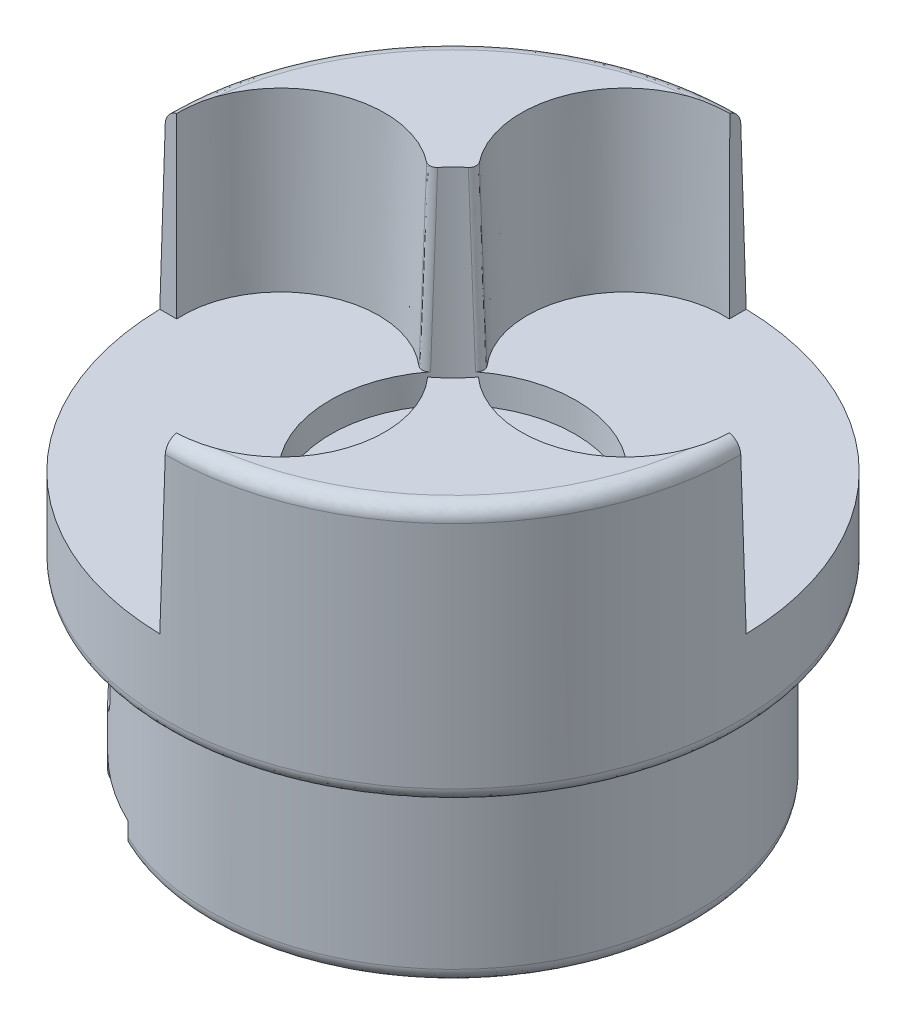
ISO-10303-21;
HEADER;
FILE_DESCRIPTION(('STEP AP214'),'2;1');
FILE_NAME('part.step','',(''),(''),'','','');
FILE_SCHEMA(('AUTOMOTIVE_DESIGN { 1 0 10303 214 1 1 1 1 }'));
ENDSEC;
DATA;
#1=APPLICATION_CONTEXT('core data for automotive mechanical design processes');
#2=APPLICATION_PROTOCOL_DEFINITION('international standard','automotive_design',2000,#1);
#3=PRODUCT_CONTEXT('',#1,'mechanical');
#4=PRODUCT('Part','Part','',(#3));
#5=PRODUCT_RELATED_PRODUCT_CATEGORY('part','',(#4));
#6=PRODUCT_DEFINITION_FORMATION('','',#4);
#7=PRODUCT_DEFINITION_CONTEXT('part definition',#1,'design');
#8=PRODUCT_DEFINITION('design','',#6,#7);
#9=PRODUCT_DEFINITION_SHAPE('','',#8);
#10=(LENGTH_UNIT() NAMED_UNIT(*) SI_UNIT(.MILLI.,.METRE.));
#11=(NAMED_UNIT(*) PLANE_ANGLE_UNIT() SI_UNIT($,.RADIAN.));
#12=(NAMED_UNIT(*) SI_UNIT($,.STERADIAN.) SOLID_ANGLE_UNIT());
#13=UNCERTAINTY_MEASURE_WITH_UNIT(LENGTH_MEASURE(1.E-05),#10,'distance_accuracy_value','');
#14=(GEOMETRIC_REPRESENTATION_CONTEXT(3) GLOBAL_UNCERTAINTY_ASSIGNED_CONTEXT((#13)) GLOBAL_UNIT_ASSIGNED_CONTEXT((#10,
#11,#12)) REPRESENTATION_CONTEXT('',''));
#15=CARTESIAN_POINT('',(0.,0.,0.));
#16=DIRECTION('',(0.,0.,1.));
#17=DIRECTION('',(1.,0.,0.));
#18=AXIS2_PLACEMENT_3D('',#15,#16,#17);
#19=CARTESIAN_POINT('',(0.0010989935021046,30.968528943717,-19.999969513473));
#20=DIRECTION('',(-0.999390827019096,-0.0348994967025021,0.));
#21=DIRECTION('',(0.0348994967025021,-0.999390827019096,0.));
#22=AXIS2_PLACEMENT_3D('',#19,#20,#21);
#23=PLANE('',#22);
#24=CARTESIAN_POINT('',(0.,30.9999999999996,0.));
#25=DIRECTION('',(-0.999390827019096,-0.0348994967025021,0.));
#26=DIRECTION('',(-0.0348994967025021,0.999390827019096,0.));
#27=AXIS2_PLACEMENT_3D('',#24,#25,#26);
#28=ELLIPSE('',#27,573.074166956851,19.9999999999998);
#29=CARTESIAN_POINT('',(0.41904923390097,19.,-19.9956094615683));
#30=VERTEX_POINT('',#29);
#31=CARTESIAN_POINT('',(0.0349207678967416,30.0000000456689,-19.9999695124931));
#32=VERTEX_POINT('',#31);
#33=EDGE_CURVE('E65',#30,#32,#28,.F.);
#34=ORIENTED_EDGE('',*,*,#33,.T.);
#35=CARTESIAN_POINT('',(0.00131673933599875,30.9622935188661,-19.2720131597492));
#36=CARTESIAN_POINT('',(0.00156077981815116,30.9553051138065,-19.2967352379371));
#37=CARTESIAN_POINT('',(0.00183789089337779,30.94736969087,-19.3211690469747));
#38=CARTESIAN_POINT('',(0.00221149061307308,30.936671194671,-19.3502502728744));
#39=CARTESIAN_POINT('',(0.00227697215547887,30.9347960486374,-19.3552246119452));
#40=CARTESIAN_POINT('',(0.00249583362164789,30.9285286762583,-19.3714571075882));
#41=CARTESIAN_POINT('',(0.00265497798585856,30.9239713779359,-19.3826522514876));
#42=CARTESIAN_POINT('',(0.00289147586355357,30.9171989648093,-19.3984621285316));
#43=CARTESIAN_POINT('',(0.00296307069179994,30.915148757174,-19.4031485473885));
#44=CARTESIAN_POINT('',(0.00321332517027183,30.9079824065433,-19.4191931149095));
#45=CARTESIAN_POINT('',(0.00339816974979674,30.9026891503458,-19.430473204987));
#46=CARTESIAN_POINT('',(0.00366335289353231,30.8950952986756,-19.4458997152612));
#47=CARTESIAN_POINT('',(0.0037374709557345,30.8929728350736,-19.4501351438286));
#48=CARTESIAN_POINT('',(0.00396740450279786,30.8863883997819,-19.4630446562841));
#49=CARTESIAN_POINT('',(0.00412661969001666,30.8818290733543,-19.4716695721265));
#50=CARTESIAN_POINT('',(0.00436251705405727,30.8750738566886,-19.4840081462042));
#51=CARTESIAN_POINT('',(0.00443569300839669,30.8729783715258,-19.4877775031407));
#52=CARTESIAN_POINT('',(0.00481256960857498,30.8621860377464,-19.506898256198));
#53=CARTESIAN_POINT('',(0.00512969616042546,30.8531047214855,-19.522037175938));
#54=CARTESIAN_POINT('',(0.00552623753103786,30.8417492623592,-19.5398792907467));
#55=CARTESIAN_POINT('',(0.00559252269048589,30.8398511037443,-19.542827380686));
#56=CARTESIAN_POINT('',(0.00593713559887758,30.8299826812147,-19.5579786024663));
#57=CARTESIAN_POINT('',(0.00622429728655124,30.8217594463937,-19.5700198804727));
#58=CARTESIAN_POINT('',(0.0065758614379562,30.811691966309,-19.5840910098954));
#59=CARTESIAN_POINT('',(0.00663158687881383,30.8100961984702,-19.5863022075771));
#60=CARTESIAN_POINT('',(0.00700474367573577,30.7994103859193,-19.600982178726));
#61=CARTESIAN_POINT('',(0.00733201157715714,30.7900386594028,-19.6132497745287));
#62=CARTESIAN_POINT('',(0.00770968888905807,30.7792233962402,-19.6267475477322));
#63=CARTESIAN_POINT('',(0.00775058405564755,30.7780523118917,-19.6282007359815));
#64=CARTESIAN_POINT('',(0.00807812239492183,30.7686728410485,-19.6397731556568));
#65=CARTESIAN_POINT('',(0.00837157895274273,30.7602693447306,-19.649736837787));
#66=CARTESIAN_POINT('',(0.00869748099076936,30.7509367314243,-19.6603731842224));
#67=CARTESIAN_POINT('',(0.00872334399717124,30.7501961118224,-19.6612144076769));
#68=CARTESIAN_POINT('',(0.00924115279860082,30.7353680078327,-19.6779997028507));
#69=CARTESIAN_POINT('',(0.00975096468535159,30.7207689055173,-19.6934995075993));
#70=CARTESIAN_POINT('',(0.0107074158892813,30.6933797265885,-19.7207790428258));
#71=CARTESIAN_POINT('',(0.0111484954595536,30.6807488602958,-19.7327197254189));
#72=CARTESIAN_POINT('',(0.0116256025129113,30.6670863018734,-19.7449776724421));
#73=CARTESIAN_POINT('',(0.0116511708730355,30.6663541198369,-19.7456326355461));
#74=CARTESIAN_POINT('',(0.0121042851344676,30.653378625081,-19.7572052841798));
#75=CARTESIAN_POINT('',(0.0125412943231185,30.6408643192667,-19.767825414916));
#76=CARTESIAN_POINT('',(0.0130386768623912,30.6266211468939,-19.7793220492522));
#77=CARTESIAN_POINT('',(0.0130904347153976,30.6251389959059,-19.7805114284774));
#78=CARTESIAN_POINT('',(0.0134787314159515,30.6140196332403,-19.7893823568));
#79=CARTESIAN_POINT('',(0.0138201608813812,30.6042423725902,-19.7968910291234));
#80=CARTESIAN_POINT('',(0.0142395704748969,30.5922320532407,-19.8057665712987));
#81=CARTESIAN_POINT('',(0.0143130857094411,30.590126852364,-19.8073095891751));
#82=CARTESIAN_POINT('',(0.0149160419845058,30.5728604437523,-19.8198613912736));
#83=CARTESIAN_POINT('',(0.0154562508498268,30.55739088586,-19.830455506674));
#84=CARTESIAN_POINT('',(0.0161111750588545,30.5386363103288,-19.8425394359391));
#85=CARTESIAN_POINT('',(0.0162164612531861,30.5356213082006,-19.8444592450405));
#86=CARTESIAN_POINT('',(0.0167326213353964,30.5208404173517,-19.8537599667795));
#87=CARTESIAN_POINT('',(0.0171485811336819,30.5089288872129,-19.8609131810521));
#88=CARTESIAN_POINT('',(0.0176980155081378,30.4931951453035,-19.8699211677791));
#89=CARTESIAN_POINT('',(0.0178269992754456,30.4895015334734,-19.8720047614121));
#90=CARTESIAN_POINT('',(0.0183598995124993,30.4742412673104,-19.8804856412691));
#91=CARTESIAN_POINT('',(0.018767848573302,30.4625591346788,-19.8866780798));
#92=CARTESIAN_POINT('',(0.0193285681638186,30.4465022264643,-19.8947858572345));
#93=CARTESIAN_POINT('',(0.0194777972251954,30.4422288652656,-19.8969053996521));
#94=CARTESIAN_POINT('',(0.0199262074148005,30.4293880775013,-19.9031601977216));
#95=CARTESIAN_POINT('',(0.0202269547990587,30.4207757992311,-19.9072042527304));
#96=CARTESIAN_POINT('',(0.0206913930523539,30.4074760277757,-19.9132193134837));
#97=CARTESIAN_POINT('',(0.0208537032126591,30.402828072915,-19.915278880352));
#98=CARTESIAN_POINT('',(0.0215393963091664,30.3831923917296,-19.9238010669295));
#99=CARTESIAN_POINT('',(0.0220678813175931,30.3680585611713,-19.9299335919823));
#100=CARTESIAN_POINT('',(0.0227752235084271,30.3478029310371,-19.937569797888));
#101=CARTESIAN_POINT('',(0.0229497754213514,30.3428044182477,-19.9394087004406));
#102=CARTESIAN_POINT('',(0.0235253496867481,30.3263221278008,-19.9453232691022));
#103=CARTESIAN_POINT('',(0.0239285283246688,30.3147766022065,-19.9492296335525));
#104=CARTESIAN_POINT('',(0.0245102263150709,30.2981189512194,-19.9545283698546));
#105=CARTESIAN_POINT('',(0.0246868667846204,30.2930606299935,-19.9560932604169));
#106=CARTESIAN_POINT('',(0.0252723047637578,30.2762958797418,-19.9611341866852));
#107=CARTESIAN_POINT('',(0.0256829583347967,30.2645363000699,-19.9644365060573));
#108=CARTESIAN_POINT('',(0.0262657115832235,30.2478484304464,-19.9687946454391));
#109=CARTESIAN_POINT('',(0.0264362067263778,30.2429660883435,-19.9700303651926));
#110=CARTESIAN_POINT('',(0.0269219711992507,30.2290556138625,-19.9734394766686));
#111=CARTESIAN_POINT('',(0.0272380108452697,30.2200054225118,-19.9755242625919));
#112=CARTESIAN_POINT('',(0.0277134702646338,30.2063900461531,-19.9784616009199));
#113=CARTESIAN_POINT('',(0.0278721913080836,30.2018448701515,-19.9794090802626));
#114=CARTESIAN_POINT('',(0.028605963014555,30.1808323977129,-19.9836367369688));
#115=CARTESIAN_POINT('',(0.0291838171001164,30.164284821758,-19.9865344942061));
#116=CARTESIAN_POINT('',(0.0298924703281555,30.1439916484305,-19.9895635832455));
#117=CARTESIAN_POINT('',(0.0300213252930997,30.1403017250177,-19.9900932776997));
#118=CARTESIAN_POINT('',(0.0306279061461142,30.1229315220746,-19.9924877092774));
#119=CARTESIAN_POINT('',(0.0311069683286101,30.1092129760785,-19.9940900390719));
#120=CARTESIAN_POINT('',(0.0316797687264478,30.0928101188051,-19.9956623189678));
#121=CARTESIAN_POINT('',(0.0317726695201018,30.0901497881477,-19.995906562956));
#122=CARTESIAN_POINT('',(0.0323824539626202,30.0726878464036,-19.9974391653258));
#123=CARTESIAN_POINT('',(0.0329004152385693,30.0578553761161,-19.998408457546));
#124=CARTESIAN_POINT('',(0.0334649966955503,30.0416878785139,-19.9991035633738));
#125=CARTESIAN_POINT('',(0.0335112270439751,30.0403640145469,-19.9991578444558));
#126=CARTESIAN_POINT('',(0.0340116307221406,30.0260343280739,-19.9997168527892));
#127=CARTESIAN_POINT('',(0.0344660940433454,30.0130202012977,-19.9999701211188));
#128=CARTESIAN_POINT('',(0.0349207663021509,30.0000000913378,-19.9999695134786));
#129=B_SPLINE_CURVE_WITH_KNOTS('',3,(#35,#36,#37,#38,#39,#40,#41,#42,#43,#44,#45,#46,#47,#48,
#49,#50,#51,#52,#53,#54,#55,#56,#57,#58,#59,#60,#61,#62,#63,#64,#65,#66,#67,#68,#69,#70,#71,#72,
#73,#74,#75,#76,#77,#78,#79,#80,#81,#82,#83,#84,#85,#86,#87,#88,#89,#90,#91,#92,#93,#94,#95,#96,
#97,#98,#99,#100,#101,#102,#103,#104,#105,#106,#107,#108,#109,#110,#111,#112,#113,#114,#115,
#116,#117,#118,#119,#120,#121,#122,#123,#124,#125,#126,#127,#128),.UNSPECIFIED.,.F.,.F.,(4,2,2,
2,2,2,2,2,2,2,2,2,2,2,2,2,2,2,2,2,2,2,2,2,2,2,2,2,2,2,2,2,2,2,2,2,2,2,2,2,2,2,2,2,2,2,4),(0.,
0.0770181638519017,0.0929669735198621,0.129221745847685,0.144568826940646,0.18194259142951,
0.196156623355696,0.225422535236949,0.238362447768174,0.291298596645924,0.301819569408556,
0.345552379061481,0.353734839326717,0.400034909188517,0.405635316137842,0.444733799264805,
0.448097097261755,0.511941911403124,0.564078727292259,0.567026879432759,0.616255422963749,
0.621958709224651,0.658944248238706,0.666777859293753,0.723008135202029,0.733735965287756,
0.775421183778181,0.78814941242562,0.827820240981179,0.842137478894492,0.870690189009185,
0.88594931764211,0.934936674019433,0.950923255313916,0.987498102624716,1.00339127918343,
1.04004487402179,1.05516218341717,1.08303525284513,1.09697200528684,1.14737115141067,
1.15856120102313,1.20000504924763,1.20802454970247,1.2526232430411,1.25660058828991,
1.29567174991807),.UNSPECIFIED.);
#130=CARTESIAN_POINT('',(0.00140289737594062,30.9618504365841,-19.271887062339));
#131=VERTEX_POINT('',#130);
#132=EDGE_CURVE('E422',#131,#32,#129,.T.);
#133=ORIENTED_EDGE('',*,*,#132,.F.);
#134=CARTESIAN_POINT('',(0.41904923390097,19.,-18.8180852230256));
#135=CARTESIAN_POINT('',(0.394854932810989,19.6928341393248,-18.843812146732));
#136=CARTESIAN_POINT('',(0.370660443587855,20.3856736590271,-18.8693937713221));
#137=CARTESIAN_POINT('',(0.322271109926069,21.7713628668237,-18.920275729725));
#138=CARTESIAN_POINT('',(0.298076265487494,22.4642125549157,-18.945576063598));
#139=CARTESIAN_POINT('',(0.228452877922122,24.4579655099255,-19.0179887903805));
#140=CARTESIAN_POINT('',(0.183023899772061,25.7588812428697,-19.0647577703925));
#141=CARTESIAN_POINT('',(0.0921648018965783,28.3607453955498,-19.1573914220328));
#142=CARTESIAN_POINT('',(0.0467346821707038,29.6616938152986,-19.2032560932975));
#143=CARTESIAN_POINT('',(0.00130404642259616,30.9626569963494,-19.2486958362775));
#144=B_SPLINE_CURVE_WITH_KNOTS('',3,(#134,#135,#136,#137,#138,#139,#140,#141,#142,#143),
.UNSPECIFIED.,.F.,.F.,(4,2,2,2,4),(0.,2.0812009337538,4.16240142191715,8.07004690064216,
11.9776939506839),.UNSPECIFIED.);
#145=CARTESIAN_POINT('',(0.41904923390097,19.,-18.8180852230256));
#146=VERTEX_POINT('',#145);
#147=EDGE_CURVE('E177',#146,#131,#144,.T.);
#148=ORIENTED_EDGE('',*,*,#147,.F.);
#149=DIRECTION('',(0.,0.,1.));
#150=VECTOR('',#149,1.);
#151=CARTESIAN_POINT('',(0.41904923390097,19.,-14.012057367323));
#152=LINE('',#151,#150);
#153=EDGE_CURVE('E731',#30,#146,#152,.T.);
#154=ORIENTED_EDGE('',*,*,#153,.F.);
#155=EDGE_LOOP('',(#34,#133,#148,#154));
#156=FACE_BOUND('',#155,.T.);
#157=ADVANCED_FACE('F16',(#156),#23,.F.);
#158=CARTESIAN_POINT('',(14.562305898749,30.,10.580134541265));
#159=CARTESIAN_POINT('',(14.562305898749,31.,10.580134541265));
#160=CARTESIAN_POINT('',(15.371322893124,31.,11.167919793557));
#161=CARTESIAN_POINT('',(16.180339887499,31.,11.755705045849));
#162=CARTESIAN_POINT('',(16.180339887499,30.,11.755705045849));
#163=(BOUNDED_CURVE() B_SPLINE_CURVE(2,(#158,#159,#160,#161,#162),.UNSPECIFIED.,.F.,
.F.) B_SPLINE_CURVE_WITH_KNOTS((3,2,3),(0.5,0.75,1.),
.UNSPECIFIED.) CURVE() GEOMETRIC_REPRESENTATION_ITEM() RATIONAL_B_SPLINE_CURVE((1.,
0.70710678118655,1.,0.70710678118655,1.)) REPRESENTATION_ITEM(''));
#164=CARTESIAN_POINT('',(0.,29.,0.));
#165=DIRECTION('',(0.,1.,0.));
#166=AXIS1_PLACEMENT('',#164,#165);
#167=SURFACE_OF_REVOLUTION('',#163,#166);
#168=CARTESIAN_POINT('',(0.00139828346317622,30.9685289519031,-19.2489008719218));
#169=CARTESIAN_POINT('',(-0.11803005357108,30.9685135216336,-19.2489241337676));
#170=CARTESIAN_POINT('',(-0.23743845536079,30.9689944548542,-19.2460114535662));
#171=CARTESIAN_POINT('',(-0.409274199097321,30.9703099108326,-19.2375916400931));
#172=CARTESIAN_POINT('',(-0.461822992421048,30.9707963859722,-19.2344456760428));
#173=CARTESIAN_POINT('',(-0.578493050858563,30.972051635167,-19.226190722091));
#174=CARTESIAN_POINT('',(-0.642594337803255,30.9728590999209,-19.2208010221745));
#175=CARTESIAN_POINT('',(-0.770606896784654,30.9746728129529,-19.2083268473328));
#176=CARTESIAN_POINT('',(-0.834518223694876,30.9756789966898,-19.2012429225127));
#177=CARTESIAN_POINT('',(-0.976268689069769,30.9780864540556,-19.1836253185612));
#178=CARTESIAN_POINT('',(-1.05405598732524,30.9795258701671,-19.1726750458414));
#179=CARTESIAN_POINT('',(-1.18586440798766,30.9820813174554,-19.1519344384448));
#180=CARTESIAN_POINT('',(-1.23998870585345,30.983164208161,-19.1427877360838));
#181=CARTESIAN_POINT('',(-1.35997398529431,30.9855946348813,-19.1211074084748));
#182=CARTESIAN_POINT('',(-1.42578075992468,30.9869476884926,-19.108272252));
#183=CARTESIAN_POINT('',(-1.55695706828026,30.9896022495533,-19.080791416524));
#184=CARTESIAN_POINT('',(-1.62232692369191,30.9909037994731,-19.0661472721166));
#185=CARTESIAN_POINT('',(-1.76702350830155,30.9936334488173,-19.0316136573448));
#186=CARTESIAN_POINT('',(-1.84624560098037,30.9950260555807,-19.0112799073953));
#187=CARTESIAN_POINT('',(-1.97855077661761,30.9970191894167,-18.9749122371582));
#188=CARTESIAN_POINT('',(-2.03183291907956,30.9977303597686,-18.9596033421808));
#189=CARTESIAN_POINT('',(-2.18069204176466,30.999362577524,-18.9149659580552));
#190=CARTESIAN_POINT('',(-2.2758587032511,30.9999932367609,-18.8842550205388));
#191=CARTESIAN_POINT('',(-2.37035678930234,31.,-18.8515624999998));
#192=B_SPLINE_CURVE_WITH_KNOTS('',3,(#168,#169,#170,#171,#172,#173,#174,#175,#176,#177,#178,
#179,#180,#181,#182,#183,#184,#185,#186,#187,#188,#189,#190,#191),.UNSPECIFIED.,.F.,.F.,(4,2,2,
2,2,2,2,2,2,2,2,4),(0.,0.358203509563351,0.516127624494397,0.7091008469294,0.902011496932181,
1.1376681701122,1.30236321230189,1.5035169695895,1.70450124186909,1.94985422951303,
2.11616769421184,2.41609336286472),.UNSPECIFIED.);
#193=CARTESIAN_POINT('',(-2.37035678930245,31.0000000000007,-18.8515625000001));
#194=VERTEX_POINT('',#193);
#195=EDGE_CURVE('E511',#131,#194,#192,.T.);
#196=ORIENTED_EDGE('',*,*,#195,.F.);
#197=ORIENTED_EDGE('',*,*,#132,.T.);
#198=CARTESIAN_POINT('',(0.,30.,0.));
#199=DIRECTION('',(0.,1.,0.));
#200=DIRECTION('',(0.,0.,1.));
#201=AXIS2_PLACEMENT_3D('',#198,#199,#200);
#202=CIRCLE('',#201,19.9999999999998);
#203=CARTESIAN_POINT('',(-19.999969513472,29.9999999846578,0.0349207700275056));
#204=VERTEX_POINT('',#203);
#205=EDGE_CURVE('E1135',#32,#204,#202,.T.);
#206=ORIENTED_EDGE('',*,*,#205,.T.);
#207=CARTESIAN_POINT('',(-19.9999695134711,29.9999999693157,0.0349207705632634));
#208=CARTESIAN_POINT('',(-19.9999702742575,30.0195631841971,0.0342376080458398));
#209=CARTESIAN_POINT('',(-19.9993979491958,30.03911143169,0.0335549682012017));
#210=CARTESIAN_POINT('',(-19.9981411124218,30.0605329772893,0.0328069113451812));
#211=CARTESIAN_POINT('',(-19.9980239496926,30.0624366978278,0.0327404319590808));
#212=CARTESIAN_POINT('',(-19.9969743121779,30.0787309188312,0.0321714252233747));
#213=CARTESIAN_POINT('',(-19.9957357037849,30.0931041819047,0.0316694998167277));
#214=CARTESIAN_POINT('',(-19.9938503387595,30.1105594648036,0.0310599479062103));
#215=CARTESIAN_POINT('',(-19.9934988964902,30.113675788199,0.0309511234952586));
#216=CARTESIAN_POINT('',(-19.9915598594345,30.1301721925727,0.0303750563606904));
#217=CARTESIAN_POINT('',(-19.989716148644,30.1435241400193,0.0299087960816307));
#218=CARTESIAN_POINT('',(-19.9869642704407,30.1608594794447,0.0293034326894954));
#219=CARTESIAN_POINT('',(-19.9863002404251,30.1648833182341,0.0291629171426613));
#220=CARTESIAN_POINT('',(-19.983971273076,30.1784779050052,0.0286881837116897));
#221=CARTESIAN_POINT('',(-19.9821912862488,30.1880295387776,0.0283546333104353));
#222=CARTESIAN_POINT('',(-19.9793550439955,30.2021070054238,0.0278630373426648));
#223=CARTESIAN_POINT('',(-19.9784057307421,30.2066548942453,0.0277042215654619));
#224=CARTESIAN_POINT('',(-19.973993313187,30.2270804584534,0.0269909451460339));
#225=CARTESIAN_POINT('',(-19.9701738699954,30.2428842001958,0.0264390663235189));
#226=CARTESIAN_POINT('',(-19.9646355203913,30.2635775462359,0.0257164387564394));
#227=CARTESIAN_POINT('',(-19.9632599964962,30.268561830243,0.025542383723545));
#228=CARTESIAN_POINT('',(-19.9585115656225,30.2852617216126,0.0249592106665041));
#229=CARTESIAN_POINT('',(-19.9549624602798,30.2969283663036,0.0245518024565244));
#230=CARTESIAN_POINT('',(-19.9495560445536,30.3135991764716,0.0239696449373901));
#231=CARTESIAN_POINT('',(-19.9478699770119,30.3186598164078,0.0237929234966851));
#232=CARTESIAN_POINT('',(-19.9421805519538,30.3352912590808,0.0232121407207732));
#233=CARTESIAN_POINT('',(-19.9380044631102,30.3468040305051,0.0228101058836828));
#234=CARTESIAN_POINT('',(-19.9317284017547,30.363162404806,0.0222388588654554));
#235=CARTESIAN_POINT('',(-19.9297991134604,30.3680743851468,0.0220673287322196));
#236=CARTESIAN_POINT('',(-19.924380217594,30.3815562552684,0.0215965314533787));
#237=CARTESIAN_POINT('',(-19.92081006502,30.3900941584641,0.0212983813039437));
#238=CARTESIAN_POINT('',(-19.9150970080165,30.4032410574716,0.020839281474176));
#239=CARTESIAN_POINT('',(-19.9130362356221,30.4078861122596,0.0206770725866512));
#240=CARTESIAN_POINT('',(-19.9040191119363,30.4277999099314,0.0199816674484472));
#241=CARTESIAN_POINT('',(-19.8967118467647,30.4429133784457,0.0194538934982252));
#242=CARTESIAN_POINT('',(-19.8869390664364,30.4618920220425,0.0187911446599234));
#243=CARTESIAN_POINT('',(-19.8848198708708,30.4659390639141,0.0186498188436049));
#244=CARTESIAN_POINT('',(-19.8763359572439,30.4818740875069,0.0180933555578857));
#245=CARTESIAN_POINT('',(-19.8697572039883,30.4936501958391,0.0176821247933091));
#246=CARTESIAN_POINT('',(-19.8609328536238,30.5087216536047,0.0171558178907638));
#247=CARTESIAN_POINT('',(-19.8589013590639,30.5121442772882,0.0170362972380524));
#248=CARTESIAN_POINT('',(-19.8495311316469,30.5277183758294,0.0164924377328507));
#249=CARTESIAN_POINT('',(-19.8419524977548,30.5397281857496,0.0160730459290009));
#250=CARTESIAN_POINT('',(-19.8323223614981,30.5542923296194,0.0155644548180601));
#251=CARTESIAN_POINT('',(-19.8305086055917,30.5570063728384,0.0154696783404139));
#252=CARTESIAN_POINT('',(-19.8221435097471,30.5693918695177,0.0150371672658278));
#253=CARTESIAN_POINT('',(-19.8154349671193,30.5789588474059,0.0147030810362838));
#254=CARTESIAN_POINT('',(-19.8070297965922,30.5905094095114,0.0142997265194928));
#255=CARTESIAN_POINT('',(-19.8054897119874,30.5926085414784,0.014226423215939));
#256=CARTESIAN_POINT('',(-19.7922136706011,30.6105562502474,0.0135996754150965));
#257=CARTESIAN_POINT('',(-19.7800120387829,30.6260697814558,0.0130579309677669));
#258=CARTESIAN_POINT('',(-19.7663883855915,30.6423746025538,0.0124885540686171));
#259=CARTESIAN_POINT('',(-19.7654070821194,30.6435435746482,0.0124477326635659));
#260=CARTESIAN_POINT('',(-19.7535990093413,30.6575446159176,0.0119588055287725));
#261=CARTESIAN_POINT('',(-19.7424482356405,30.6701100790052,0.0115200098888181));
#262=CARTESIAN_POINT('',(-19.7305862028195,30.6828174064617,0.0110762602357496));
#263=CARTESIAN_POINT('',(-19.7301807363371,30.6832509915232,0.0110611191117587));
#264=CARTESIAN_POINT('',(-19.7178938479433,30.6963665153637,0.0106031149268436));
#265=CARTESIAN_POINT('',(-19.7056848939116,30.7087358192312,0.0101711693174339));
#266=CARTESIAN_POINT('',(-19.6931511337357,30.7207899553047,0.00975022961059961));
#267=B_SPLINE_CURVE_WITH_KNOTS('',3,(#207,#208,#209,#210,#211,#212,#213,#214,#215,#216,#217,
#218,#219,#220,#221,#222,#223,#224,#225,#226,#227,#228,#229,#230,#231,#232,#233,#234,#235,#236,
#237,#238,#239,#240,#241,#242,#243,#244,#245,#246,#247,#248,#249,#250,#251,#252,#253,#254,#255,
#256,#257,#258,#259,#260,#261,#262,#263,#264,#265,#266),.UNSPECIFIED.,.F.,.F.,(4,2,2,2,2,2,2,2,
2,2,2,2,2,2,2,2,2,2,2,2,2,2,2,2,2,2,2,2,2,4),(0.,0.0586898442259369,0.0644152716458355,
0.107702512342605,0.117116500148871,0.157561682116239,0.169803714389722,0.198963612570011,
0.212909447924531,0.261688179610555,0.27720869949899,0.313802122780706,0.329813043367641,
0.366562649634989,0.382402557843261,0.410175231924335,0.425427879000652,0.475786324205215,
0.489497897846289,0.529969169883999,0.541914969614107,0.584519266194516,0.594316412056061,
0.62937466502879,0.637188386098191,0.696372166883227,0.700952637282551,0.751337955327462,
0.753119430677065,0.805271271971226),.UNSPECIFIED.);
#268=CARTESIAN_POINT('',(-19.6931511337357,30.7207899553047,0.00975022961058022));
#269=VERTEX_POINT('',#268);
#270=EDGE_CURVE('E587',#204,#269,#267,.T.);
#271=ORIENTED_EDGE('',*,*,#270,.T.);
#272=DIRECTION('',(-0.720955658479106,-0.692559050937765,0.0241846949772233));
#273=VECTOR('',#272,1.);
#274=CARTESIAN_POINT('',(-19.6923794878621,30.7215303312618,0.00972437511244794));
#275=LINE('',#274,#273);
#276=CARTESIAN_POINT('',(-19.6923794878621,30.7215303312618,0.00972437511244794));
#277=VERTEX_POINT('',#276);
#278=EDGE_CURVE('E591',#269,#277,#275,.F.);
#279=ORIENTED_EDGE('',*,*,#278,.T.);
#280=CARTESIAN_POINT('',(-19.6923800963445,30.7215306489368,0.00972436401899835));
#281=CARTESIAN_POINT('',(-19.6823733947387,30.7311327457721,0.00938905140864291));
#282=CARTESIAN_POINT('',(-19.6721740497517,30.7405210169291,0.00906120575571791));
#283=CARTESIAN_POINT('',(-19.6609366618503,30.7504408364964,0.00871479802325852));
#284=CARTESIAN_POINT('',(-19.6600904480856,30.7511852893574,0.00868880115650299));
#285=CARTESIAN_POINT('',(-19.6442010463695,30.7651162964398,0.00820231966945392));
#286=CARTESIAN_POINT('',(-19.628756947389,30.7778578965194,0.00775737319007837));
#287=CARTESIAN_POINT('',(-19.6111901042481,30.7914859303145,0.00728147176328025));
#288=CARTESIAN_POINT('',(-19.6094252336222,30.792845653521,0.00723398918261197));
#289=CARTESIAN_POINT('',(-19.595694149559,30.8033516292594,0.00686711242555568));
#290=CARTESIAN_POINT('',(-19.5835229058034,30.8122355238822,0.00655687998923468));
#291=CARTESIAN_POINT('',(-19.5686493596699,30.8225850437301,0.0061954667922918));
#292=CARTESIAN_POINT('',(-19.5661311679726,30.824320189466,0.00613487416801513));
#293=CARTESIAN_POINT('',(-19.5518527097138,30.8340623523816,0.00579467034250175));
#294=CARTESIAN_POINT('',(-19.5399270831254,30.841831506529,0.00552336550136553));
#295=CARTESIAN_POINT('',(-19.5246179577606,30.8513458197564,0.00519111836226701));
#296=CARTESIAN_POINT('',(-19.5213816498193,30.8533316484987,0.00512177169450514));
#297=CARTESIAN_POINT('',(-19.509285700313,30.8606593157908,0.00486588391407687));
#298=CARTESIAN_POINT('',(-19.5003533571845,30.8658827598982,0.0046834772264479));
#299=CARTESIAN_POINT('',(-19.4875850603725,30.8730858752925,0.00443193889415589));
#300=CARTESIAN_POINT('',(-19.4838137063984,30.8751813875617,0.0043587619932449));
#301=CARTESIAN_POINT('',(-19.4653838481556,30.8852661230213,0.00400659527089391));
#302=CARTESIAN_POINT('',(-19.4505349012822,30.8929146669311,0.00373950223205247));
#303=CARTESIAN_POINT('',(-19.4310853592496,30.9023243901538,0.00341090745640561));
#304=CARTESIAN_POINT('',(-19.4266484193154,30.9044307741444,0.00333735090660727));
#305=CARTESIAN_POINT('',(-19.411067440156,30.911687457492,0.003083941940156));
#306=CARTESIAN_POINT('',(-19.3998421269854,30.9166661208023,0.00291008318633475));
#307=CARTESIAN_POINT('',(-19.3837202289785,30.9234640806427,0.00267269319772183));
#308=CARTESIAN_POINT('',(-19.3788947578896,30.9254544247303,0.00260318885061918));
#309=CARTESIAN_POINT('',(-19.3629583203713,30.9318821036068,0.00237872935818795));
#310=CARTESIAN_POINT('',(-19.3517814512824,30.9361585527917,0.00222939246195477));
#311=CARTESIAN_POINT('',(-19.3355083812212,30.9420523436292,0.00202357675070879));
#312=CARTESIAN_POINT('',(-19.3304700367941,30.9438315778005,0.0019614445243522));
#313=CARTESIAN_POINT('',(-19.3171763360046,30.9484065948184,0.00180168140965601));
#314=CARTESIAN_POINT('',(-19.3088976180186,30.951135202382,0.0017063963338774));
#315=CARTESIAN_POINT('',(-19.2955376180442,30.9553457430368,0.00155936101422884));
#316=CARTESIAN_POINT('',(-19.2904778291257,30.9568963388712,0.00150521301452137));
#317=CARTESIAN_POINT('',(-19.2710082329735,30.9626942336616,0.00130274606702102));
#318=CARTESIAN_POINT('',(-19.2565135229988,30.966657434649,0.00116434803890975));
#319=CARTESIAN_POINT('',(-19.2419338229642,30.9702927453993,0.00103740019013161));
#320=B_SPLINE_CURVE_WITH_KNOTS('',3,(#280,#281,#282,#283,#284,#285,#286,#287,#288,#289,#290,
#291,#292,#293,#294,#295,#296,#297,#298,#299,#300,#301,#302,#303,#304,#305,#306,#307,#308,#309,
#310,#311,#312,#313,#314,#315,#316,#317,#318,#319),.UNSPECIFIED.,.F.,.F.,(4,2,2,2,2,2,2,2,2,2,2,
2,2,2,2,2,2,2,2,4),(0.,0.0415988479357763,0.0449809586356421,0.105009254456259,0.11169464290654,
0.156888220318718,0.166064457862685,0.208753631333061,0.220146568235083,0.251187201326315,
0.264132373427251,0.31421985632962,0.328956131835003,0.36578847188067,0.381449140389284,
0.417343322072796,0.433373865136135,0.459522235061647,0.475398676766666,0.52046842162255),.UNSPECIFIED.);
#321=CARTESIAN_POINT('',(-19.2489009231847,30.9685289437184,0.00109899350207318));
#322=VERTEX_POINT('',#321);
#323=EDGE_CURVE('E41',#277,#322,#320,.T.);
#324=ORIENTED_EDGE('',*,*,#323,.T.);
#325=CARTESIAN_POINT('',(-19.248900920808,30.9685289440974,0.00111467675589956));
#326=CARTESIAN_POINT('',(-19.2489161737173,30.9685180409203,-0.0930881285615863));
#327=CARTESIAN_POINT('',(-19.2471036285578,30.9688158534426,-0.187292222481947));
#328=CARTESIAN_POINT('',(-19.24008704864,30.96992440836,-0.368871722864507));
#329=CARTESIAN_POINT('',(-19.2351329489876,30.9706972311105,-0.456257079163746));
#330=CARTESIAN_POINT('',(-19.2232681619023,30.9724900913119,-0.614891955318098));
#331=CARTESIAN_POINT('',(-19.2168781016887,30.9734394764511,-0.686181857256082));
#332=CARTESIAN_POINT('',(-19.1995367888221,30.9759248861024,-0.852085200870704));
#333=CARTESIAN_POINT('',(-19.187775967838,30.977551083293,-0.946614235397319));
#334=CARTESIAN_POINT('',(-19.1630340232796,30.9807373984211,-1.11792325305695));
#335=CARTESIAN_POINT('',(-19.1506673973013,30.9822554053,-1.1947937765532));
#336=CARTESIAN_POINT('',(-19.1234810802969,30.9853474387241,-1.34801527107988));
#337=CARTESIAN_POINT('',(-19.1086640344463,30.9869214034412,-1.42436671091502));
#338=CARTESIAN_POINT('',(-19.0795110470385,30.9897151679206,-1.56264353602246));
#339=CARTESIAN_POINT('',(-19.0655821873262,30.9909471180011,-1.62465491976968));
#340=CARTESIAN_POINT('',(-19.036324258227,30.9932624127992,-1.74732444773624));
#341=CARTESIAN_POINT('',(-19.0210205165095,30.9943477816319,-1.80798858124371));
#342=CARTESIAN_POINT('',(-18.9917839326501,30.9961280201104,-1.91783983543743));
#343=CARTESIAN_POINT('',(-18.9781125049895,30.9968580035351,-1.96709622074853));
#344=CARTESIAN_POINT('',(-18.9295278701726,30.9990239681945,-2.13517868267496));
#345=CARTESIAN_POINT('',(-18.8920672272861,30.9999867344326,-2.25327795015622));
#346=CARTESIAN_POINT('',(-18.8515624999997,31.,-2.3703567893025));
#347=B_SPLINE_CURVE_WITH_KNOTS('',3,(#325,#326,#327,#328,#329,#330,#331,#332,#333,#334,#335,
#336,#337,#338,#339,#340,#341,#342,#343,#344,#345,#346),.UNSPECIFIED.,.F.,.F.,(4,2,2,2,2,2,2,2,
2,2,4),(0.,0.282591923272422,0.545119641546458,0.759837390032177,1.04557185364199,
1.27915544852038,1.51248852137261,1.70317286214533,1.89087269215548,2.04423312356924,
2.41579025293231),.UNSPECIFIED.);
#348=CARTESIAN_POINT('',(-18.8515624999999,31.,-2.37035678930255));
#349=VERTEX_POINT('',#348);
#350=EDGE_CURVE('E592',#322,#349,#347,.T.);
#351=ORIENTED_EDGE('',*,*,#350,.T.);
#352=CARTESIAN_POINT('',(0.,31.,0.));
#353=DIRECTION('',(0.,-1.,0.));
#354=DIRECTION('',(-0.992187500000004,0.,-0.12475562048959));
#355=AXIS2_PLACEMENT_3D('',#352,#353,#354);
#356=CIRCLE('',#355,19.);
#357=EDGE_CURVE('E74',#194,#349,#356,.F.);
#358=ORIENTED_EDGE('',*,*,#357,.F.);
#359=EDGE_LOOP('',(#196,#197,#206,#271,#279,#324,#351,#358));
#360=FACE_BOUND('',#359,.T.);
#361=ADVANCED_FACE('F534',(#360),#167,.F.);
#362=CARTESIAN_POINT('',(16.180339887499,14.,11.755705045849));
#363=CARTESIAN_POINT('',(16.180339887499,13.,11.755705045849));
#364=CARTESIAN_POINT('',(15.371322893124,13.,11.167919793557));
#365=CARTESIAN_POINT('',(14.562305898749,13.,10.580134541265));
#366=CARTESIAN_POINT('',(14.562305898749,14.,10.580134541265));
#367=(BOUNDED_CURVE() B_SPLINE_CURVE(2,(#362,#363,#364,#365,#366),.UNSPECIFIED.,.F.,
.F.) B_SPLINE_CURVE_WITH_KNOTS((3,2,3),(0.,0.25,0.5),
.UNSPECIFIED.) CURVE() GEOMETRIC_REPRESENTATION_ITEM() RATIONAL_B_SPLINE_CURVE((1.,
0.70710678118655,1.,0.70710678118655,1.)) REPRESENTATION_ITEM(''));
#368=CARTESIAN_POINT('',(0.,13.,0.));
#369=DIRECTION('',(0.,1.,0.));
#370=AXIS1_PLACEMENT('',#368,#369);
#371=SURFACE_OF_REVOLUTION('',#367,#370);
#372=CARTESIAN_POINT('',(0.,13.,0.));
#373=DIRECTION('',(0.,1.,0.));
#374=DIRECTION('',(0.809016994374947,0.,0.587785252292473));
#375=AXIS2_PLACEMENT_3D('',#372,#373,#374);
#376=CIRCLE('',#375,19.);
#377=CARTESIAN_POINT('',(15.371322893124,13.,11.167919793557));
#378=VERTEX_POINT('',#377);
#379=EDGE_CURVE('E167',#378,#378,#376,.F.);
#380=ORIENTED_EDGE('',*,*,#379,.F.);
#381=EDGE_LOOP('',(#380));
#382=FACE_BOUND('',#381,.T.);
#383=CARTESIAN_POINT('',(0.,14.,0.));
#384=DIRECTION('',(0.,1.,0.));
#385=DIRECTION('',(0.,0.,1.));
#386=AXIS2_PLACEMENT_3D('',#383,#384,#385);
#387=CIRCLE('',#386,19.9999999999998);
#388=CARTESIAN_POINT('',(0.,14.,19.9999999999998));
#389=VERTEX_POINT('',#388);
#390=EDGE_CURVE('E610',#389,#389,#387,.F.);
#391=ORIENTED_EDGE('',*,*,#390,.T.);
#392=EDGE_LOOP('',(#391));
#393=FACE_BOUND('',#392,.T.);
#394=ADVANCED_FACE('F538',(#382,#393),#371,.F.);
#395=CARTESIAN_POINT('',(-18.818085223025,30.968528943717,0.0010989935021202));
#396=DIRECTION('',(0.,-0.0348994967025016,-0.999390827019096));
#397=DIRECTION('',(0.,-0.999390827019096,0.0348994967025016));
#398=AXIS2_PLACEMENT_3D('',#395,#396,#397);
#399=PLANE('',#398);
#400=CARTESIAN_POINT('',(-19.2489652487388,30.9703823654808,0.00103467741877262));
#401=CARTESIAN_POINT('',(-19.2251747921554,30.2892061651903,0.0248216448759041));
#402=CARTESIAN_POINT('',(-19.2012674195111,29.6080340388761,0.0486085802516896));
#403=CARTESIAN_POINT('',(-19.1388240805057,27.8378296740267,0.110425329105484));
#404=CARTESIAN_POINT('',(-19.1001004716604,26.7488040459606,0.14845500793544));
#405=CARTESIAN_POINT('',(-19.0220072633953,24.5707887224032,0.224513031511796));
#406=CARTESIAN_POINT('',(-18.9826376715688,23.4817990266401,0.262541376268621));
#407=CARTESIAN_POINT('',(-18.9016870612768,21.2618674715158,0.340063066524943));
#408=CARTESIAN_POINT('',(-18.8600792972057,20.1309265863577,0.379556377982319));
#409=CARTESIAN_POINT('',(-18.8180852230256,19.,0.41904923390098));
#410=B_SPLINE_CURVE_WITH_KNOTS('',3,(#400,#401,#402,#403,#404,#405,#406,#407,#408,#409),
.UNSPECIFIED.,.F.,.F.,(4,2,2,2,4),(0.,2.04601940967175,5.31715103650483,8.58824423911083,
11.9854287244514),.UNSPECIFIED.);
#411=CARTESIAN_POINT('',(-18.8180852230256,19.,0.41904923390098));
#412=VERTEX_POINT('',#411);
#413=EDGE_CURVE('E602',#322,#412,#410,.T.);
#414=ORIENTED_EDGE('',*,*,#413,.F.);
#415=ORIENTED_EDGE('',*,*,#323,.F.);
#416=ORIENTED_EDGE('',*,*,#278,.F.);
#417=ORIENTED_EDGE('',*,*,#270,.F.);
#418=CARTESIAN_POINT('',(0.,31.0000000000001,0.));
#419=DIRECTION('',(0.,-0.0348994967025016,-0.999390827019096));
#420=DIRECTION('',(0.,0.999390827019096,-0.0348994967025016));
#421=AXIS2_PLACEMENT_3D('',#418,#419,#420);
#422=ELLIPSE('',#421,573.07416695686,19.9999999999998);
#423=CARTESIAN_POINT('',(-19.9956094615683,19.,0.41904923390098));
#424=VERTEX_POINT('',#423);
#425=EDGE_CURVE('E1132',#204,#424,#422,.F.);
#426=ORIENTED_EDGE('',*,*,#425,.T.);
#427=DIRECTION('',(-1.,0.,0.));
#428=VECTOR('',#427,1.);
#429=CARTESIAN_POINT('',(-24.805997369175,19.,0.41904923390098));
#430=LINE('',#429,#428);
#431=EDGE_CURVE('E715',#412,#424,#430,.T.);
#432=ORIENTED_EDGE('',*,*,#431,.F.);
#433=EDGE_LOOP('',(#414,#415,#416,#417,#426,#432));
#434=FACE_BOUND('',#433,.T.);
#435=ADVANCED_FACE('F593',(#434),#399,.F.);
#436=CARTESIAN_POINT('',(-27.3682446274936,31.,-2.75479615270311));
#437=DIRECTION('',(0.,1.,0.));
#438=DIRECTION('',(0.80901699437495,0.,0.58778525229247));
#439=AXIS2_PLACEMENT_3D('',#436,#437,#438);
#440=PLANE('',#439);
#441=CARTESIAN_POINT('',(0.,31.,0.));
#442=DIRECTION('',(0.,1.,0.));
#443=DIRECTION('',(0.,0.,1.));
#444=AXIS2_PLACEMENT_3D('',#441,#442,#443);
#445=CIRCLE('',#444,9.00000000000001);
#446=CARTESIAN_POINT('',(-6.87600074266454,31.0000000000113,-5.80694530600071));
#447=VERTEX_POINT('',#446);
#448=CARTESIAN_POINT('',(-5.80694530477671,31.0000000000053,-6.87600074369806));
#449=VERTEX_POINT('',#448);
#450=EDGE_CURVE('E700',#447,#449,#445,.F.);
#451=ORIENTED_EDGE('',*,*,#450,.T.);
#452=CARTESIAN_POINT('',(-5.80694530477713,31.0000000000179,-6.87600074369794));
#453=CARTESIAN_POINT('',(-5.79356478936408,31.0000000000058,-6.88729833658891));
#454=CARTESIAN_POINT('',(-5.78078617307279,31.0000000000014,-6.89929666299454));
#455=CARTESIAN_POINT('',(-5.75876384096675,30.9999999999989,-6.92226101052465));
#456=CARTESIAN_POINT('',(-5.74930030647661,30.9999999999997,-6.93301672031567));
#457=CARTESIAN_POINT('',(-5.73058617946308,31.0000000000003,-6.95622571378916));
#458=CARTESIAN_POINT('',(-5.7214177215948,31.,-6.96874583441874));
#459=CARTESIAN_POINT('',(-5.71174866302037,31.,-6.98332559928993));
#460=CARTESIAN_POINT('',(-5.71065214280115,31.,-6.98500081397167));
#461=CARTESIAN_POINT('',(-5.70179821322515,31.0000000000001,-6.99870662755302));
#462=CARTESIAN_POINT('',(-5.69454440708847,31.,-7.01106963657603));
#463=CARTESIAN_POINT('',(-5.67963852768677,31.,-7.03917758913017));
#464=CARTESIAN_POINT('',(-5.67225447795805,31.,-7.05506481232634));
#465=CARTESIAN_POINT('',(-5.6603788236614,31.,-7.08457929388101));
#466=CARTESIAN_POINT('',(-5.65560549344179,31.,-7.09809347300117));
#467=CARTESIAN_POINT('',(-5.64987088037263,31.,-7.11686007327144));
#468=CARTESIAN_POINT('',(-5.64840067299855,31.,-7.12196106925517));
#469=CARTESIAN_POINT('',(-5.6438252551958,31.,-7.13884308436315));
#470=CARTESIAN_POINT('',(-5.64106806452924,31.,-7.15072091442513));
#471=CARTESIAN_POINT('',(-5.63602406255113,31.,-7.17673827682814));
#472=CARTESIAN_POINT('',(-5.6339039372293,31.,-7.19090994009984));
#473=CARTESIAN_POINT('',(-5.63055493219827,31.,-7.22254394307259));
#474=CARTESIAN_POINT('',(-5.62962769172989,31.,-7.24003953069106));
#475=CARTESIAN_POINT('',(-5.6296159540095,31.,-7.26761964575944));
#476=CARTESIAN_POINT('',(-5.62991775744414,31.,-7.27770768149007));
#477=CARTESIAN_POINT('',(-5.63077865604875,31.,-7.29199728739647));
#478=CARTESIAN_POINT('',(-5.63108654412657,31.,-7.29621506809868));
#479=CARTESIAN_POINT('',(-5.63294309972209,31.,-7.31785264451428));
#480=CARTESIAN_POINT('',(-5.63535575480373,31.,-7.33521009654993));
#481=CARTESIAN_POINT('',(-5.64138300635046,31.,-7.36644705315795));
#482=CARTESIAN_POINT('',(-5.64470027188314,30.9999999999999,-7.38038641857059));
#483=CARTESIAN_POINT('',(-5.65339015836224,31.0000000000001,-7.41099219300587));
#484=CARTESIAN_POINT('',(-5.65905536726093,31.0000000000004,-7.42757827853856));
#485=CARTESIAN_POINT('',(-5.66600705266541,31.,-7.44490031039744));
#486=CARTESIAN_POINT('',(-5.66644940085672,30.9999999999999,-7.44599134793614));
#487=CARTESIAN_POINT('',(-5.67187630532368,30.9999999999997,-7.45924194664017));
#488=CARTESIAN_POINT('',(-5.67733847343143,31.0000000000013,-7.47121082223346));
#489=CARTESIAN_POINT('',(-5.69115041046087,30.9999999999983,-7.49856230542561));
#490=CARTESIAN_POINT('',(-5.69985779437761,30.9999999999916,-7.51376514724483));
#491=CARTESIAN_POINT('',(-5.7170964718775,31.0000000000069,-7.54051096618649));
#492=CARTESIAN_POINT('',(-5.72537406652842,31.0000000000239,-7.5522181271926));
#493=CARTESIAN_POINT('',(-5.7341398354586,31.000000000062,-7.5635441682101));
#494=B_SPLINE_CURVE_WITH_KNOTS('',3,(#452,#453,#454,#455,#456,#457,#458,#459,#460,#461,#462,
#463,#464,#465,#466,#467,#468,#469,#470,#471,#472,#473,#474,#475,#476,#477,#478,#479,#480,#481,
#482,#483,#484,#485,#486,#487,#488,#489,#490,#491,#492,#493),.UNSPECIFIED.,.F.,.F.,(4,2,2,2,2,2,
2,2,2,2,2,2,2,2,2,2,2,2,2,2,4),(0.,0.052495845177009,0.0954255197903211,0.141900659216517,
0.147907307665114,0.190850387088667,0.243310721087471,0.286250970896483,0.302175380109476,
0.338720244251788,0.381658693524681,0.434112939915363,0.464372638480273,0.477059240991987,
0.529515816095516,0.572459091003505,0.624920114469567,0.628452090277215,0.667876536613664,
0.72033637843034,0.763295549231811),.UNSPECIFIED.);
#495=CARTESIAN_POINT('',(-5.73413983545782,31.0000000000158,-7.56354416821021));
#496=VERTEX_POINT('',#495);
#497=EDGE_CURVE('E168',#449,#496,#494,.T.);
#498=ORIENTED_EDGE('',*,*,#497,.T.);
#499=CARTESIAN_POINT('',(0.,31.000000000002,-12.));
#500=DIRECTION('',(0.,1.,0.));
#501=DIRECTION('',(0.,0.,1.));
#502=AXIS2_PLACEMENT_3D('',#499,#500,#501);
#503=CIRCLE('',#502,7.24999999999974);
#504=EDGE_CURVE('E513',#194,#496,#503,.T.);
#505=ORIENTED_EDGE('',*,*,#504,.F.);
#506=ORIENTED_EDGE('',*,*,#357,.T.);
#507=CARTESIAN_POINT('',(-12.,31.,0.));
#508=DIRECTION('',(0.,1.,0.));
#509=DIRECTION('',(0.,0.,1.));
#510=AXIS2_PLACEMENT_3D('',#507,#508,#509);
#511=CIRCLE('',#510,7.24999999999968);
#512=CARTESIAN_POINT('',(-7.56354416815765,31.000000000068,-5.73413983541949));
#513=VERTEX_POINT('',#512);
#514=EDGE_CURVE('E609',#513,#349,#511,.T.);
#515=ORIENTED_EDGE('',*,*,#514,.F.);
#516=CARTESIAN_POINT('',(-7.56354416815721,31.0000000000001,-5.73413983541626));
#517=CARTESIAN_POINT('',(-7.54969494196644,31.,-5.7234223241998));
#518=CARTESIAN_POINT('',(-7.53528659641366,31.,-5.71344010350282));
#519=CARTESIAN_POINT('',(-7.5082196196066,31.,-5.6967158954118));
#520=CARTESIAN_POINT('',(-7.49572059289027,31.,-5.6897149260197));
#521=CARTESIAN_POINT('',(-7.46910714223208,31.,-5.67627667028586));
#522=CARTESIAN_POINT('',(-7.45494456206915,31.,-5.66993370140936));
#523=CARTESIAN_POINT('',(-7.43866326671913,31.,-5.66353262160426));
#524=CARTESIAN_POINT('',(-7.43679564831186,31.,-5.66281129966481));
#525=CARTESIAN_POINT('',(-7.42153968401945,31.,-5.65702424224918));
#526=CARTESIAN_POINT('',(-7.40793177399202,31.,-5.65252055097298));
#527=CARTESIAN_POINT('',(-7.37732561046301,31.,-5.64383199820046));
#528=CARTESIAN_POINT('',(-7.36024436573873,31.,-5.63993901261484));
#529=CARTESIAN_POINT('',(-7.32889745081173,31.,-5.63450800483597));
#530=CARTESIAN_POINT('',(-7.31468334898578,31.,-5.63267082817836));
#531=CARTESIAN_POINT('',(-7.29513202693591,31.,-5.63099370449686));
#532=CARTESIAN_POINT('',(-7.28983628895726,31.,-5.63062440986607));
#533=CARTESIAN_POINT('',(-7.27237046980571,31.,-5.62968607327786));
#534=CARTESIAN_POINT('',(-7.26017861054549,31.,-5.62947760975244));
#535=CARTESIAN_POINT('',(-7.23368186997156,31.,-5.62999430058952));
#536=CARTESIAN_POINT('',(-7.21938047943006,31.,-5.6308891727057));
#537=CARTESIAN_POINT('',(-7.18774661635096,31.,-5.63423956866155));
#538=CARTESIAN_POINT('',(-7.17044480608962,31.,-5.63699700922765));
#539=CARTESIAN_POINT('',(-7.14347384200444,31.,-5.64276166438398));
#540=CARTESIAN_POINT('',(-7.13367272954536,31.,-5.64516952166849));
#541=CARTESIAN_POINT('',(-7.11988027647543,31.,-5.64900402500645));
#542=CARTESIAN_POINT('',(-7.11582047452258,31.,-5.65018843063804));
#543=CARTESIAN_POINT('',(-7.09505145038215,31.,-5.65653543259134));
#544=CARTESIAN_POINT('',(-7.07858413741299,31.,-5.66252980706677));
#545=CARTESIAN_POINT('',(-7.04930205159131,31.,-5.67496546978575));
#546=CARTESIAN_POINT('',(-7.03636647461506,31.,-5.68112855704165));
#547=CARTESIAN_POINT('',(-7.00825917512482,31.,-5.6960356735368));
#548=CARTESIAN_POINT('',(-6.99322727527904,31.0000000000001,-5.70504898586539));
#549=CARTESIAN_POINT('',(-6.9777452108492,31.,-5.71547437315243));
#550=CARTESIAN_POINT('',(-6.97677103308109,31.,-5.7161353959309));
#551=CARTESIAN_POINT('',(-6.96495075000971,31.,-5.72421713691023));
#552=CARTESIAN_POINT('',(-6.95439113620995,31.0000000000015,-5.73206494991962));
#553=CARTESIAN_POINT('',(-6.93053863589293,30.999999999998,-5.75129912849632));
#554=CARTESIAN_POINT('',(-6.91749642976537,30.9999999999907,-5.76299753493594));
#555=CARTESIAN_POINT('',(-6.89495387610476,31.0000000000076,-5.78545567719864));
#556=CARTESIAN_POINT('',(-6.88523984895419,31.0000000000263,-5.79600172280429));
#557=CARTESIAN_POINT('',(-6.8760007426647,31.000000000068,-5.8069453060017));
#558=B_SPLINE_CURVE_WITH_KNOTS('',3,(#516,#517,#518,#519,#520,#521,#522,#523,#524,#525,#526,
#527,#528,#529,#530,#531,#532,#533,#534,#535,#536,#537,#538,#539,#540,#541,#542,#543,#544,#545,
#546,#547,#548,#549,#550,#551,#552,#553,#554,#555,#556,#557),.UNSPECIFIED.,.F.,.F.,(4,2,2,2,2,2,
2,2,2,2,2,2,2,2,2,2,2,2,2,2,4),(0.,0.0524951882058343,0.0954243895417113,0.141899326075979,
0.147905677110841,0.190848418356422,0.243308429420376,0.286248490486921,0.302172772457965,
0.338717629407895,0.381656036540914,0.434110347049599,0.464370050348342,0.477056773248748,
0.529513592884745,0.572457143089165,0.624918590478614,0.628450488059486,0.667875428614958,
0.720335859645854,0.763295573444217),.UNSPECIFIED.);
#559=EDGE_CURVE('E710',#513,#447,#558,.T.);
#560=ORIENTED_EDGE('',*,*,#559,.T.);
#561=EDGE_LOOP('',(#451,#498,#505,#506,#515,#560));
#562=FACE_BOUND('',#561,.T.);
#563=ADVANCED_FACE('F596',(#562),#440,.T.);
#564=CARTESIAN_POINT('',(18.818085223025,30.968528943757,-0.0010989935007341));
#565=DIRECTION('',(0.,-0.0348994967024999,0.999390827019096));
#566=DIRECTION('',(0.,-0.999390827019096,-0.0348994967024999));
#567=AXIS2_PLACEMENT_3D('',#564,#565,#566);
#568=PLANE('',#567);
#569=CARTESIAN_POINT('',(19.2489548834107,30.9700870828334,-0.00104504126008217));
#570=CARTESIAN_POINT('',(19.2251678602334,30.2890093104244,-0.0248285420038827));
#571=CARTESIAN_POINT('',(19.2012639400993,29.6079356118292,-0.0486120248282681));
#572=CARTESIAN_POINT('',(19.1388240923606,27.8378296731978,-0.110425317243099));
#573=CARTESIAN_POINT('',(19.1001004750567,26.7488040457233,-0.148455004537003));
#574=CARTESIAN_POINT('',(19.022007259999,24.5707887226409,-0.224513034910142));
#575=CARTESIAN_POINT('',(18.9826376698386,23.4817990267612,-0.26254137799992));
#576=CARTESIAN_POINT('',(18.9016870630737,21.2618674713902,-0.340063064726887));
#577=CARTESIAN_POINT('',(18.8600793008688,20.1309265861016,-0.379556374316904));
#578=CARTESIAN_POINT('',(18.8180852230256,19.,-0.41904923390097));
#579=B_SPLINE_CURVE_WITH_KNOTS('',3,(#569,#570,#571,#572,#573,#574,#575,#576,#577,#578),
.UNSPECIFIED.,.F.,.F.,(4,2,2,2,4),(0.,2.04572376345,5.31685539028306,8.58794859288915,
11.9851330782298),.UNSPECIFIED.);
#580=CARTESIAN_POINT('',(19.2489009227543,30.9685289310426,-0.00109899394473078));
#581=VERTEX_POINT('',#580);
#582=CARTESIAN_POINT('',(18.8180852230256,19.,-0.41904923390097));
#583=VERTEX_POINT('',#582);
#584=EDGE_CURVE('E203',#581,#583,#579,.T.);
#585=ORIENTED_EDGE('',*,*,#584,.F.);
#586=CARTESIAN_POINT('',(19.6923800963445,30.7215306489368,-0.00972436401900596));
#587=CARTESIAN_POINT('',(19.6823734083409,30.7311327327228,-0.00938905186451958));
#588=CARTESIAN_POINT('',(19.6721740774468,30.7405209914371,-0.00906120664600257));
#589=CARTESIAN_POINT('',(19.6609366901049,30.7504408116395,-0.00871479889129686));
#590=CARTESIAN_POINT('',(19.6600904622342,30.7511852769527,-0.00868880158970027));
#591=CARTESIAN_POINT('',(19.644201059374,30.7651162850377,-0.00820232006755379));
#592=CARTESIAN_POINT('',(19.6287569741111,30.777857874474,-0.0077573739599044));
#593=CARTESIAN_POINT('',(19.6111901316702,30.7914859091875,-0.00728147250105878));
#594=CARTESIAN_POINT('',(19.6094252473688,30.7928456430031,-0.00723398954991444));
#595=CARTESIAN_POINT('',(19.5956941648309,30.8033516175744,-0.00686711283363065));
#596=CARTESIAN_POINT('',(19.58352293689,30.8122355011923,-0.00655688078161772));
#597=CARTESIAN_POINT('',(19.5686493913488,30.822585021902,-0.00619546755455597));
#598=CARTESIAN_POINT('',(19.5661311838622,30.8243201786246,-0.00613487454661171));
#599=CARTESIAN_POINT('',(19.551852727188,30.834062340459,-0.00579467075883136));
#600=CARTESIAN_POINT('',(19.5399271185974,30.8418314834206,-0.00552336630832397));
#601=CARTESIAN_POINT('',(19.5246179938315,30.8513457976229,-0.00519111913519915));
#602=CARTESIAN_POINT('',(19.5213816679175,30.8533316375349,-0.0051217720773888));
#603=CARTESIAN_POINT('',(19.5092857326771,30.8606592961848,-0.00486588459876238));
#604=CARTESIAN_POINT('',(19.5003534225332,30.865882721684,-0.00468347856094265));
#605=CARTESIAN_POINT('',(19.4875851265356,30.8730858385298,-0.00443194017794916));
#606=CARTESIAN_POINT('',(19.483813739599,30.8751813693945,-0.00435876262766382));
#607=CARTESIAN_POINT('',(19.4653838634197,30.8852661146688,-0.0040065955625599));
#608=CARTESIAN_POINT('',(19.4505349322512,30.8929146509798,-0.00373950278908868));
#609=CARTESIAN_POINT('',(19.4310853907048,30.9023243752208,-0.00341090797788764));
#610=CARTESIAN_POINT('',(19.4266484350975,30.904430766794,-0.00333735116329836));
#611=CARTESIAN_POINT('',(19.4110674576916,30.911687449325,-0.00308394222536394));
#612=CARTESIAN_POINT('',(19.3998421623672,30.9166661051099,-0.00291008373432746));
#613=CARTESIAN_POINT('',(19.3837202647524,30.9234640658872,-0.00267269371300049));
#614=CARTESIAN_POINT('',(19.3788947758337,30.9254544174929,-0.0026031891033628));
#615=CARTESIAN_POINT('',(19.362958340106,30.9318820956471,-0.00237872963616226));
#616=CARTESIAN_POINT('',(19.3517814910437,30.9361585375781,-0.00222939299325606));
#617=CARTESIAN_POINT('',(19.3355084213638,30.9420523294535,-0.00202357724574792));
#618=CARTESIAN_POINT('',(19.3304700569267,30.9438315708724,-0.00196144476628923));
#619=CARTESIAN_POINT('',(19.317176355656,30.9484065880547,-0.00180168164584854));
#620=CARTESIAN_POINT('',(19.3088976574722,30.9511351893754,-0.00170639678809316));
#621=CARTESIAN_POINT('',(19.295537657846,30.9553457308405,-0.00155936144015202));
#622=CARTESIAN_POINT('',(19.2904778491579,30.9568963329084,-0.00150521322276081));
#623=CARTESIAN_POINT('',(19.2709022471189,30.9627257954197,-0.00130164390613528));
#624=CARTESIAN_POINT('',(19.2563001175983,30.966715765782,-0.00116231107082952));
#625=CARTESIAN_POINT('',(19.2416118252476,30.970372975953,-0.00103459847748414));
#626=B_SPLINE_CURVE_WITH_KNOTS('',3,(#586,#587,#588,#589,#590,#591,#592,#593,#594,#595,#596,
#597,#598,#599,#600,#601,#602,#603,#604,#605,#606,#607,#608,#609,#610,#611,#612,#613,#614,#615,
#616,#617,#618,#619,#620,#621,#622,#623,#624,#625),.UNSPECIFIED.,.F.,.F.,(4,2,2,2,2,2,2,2,2,2,2,
2,2,2,2,2,2,2,2,4),(0.,0.0415987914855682,0.0449809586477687,0.105009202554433,0.11169464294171,
0.156888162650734,0.166064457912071,0.208753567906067,0.220146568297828,0.251187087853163,
0.264132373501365,0.314219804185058,0.32895613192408,0.365788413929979,0.381449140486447,
0.4173432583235,0.433373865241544,0.459522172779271,0.47539867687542,0.520800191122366),.UNSPECIFIED.);
#627=CARTESIAN_POINT('',(19.6923800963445,30.7215306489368,-0.00972436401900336));
#628=VERTEX_POINT('',#627);
#629=EDGE_CURVE('E941',#628,#581,#626,.T.);
#630=ORIENTED_EDGE('',*,*,#629,.F.);
#631=DIRECTION('',(0.720955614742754,-0.692559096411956,-0.0241846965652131));
#632=VECTOR('',#631,1.);
#633=CARTESIAN_POINT('',(19.6923794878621,30.7215303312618,-0.00972437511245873));
#634=LINE('',#633,#632);
#635=CARTESIAN_POINT('',(19.6931507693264,30.7207894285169,-0.00975024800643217));
#636=VERTEX_POINT('',#635);
#637=EDGE_CURVE('E930',#636,#628,#634,.F.);
#638=ORIENTED_EDGE('',*,*,#637,.F.);
#639=CARTESIAN_POINT('',(19.9999695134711,29.9999999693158,-0.0349207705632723));
#640=CARTESIAN_POINT('',(19.9999702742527,30.0195631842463,-0.0342376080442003));
#641=CARTESIAN_POINT('',(19.9993979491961,30.0391114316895,-0.0335549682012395));
#642=CARTESIAN_POINT('',(19.9981411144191,30.0605329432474,-0.0328069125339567));
#643=CARTESIAN_POINT('',(19.9980239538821,30.062436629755,-0.0327404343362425));
#644=CARTESIAN_POINT('',(19.9969743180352,30.0787308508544,-0.0321714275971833));
#645=CARTESIAN_POINT('',(19.9957357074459,30.0931041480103,-0.0316695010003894));
#646=CARTESIAN_POINT('',(19.9938503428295,30.1105594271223,-0.0310599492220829));
#647=CARTESIAN_POINT('',(19.9934989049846,30.1136757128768,-0.0309511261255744));
#648=CARTESIAN_POINT('',(19.9915598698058,30.1301721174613,-0.0303750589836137));
#649=CARTESIAN_POINT('',(19.9897161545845,30.1435241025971,-0.0299087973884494));
#650=CARTESIAN_POINT('',(19.9869642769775,30.1608594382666,-0.0293034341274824));
#651=CARTESIAN_POINT('',(19.9863002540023,30.1648832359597,-0.0291629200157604));
#652=CARTESIAN_POINT('',(19.9839712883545,30.1784778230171,-0.0286881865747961));
#653=CARTESIAN_POINT('',(19.9821912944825,30.1880294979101,-0.0283546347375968));
#654=CARTESIAN_POINT('',(19.9793550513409,30.2021069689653,-0.0278630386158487));
#655=CARTESIAN_POINT('',(19.9784057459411,30.2066548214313,-0.0277042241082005));
#656=CARTESIAN_POINT('',(19.9739933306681,30.2270803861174,-0.0269909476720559));
#657=CARTESIAN_POINT('',(19.9701738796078,30.2428841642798,-0.0264390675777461));
#658=CARTESIAN_POINT('',(19.9646355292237,30.2635775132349,-0.0257164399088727));
#659=CARTESIAN_POINT('',(19.9632600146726,30.2685617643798,-0.0255423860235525));
#660=CARTESIAN_POINT('',(19.9585115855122,30.2852616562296,-0.0249592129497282));
#661=CARTESIAN_POINT('',(19.9549624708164,30.2969283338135,-0.024551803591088));
#662=CARTESIAN_POINT('',(19.9495560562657,30.3135991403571,-0.0239696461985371));
#663=CARTESIAN_POINT('',(19.9478700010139,30.318659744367,-0.0237929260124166));
#664=CARTESIAN_POINT('',(19.9421805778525,30.335291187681,-0.0232121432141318));
#665=CARTESIAN_POINT('',(19.9380044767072,30.3468039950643,-0.0228101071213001));
#666=CARTESIAN_POINT('',(19.9317284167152,30.3631623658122,-0.0222388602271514));
#667=CARTESIAN_POINT('',(19.9297991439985,30.3680743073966,-0.022067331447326));
#668=CARTESIAN_POINT('',(19.924380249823,30.3815561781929,-0.0215965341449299));
#669=CARTESIAN_POINT('',(19.9208100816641,30.3900941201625,-0.0212983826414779));
#670=CARTESIAN_POINT('',(19.9150970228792,30.4032410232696,-0.0208392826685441));
#671=CARTESIAN_POINT('',(19.9130362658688,30.4078860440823,-0.0206770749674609));
#672=CARTESIAN_POINT('',(19.9040191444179,30.4277998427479,-0.0199816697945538));
#673=CARTESIAN_POINT('',(19.8967118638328,30.4429133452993,-0.0194538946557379));
#674=CARTESIAN_POINT('',(19.8869390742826,30.4618920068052,-0.0187911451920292));
#675=CARTESIAN_POINT('',(19.8848198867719,30.4659390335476,-0.0186498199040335));
#676=CARTESIAN_POINT('',(19.8763359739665,30.4818740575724,-0.0180933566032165));
#677=CARTESIAN_POINT('',(19.8697572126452,30.4936501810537,-0.0176821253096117));
#678=CARTESIAN_POINT('',(19.8609328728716,30.5087216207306,-0.0171558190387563));
#679=CARTESIAN_POINT('',(19.8589013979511,30.5121442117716,-0.0170362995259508));
#680=CARTESIAN_POINT('',(19.8495311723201,30.5277183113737,-0.0164924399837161));
#681=CARTESIAN_POINT('',(19.8419525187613,30.5397281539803,-0.0160730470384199));
#682=CARTESIAN_POINT('',(19.8323223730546,30.5542923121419,-0.0155644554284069));
#683=CARTESIAN_POINT('',(19.8305086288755,30.5570063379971,-0.0154696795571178));
#684=CARTESIAN_POINT('',(19.8221435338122,30.5693918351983,-0.0150371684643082));
#685=CARTESIAN_POINT('',(19.8154349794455,30.5789588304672,-0.0147030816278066));
#686=CARTESIAN_POINT('',(19.8070298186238,30.5905093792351,-0.0142997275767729));
#687=CARTESIAN_POINT('',(19.8054897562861,30.5926084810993,-0.0142264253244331));
#688=CARTESIAN_POINT('',(19.7922137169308,30.6105561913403,-0.013599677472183));
#689=CARTESIAN_POINT('',(19.7800120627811,30.6260697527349,-0.0130579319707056));
#690=CARTESIAN_POINT('',(19.7663883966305,30.6423745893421,-0.0124885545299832));
#691=CARTESIAN_POINT('',(19.7654071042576,30.6435435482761,-0.0124477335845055));
#692=CARTESIAN_POINT('',(19.7535990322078,30.6575445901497,-0.0119588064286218));
#693=CARTESIAN_POINT('',(19.7424482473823,30.6701100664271,-0.0115200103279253));
#694=CARTESIAN_POINT('',(19.7305862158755,30.6828173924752,-0.0110762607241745));
#695=CARTESIAN_POINT('',(19.7301807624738,30.6832509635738,-0.0110611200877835));
#696=CARTESIAN_POINT('',(19.7178938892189,30.6963664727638,-0.0106031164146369));
#697=CARTESIAN_POINT('',(19.7056849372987,30.7087357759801,-0.0101711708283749));
#698=CARTESIAN_POINT('',(19.6931511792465,30.7207899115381,-0.00975023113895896));
#699=B_SPLINE_CURVE_WITH_KNOTS('',3,(#639,#640,#641,#642,#643,#644,#645,#646,#647,#648,#649,
#650,#651,#652,#653,#654,#655,#656,#657,#658,#659,#660,#661,#662,#663,#664,#665,#666,#667,#668,
#669,#670,#671,#672,#673,#674,#675,#676,#677,#678,#679,#680,#681,#682,#683,#684,#685,#686,#687,
#688,#689,#690,#691,#692,#693,#694,#695,#696,#697,#698),.UNSPECIFIED.,.F.,.F.,(4,2,2,2,2,2,2,2,
2,2,2,2,2,2,2,2,2,2,2,2,2,2,2,2,2,2,2,2,2,4),(0.,0.0586898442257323,0.0644151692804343,
0.107702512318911,0.117116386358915,0.157561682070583,0.169803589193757,0.198963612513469,
0.212909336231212,0.261688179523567,0.277208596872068,0.313802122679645,0.32981292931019,
0.366562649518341,0.382402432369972,0.410175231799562,0.425427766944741,0.475786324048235,
0.489497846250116,0.529969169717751,0.541914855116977,0.584519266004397,0.594316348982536,
0.62937466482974,0.6371882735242,0.696372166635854,0.700952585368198,0.751337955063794,
0.753119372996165,0.805271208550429),.UNSPECIFIED.);
#700=CARTESIAN_POINT('',(19.9999695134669,29.9999999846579,-0.0349207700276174));
#701=VERTEX_POINT('',#700);
#702=EDGE_CURVE('E174',#701,#636,#699,.T.);
#703=ORIENTED_EDGE('',*,*,#702,.F.);
#704=CARTESIAN_POINT('',(0.,31.0000000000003,0.));
#705=DIRECTION('',(0.,-0.0348994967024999,0.999390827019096));
#706=DIRECTION('',(0.,0.999390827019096,0.0348994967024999));
#707=AXIS2_PLACEMENT_3D('',#704,#705,#706);
#708=ELLIPSE('',#707,573.074166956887,19.9999999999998);
#709=CARTESIAN_POINT('',(19.9956094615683,19.,-0.41904923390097));
#710=VERTEX_POINT('',#709);
#711=EDGE_CURVE('E171',#701,#710,#708,.F.);
#712=ORIENTED_EDGE('',*,*,#711,.T.);
#713=DIRECTION('',(1.,0.,0.));
#714=VECTOR('',#713,1.);
#715=CARTESIAN_POINT('',(24.805997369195,19.,-0.41904923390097));
#716=LINE('',#715,#714);
#717=EDGE_CURVE('E156',#583,#710,#716,.T.);
#718=ORIENTED_EDGE('',*,*,#717,.F.);
#719=EDGE_LOOP('',(#585,#630,#638,#703,#712,#718));
#720=FACE_BOUND('',#719,.T.);
#721=ADVANCED_FACE('F172',(#720),#568,.F.);
#722=CARTESIAN_POINT('',(-4.203403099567,13.,-26.539242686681));
#723=DIRECTION('',(0.,-1.,0.));
#724=DIRECTION('',(0.809016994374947,0.,0.587785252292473));
#725=AXIS2_PLACEMENT_3D('',#722,#723,#724);
#726=PLANE('',#725);
#727=CARTESIAN_POINT('',(0.,13.,0.));
#728=DIRECTION('',(0.,-1.,0.));
#729=DIRECTION('',(0.809016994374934,0.,0.587785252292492));
#730=AXIS2_PLACEMENT_3D('',#727,#728,#729);
#731=CIRCLE('',#730,18.0000000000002);
#732=CARTESIAN_POINT('',(14.562305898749,13.,10.580134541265));
#733=VERTEX_POINT('',#732);
#734=EDGE_CURVE('E457',#733,#733,#731,.F.);
#735=ORIENTED_EDGE('',*,*,#734,.T.);
#736=EDGE_LOOP('',(#735));
#737=FACE_BOUND('',#736,.T.);
#738=ORIENTED_EDGE('',*,*,#379,.T.);
#739=EDGE_LOOP('',(#738));
#740=FACE_BOUND('',#739,.T.);
#741=ADVANCED_FACE('F410',(#737,#740),#726,.T.);
#742=CARTESIAN_POINT('',(0.,19.,-12.));
#743=DIRECTION('',(0.,1.,0.));
#744=DIRECTION('',(0.,0.,1.));
#745=AXIS2_PLACEMENT_3D('',#742,#743,#744);
#746=CONICAL_SURFACE('',#745,6.8309507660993,0.0349065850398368);
#747=CARTESIAN_POINT('',(0.,19.,-12.));
#748=DIRECTION('',(0.,1.,0.));
#749=DIRECTION('',(0.,0.,1.));
#750=AXIS2_PLACEMENT_3D('',#747,#748,#749);
#751=CIRCLE('',#750,6.8309507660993);
#752=CARTESIAN_POINT('',(-5.16023348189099,18.9999999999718,-7.52407788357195));
#753=VERTEX_POINT('',#752);
#754=EDGE_CURVE('E182',#753,#146,#751,.F.);
#755=ORIENTED_EDGE('',*,*,#754,.T.);
#756=ORIENTED_EDGE('',*,*,#147,.T.);
#757=ORIENTED_EDGE('',*,*,#195,.T.);
#758=ORIENTED_EDGE('',*,*,#504,.T.);
#759=CARTESIAN_POINT('',(-5.38829268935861,23.7137463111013,-7.53872112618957));
#760=CARTESIAN_POINT('',(-5.40106266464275,23.9842136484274,-7.53938517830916));
#761=CARTESIAN_POINT('',(-5.41381603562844,24.2546817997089,-7.54003559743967));
#762=CARTESIAN_POINT('',(-5.44084126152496,24.8281313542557,-7.54141836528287));
#763=CARTESIAN_POINT('',(-5.45511136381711,25.1311128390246,-7.54215116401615));
#764=CARTESIAN_POINT('',(-5.48443198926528,25.753425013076,-7.54370531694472));
#765=CARTESIAN_POINT('',(-5.49948307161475,26.0727556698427,-7.5445293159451));
#766=CARTESIAN_POINT('',(-5.5294577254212,26.7074148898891,-7.54632182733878));
#767=CARTESIAN_POINT('',(-5.54438053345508,27.02274349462,-7.54728840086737));
#768=CARTESIAN_POINT('',(-5.57408277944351,27.649333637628,-7.54934003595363));
#769=CARTESIAN_POINT('',(-5.5888615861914,27.9605952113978,-7.5504234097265));
#770=CARTESIAN_POINT('',(-5.61827921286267,28.579051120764,-7.55271551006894));
#771=CARTESIAN_POINT('',(-5.63291734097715,28.8862454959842,-7.5539224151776));
#772=CARTESIAN_POINT('',(-5.66205275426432,29.4965670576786,-7.5564598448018));
#773=CARTESIAN_POINT('',(-5.67654934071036,29.7996942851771,-7.55778852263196));
#774=CARTESIAN_POINT('',(-5.7054018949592,30.4018815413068,-7.56056997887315));
#775=CARTESIAN_POINT('',(-5.71975714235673,30.7009416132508,-7.56202085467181));
#776=CARTESIAN_POINT('',(-5.7341398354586,31.000000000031,-7.5635441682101));
#777=B_SPLINE_CURVE_WITH_KNOTS('',3,(#759,#760,#761,#762,#763,#764,#765,#766,#767,#768,#769,
#770,#771,#772,#773,#774,#775,#776),.UNSPECIFIED.,.F.,.F.,(4,2,2,2,2,2,2,2,4),(0.,
0.812308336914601,1.72226305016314,2.68132170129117,3.62837064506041,4.56321294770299,
5.48584883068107,6.39627852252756,7.29450225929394),.UNSPECIFIED.);
#778=CARTESIAN_POINT('',(-5.38832376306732,23.7137449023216,-7.53869539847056));
#779=VERTEX_POINT('',#778);
#780=EDGE_CURVE('E185',#779,#496,#777,.T.);
#781=ORIENTED_EDGE('',*,*,#780,.F.);
#782=CARTESIAN_POINT('',(-5.19741190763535,19.7393465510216,-7.52758477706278));
#783=CARTESIAN_POINT('',(-5.20469523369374,19.8852619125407,-7.5282247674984));
#784=CARTESIAN_POINT('',(-5.21194500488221,20.0311790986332,-7.52883166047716));
#785=CARTESIAN_POINT('',(-5.22616315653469,20.3188044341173,-7.5299578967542));
#786=CARTESIAN_POINT('',(-5.23313361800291,20.4605124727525,-7.53047926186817));
#787=CARTESIAN_POINT('',(-5.24679393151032,20.7397194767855,-7.53143609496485));
#788=CARTESIAN_POINT('',(-5.25348596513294,20.8772183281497,-7.53187365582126));
#789=CARTESIAN_POINT('',(-5.26658578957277,21.1480071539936,-7.53265496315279));
#790=CARTESIAN_POINT('',(-5.2729960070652,21.2812970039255,-7.53300117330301));
#791=CARTESIAN_POINT('',(-5.2861406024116,21.5561287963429,-7.53365751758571));
#792=CARTESIAN_POINT('',(-5.29287049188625,21.6976709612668,-7.53396409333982));
#793=CARTESIAN_POINT('',(-5.30788549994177,22.0137848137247,-7.53467589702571));
#794=CARTESIAN_POINT('',(-5.31616707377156,22.1883566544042,-7.5350874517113));
#795=CARTESIAN_POINT('',(-5.33430648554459,22.5712098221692,-7.53599119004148));
#796=CARTESIAN_POINT('',(-5.34415991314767,22.7794913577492,-7.53648359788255));
#797=CARTESIAN_POINT('',(-5.36544257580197,23.2297639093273,-7.53755452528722));
#798=CARTESIAN_POINT('',(-5.37686875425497,23.4717550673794,-7.53813408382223));
#799=CARTESIAN_POINT('',(-5.38829268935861,23.7137463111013,-7.53872112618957));
#800=B_SPLINE_CURVE_WITH_KNOTS('',3,(#782,#783,#784,#785,#786,#787,#788,#789,#790,#791,#792,
#793,#794,#795,#796,#797,#798,#799),.UNSPECIFIED.,.F.,.F.,(4,2,2,2,2,2,2,2,4),(0.,
0.438295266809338,0.863936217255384,1.27692307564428,1.67725608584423,2.10236327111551,
2.62666922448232,3.25221440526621,3.97899877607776),.UNSPECIFIED.);
#801=CARTESIAN_POINT('',(-5.19690248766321,19.7393728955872,-7.52701407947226));
#802=VERTEX_POINT('',#801);
#803=EDGE_CURVE('E181',#802,#779,#800,.T.);
#804=ORIENTED_EDGE('',*,*,#803,.F.);
#805=CARTESIAN_POINT('',(-5.16023348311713,18.9999999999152,-7.5240778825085));
#806=CARTESIAN_POINT('',(-5.16182438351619,19.0314155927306,-7.52423770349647));
#807=CARTESIAN_POINT('',(-5.16341392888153,19.0628312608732,-7.52439620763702));
#808=CARTESIAN_POINT('',(-5.166581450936,19.1254884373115,-7.52470966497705));
#809=CARTESIAN_POINT('',(-5.16815944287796,19.1567299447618,-7.52486463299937));
#810=CARTESIAN_POINT('',(-5.17130385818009,19.2190387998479,-7.52517101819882));
#811=CARTESIAN_POINT('',(-5.17287029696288,19.2501061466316,-7.52532245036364));
#812=CARTESIAN_POINT('',(-5.17599160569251,19.3120666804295,-7.5256217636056));
#813=CARTESIAN_POINT('',(-5.17754649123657,19.3429598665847,-7.52576965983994));
#814=CARTESIAN_POINT('',(-5.18064469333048,19.4045720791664,-7.52606190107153));
#815=CARTESIAN_POINT('',(-5.18218802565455,19.435291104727,-7.52620626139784));
#816=CARTESIAN_POINT('',(-5.18526312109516,19.4965549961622,-7.52649143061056));
#817=CARTESIAN_POINT('',(-5.18679490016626,19.5270998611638,-7.52663225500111));
#818=CARTESIAN_POINT('',(-5.18984688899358,19.5880154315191,-7.52691035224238));
#819=CARTESIAN_POINT('',(-5.19136711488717,19.6183861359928,-7.52704764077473));
#820=CARTESIAN_POINT('',(-5.19439599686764,19.678953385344,-7.52731866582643));
#821=CARTESIAN_POINT('',(-5.19590466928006,19.709149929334,-7.52745241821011));
#822=CARTESIAN_POINT('',(-5.19741190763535,19.7393465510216,-7.52758477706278));
#823=B_SPLINE_CURVE_WITH_KNOTS('',3,(#805,#806,#807,#808,#809,#810,#811,#812,#813,#814,#815,
#816,#817,#818,#819,#820,#821,#822),.UNSPECIFIED.,.F.,.F.,(4,2,2,2,2,2,2,2,4),(0.,
0.0943687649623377,0.188213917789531,0.281535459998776,0.374333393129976,0.466607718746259,
0.558358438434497,0.649585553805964,0.740289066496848),.UNSPECIFIED.);
#824=EDGE_CURVE('E518',#802,#753,#823,.F.);
#825=ORIENTED_EDGE('',*,*,#824,.T.);
#826=EDGE_LOOP('',(#755,#756,#757,#758,#781,#804,#825));
#827=FACE_BOUND('',#826,.T.);
#828=ADVANCED_FACE('F530',(#827),#746,.F.);
#829=CARTESIAN_POINT('',(0.,14.,0.));
#830=DIRECTION('',(0.,1.,0.));
#831=DIRECTION('',(0.,0.,1.));
#832=AXIS2_PLACEMENT_3D('',#829,#830,#831);
#833=CYLINDRICAL_SURFACE('',#832,19.9999999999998);
#834=ORIENTED_EDGE('',*,*,#390,.F.);
#835=EDGE_LOOP('',(#834));
#836=FACE_BOUND('',#835,.T.);
#837=ORIENTED_EDGE('',*,*,#711,.F.);
#838=CARTESIAN_POINT('',(0.,30.,0.));
#839=DIRECTION('',(0.,1.,0.));
#840=DIRECTION('',(0.,0.,1.));
#841=AXIS2_PLACEMENT_3D('',#838,#839,#840);
#842=CIRCLE('',#841,19.9999999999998);
#843=CARTESIAN_POINT('',(-0.0349207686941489,30.0000000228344,19.999969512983));
#844=VERTEX_POINT('',#843);
#845=EDGE_CURVE('E946',#844,#701,#842,.T.);
#846=ORIENTED_EDGE('',*,*,#845,.F.);
#847=CARTESIAN_POINT('',(0.,30.9999999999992,0.));
#848=DIRECTION('',(0.999390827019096,-0.0348994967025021,0.));
#849=DIRECTION('',(0.0348994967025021,0.999390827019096,0.));
#850=AXIS2_PLACEMENT_3D('',#847,#848,#849);
#851=ELLIPSE('',#850,573.074166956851,19.9999999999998);
#852=CARTESIAN_POINT('',(-0.41904923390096,19.,19.9956094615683));
#853=VERTEX_POINT('',#852);
#854=EDGE_CURVE('E928',#844,#853,#851,.T.);
#855=ORIENTED_EDGE('',*,*,#854,.T.);
#856=CARTESIAN_POINT('',(0.,19.,0.));
#857=DIRECTION('',(0.,1.,0.));
#858=DIRECTION('',(0.,0.,1.));
#859=AXIS2_PLACEMENT_3D('',#856,#857,#858);
#860=CIRCLE('',#859,19.9999999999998);
#861=EDGE_CURVE('E674',#853,#424,#860,.F.);
#862=ORIENTED_EDGE('',*,*,#861,.T.);
#863=ORIENTED_EDGE('',*,*,#425,.F.);
#864=ORIENTED_EDGE('',*,*,#205,.F.);
#865=ORIENTED_EDGE('',*,*,#33,.F.);
#866=CARTESIAN_POINT('',(0.,19.,0.));
#867=DIRECTION('',(0.,1.,0.));
#868=DIRECTION('',(0.,0.,1.));
#869=AXIS2_PLACEMENT_3D('',#866,#867,#868);
#870=CIRCLE('',#869,19.9999999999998);
#871=EDGE_CURVE('E161',#30,#710,#870,.F.);
#872=ORIENTED_EDGE('',*,*,#871,.T.);
#873=EDGE_LOOP('',(#837,#846,#855,#862,#863,#864,#865,#872));
#874=FACE_BOUND('',#873,.T.);
#875=ADVANCED_FACE('F179',(#836,#874),#833,.T.);
#876=CARTESIAN_POINT('',(-12.,19.,0.));
#877=DIRECTION('',(0.,1.,0.));
#878=DIRECTION('',(0.,0.,1.));
#879=AXIS2_PLACEMENT_3D('',#876,#877,#878);
#880=CONICAL_SURFACE('',#879,6.8309507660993,0.0349065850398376);
#881=CARTESIAN_POINT('',(-7.554613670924,28.9961633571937,-5.63838754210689));
#882=CARTESIAN_POINT('',(-7.55309576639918,28.6132835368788,-5.62017028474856));
#883=CARTESIAN_POINT('',(-7.55179836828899,28.2303970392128,-5.60207913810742));
#884=CARTESIAN_POINT('',(-7.54947315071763,27.4636714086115,-5.5659835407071));
#885=CARTESIAN_POINT('',(-7.54844600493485,27.0798322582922,-5.54797941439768));
#886=CARTESIAN_POINT('',(-7.54650793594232,26.3169740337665,-5.51220717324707));
#887=CARTESIAN_POINT('',(-7.54559571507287,25.9379549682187,-5.49443893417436));
#888=CARTESIAN_POINT('',(-7.54379118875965,25.1881947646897,-5.45922372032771));
#889=CARTESIAN_POINT('',(-7.54289888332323,24.8174535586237,-5.44177820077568));
#890=CARTESIAN_POINT('',(-7.54115459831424,24.0842484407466,-5.40722179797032));
#891=CARTESIAN_POINT('',(-7.54030216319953,23.7217844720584,-5.39011213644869));
#892=CARTESIAN_POINT('',(-7.53865597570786,23.0038445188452,-5.35618655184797));
#893=CARTESIAN_POINT('',(-7.53786140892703,22.6483685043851,-5.33937132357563));
#894=CARTESIAN_POINT('',(-7.53596390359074,21.93744632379,-5.30538698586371));
#895=CARTESIAN_POINT('',(-7.53486097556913,21.5820001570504,-5.28821788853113));
#896=CARTESIAN_POINT('',(-7.5323750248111,20.8700913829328,-5.25350497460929));
#897=CARTESIAN_POINT('',(-7.53099119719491,20.5136288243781,-5.23596021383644));
#898=CARTESIAN_POINT('',(-7.52948440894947,20.1571742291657,-5.21826751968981));
#899=B_SPLINE_CURVE_WITH_KNOTS('',3,(#881,#882,#883,#884,#885,#886,#887,#888,#889,#890,#891,
#892,#893,#894,#895,#896,#897,#898),.UNSPECIFIED.,.F.,.F.,(4,2,2,2,2,2,2,2,4),(0.,
1.14994754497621,2.30273505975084,3.44104432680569,4.55450183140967,5.64310755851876,
6.71073059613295,7.77831716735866,8.84900707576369),.UNSPECIFIED.);
#900=CARTESIAN_POINT('',(-7.55461630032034,28.996163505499,-5.63838420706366));
#901=VERTEX_POINT('',#900);
#902=CARTESIAN_POINT('',(-7.52948996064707,20.1571745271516,-5.21826103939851));
#903=VERTEX_POINT('',#902);
#904=EDGE_CURVE('E645',#901,#903,#899,.T.);
#905=ORIENTED_EDGE('',*,*,#904,.F.);
#906=CARTESIAN_POINT('',(-7.5635441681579,31.000000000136,-5.7341398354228));
#907=CARTESIAN_POINT('',(-7.5631197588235,30.916681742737,-5.73013277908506));
#908=CARTESIAN_POINT('',(-7.56270200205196,30.8333632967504,-5.72612893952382));
#909=CARTESIAN_POINT('',(-7.5618795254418,30.6666764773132,-5.71812530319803));
#910=CARTESIAN_POINT('',(-7.56147481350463,30.5833081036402,-5.71412551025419));
#911=CARTESIAN_POINT('',(-7.56067842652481,30.4165214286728,-5.70612996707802));
#912=CARTESIAN_POINT('',(-7.56028675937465,30.3331031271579,-5.7021342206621));
#913=CARTESIAN_POINT('',(-7.55951646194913,30.1662165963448,-5.6941467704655));
#914=CARTESIAN_POINT('',(-7.55913783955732,30.0827483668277,-5.69015507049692));
#915=CARTESIAN_POINT('',(-7.55839363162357,29.9157619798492,-5.68217571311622));
#916=CARTESIAN_POINT('',(-7.55802805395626,29.8322438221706,-5.67818805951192));
#917=CARTESIAN_POINT('',(-7.55730993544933,29.6651575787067,-5.67021679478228));
#918=CARTESIAN_POINT('',(-7.55695740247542,29.5815894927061,-5.66623318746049));
#919=CARTESIAN_POINT('',(-7.556265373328,29.4144033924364,-5.65827001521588));
#920=CARTESIAN_POINT('',(-7.55592588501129,29.3307853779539,-5.65429045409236));
#921=CARTESIAN_POINT('',(-7.55525994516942,29.1634994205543,-5.64633537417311));
#922=CARTESIAN_POINT('',(-7.55493350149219,29.0798314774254,-5.64235985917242));
#923=CARTESIAN_POINT('',(-7.554613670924,28.9961633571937,-5.63838754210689));
#924=B_SPLINE_CURVE_WITH_KNOTS('',3,(#906,#907,#908,#909,#910,#911,#912,#913,#914,#915,#916,
#917,#918,#919,#920,#921,#922,#923),.UNSPECIFIED.,.F.,.F.,(4,2,2,2,2,2,2,2,4),(0.,
0.250246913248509,0.500642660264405,0.751187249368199,1.00188068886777,1.2527229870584,
1.50371415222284,1.75485419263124,2.00614311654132),.UNSPECIFIED.);
#925=EDGE_CURVE('E662',#513,#901,#924,.T.);
#926=ORIENTED_EDGE('',*,*,#925,.F.);
#927=ORIENTED_EDGE('',*,*,#514,.T.);
#928=ORIENTED_EDGE('',*,*,#350,.F.);
#929=ORIENTED_EDGE('',*,*,#413,.T.);
#930=CARTESIAN_POINT('',(-12.,19.,0.));
#931=DIRECTION('',(0.,1.,0.));
#932=DIRECTION('',(0.,0.,1.));
#933=AXIS2_PLACEMENT_3D('',#930,#931,#932);
#934=CIRCLE('',#933,6.8309507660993);
#935=CARTESIAN_POINT('',(-7.52407788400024,18.9999999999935,-5.16023348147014));
#936=VERTEX_POINT('',#935);
#937=EDGE_CURVE('E336',#412,#936,#934,.F.);
#938=ORIENTED_EDGE('',*,*,#937,.T.);
#939=CARTESIAN_POINT('',(-7.52948440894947,20.1571742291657,-5.21826751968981));
#940=CARTESIAN_POINT('',(-7.529279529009,20.1090231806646,-5.21587629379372));
#941=CARTESIAN_POINT('',(-7.52907213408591,20.0608722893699,-5.21348211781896));
#942=CARTESIAN_POINT('',(-7.52865223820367,19.9645520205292,-5.20868693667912));
#943=CARTESIAN_POINT('',(-7.52843973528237,19.9163826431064,-5.20628592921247));
#944=CARTESIAN_POINT('',(-7.52800962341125,19.820025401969,-5.2014770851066));
#945=CARTESIAN_POINT('',(-7.5277920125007,19.771837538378,-5.19906924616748));
#946=CARTESIAN_POINT('',(-7.52735168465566,19.675443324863,-5.19424673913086));
#947=CARTESIAN_POINT('',(-7.52712896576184,19.6272369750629,-5.19183206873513));
#948=CARTESIAN_POINT('',(-7.52667842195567,19.5308057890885,-5.18699589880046));
#949=CARTESIAN_POINT('',(-7.52645059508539,19.4825809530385,-5.18457439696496));
#950=CARTESIAN_POINT('',(-7.52598983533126,19.3861127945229,-5.1797245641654));
#951=CARTESIAN_POINT('',(-7.52575690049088,19.337869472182,-5.17729623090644));
#952=CARTESIAN_POINT('',(-7.52528592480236,19.2413643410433,-5.1724327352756));
#953=CARTESIAN_POINT('',(-7.52504788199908,19.1931025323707,-5.16999757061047));
#954=CARTESIAN_POINT('',(-7.52456669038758,19.0965604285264,-5.16512041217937));
#955=CARTESIAN_POINT('',(-7.52432353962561,19.0482801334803,-5.16267841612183));
#956=CARTESIAN_POINT('',(-7.52407788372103,18.9999999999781,-5.16023348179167));
#957=B_SPLINE_CURVE_WITH_KNOTS('',3,(#939,#940,#941,#942,#943,#944,#945,#946,#947,#948,#949,
#950,#951,#952,#953,#954,#955,#956),.UNSPECIFIED.,.F.,.F.,(4,2,2,2,2,2,2,2,4),(0.,
0.144632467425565,0.289321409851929,0.434066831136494,0.578868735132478,0.723727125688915,
0.868642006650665,1.01361338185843,1.15864125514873),.UNSPECIFIED.);
#958=EDGE_CURVE('E656',#903,#936,#957,.T.);
#959=ORIENTED_EDGE('',*,*,#958,.F.);
#960=EDGE_LOOP('',(#905,#926,#927,#928,#929,#938,#959));
#961=FACE_BOUND('',#960,.T.);
#962=ADVANCED_FACE('F408',(#961),#880,.F.);
#963=CARTESIAN_POINT('',(-0.0010989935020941,30.968528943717,19.999969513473));
#964=DIRECTION('',(0.999390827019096,-0.0348994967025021,0.));
#965=DIRECTION('',(-0.0348994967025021,-0.999390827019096,0.));
#966=AXIS2_PLACEMENT_3D('',#963,#964,#965);
#967=PLANE('',#966);
#968=ORIENTED_EDGE('',*,*,#854,.F.);
#969=CARTESIAN_POINT('',(-0.00131673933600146,30.9622935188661,19.2720131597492));
#970=CARTESIAN_POINT('',(-0.00156077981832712,30.9553051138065,19.2967352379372));
#971=CARTESIAN_POINT('',(-0.00183789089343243,30.9473696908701,19.3211690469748));
#972=CARTESIAN_POINT('',(-0.00221149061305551,30.936671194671,19.3502502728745));
#973=CARTESIAN_POINT('',(-0.00227697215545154,30.9347960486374,19.3552246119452));
#974=CARTESIAN_POINT('',(-0.00249583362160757,30.9285286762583,19.3714571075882));
#975=CARTESIAN_POINT('',(-0.00265497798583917,30.9239713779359,19.3826522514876));
#976=CARTESIAN_POINT('',(-0.00289147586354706,30.9171989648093,19.3984621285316));
#977=CARTESIAN_POINT('',(-0.00296307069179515,30.915148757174,19.4031485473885));
#978=CARTESIAN_POINT('',(-0.00321332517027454,30.9079824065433,19.4191931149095));
#979=CARTESIAN_POINT('',(-0.00339816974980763,30.9026891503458,19.430473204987));
#980=CARTESIAN_POINT('',(-0.003663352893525,30.8950952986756,19.4458997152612));
#981=CARTESIAN_POINT('',(-0.00373747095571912,30.8929728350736,19.4501351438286));
#982=CARTESIAN_POINT('',(-0.00396740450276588,30.8863883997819,19.4630446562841));
#983=CARTESIAN_POINT('',(-0.0041266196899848,30.8818290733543,19.4716695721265));
#984=CARTESIAN_POINT('',(-0.00436251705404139,30.8750738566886,19.4840081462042));
#985=CARTESIAN_POINT('',(-0.00443569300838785,30.8729783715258,19.4877775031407));
#986=CARTESIAN_POINT('',(-0.00481256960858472,30.8621860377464,19.506898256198));
#987=CARTESIAN_POINT('',(-0.00512969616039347,30.8531047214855,19.5220371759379));
#988=CARTESIAN_POINT('',(-0.00552623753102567,30.8417492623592,19.5398792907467));
#989=CARTESIAN_POINT('',(-0.00559252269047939,30.8398511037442,19.542827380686));
#990=CARTESIAN_POINT('',(-0.00593713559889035,30.8299826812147,19.5579786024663));
#991=CARTESIAN_POINT('',(-0.00622429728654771,30.8217594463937,19.5700198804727));
#992=CARTESIAN_POINT('',(-0.0065758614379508,30.811691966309,19.5840910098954));
#993=CARTESIAN_POINT('',(-0.00663158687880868,30.8100961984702,19.5863022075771));
#994=CARTESIAN_POINT('',(-0.00700474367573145,30.7994103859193,19.600982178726));
#995=CARTESIAN_POINT('',(-0.00733201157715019,30.7900386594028,19.6132497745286));
#996=CARTESIAN_POINT('',(-0.00770968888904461,30.7792233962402,19.6267475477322));
#997=CARTESIAN_POINT('',(-0.00775058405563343,30.7780523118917,19.6282007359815));
#998=CARTESIAN_POINT('',(-0.00807812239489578,30.7686728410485,19.6397731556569));
#999=CARTESIAN_POINT('',(-0.00837157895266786,30.7602693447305,19.6497368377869));
#1000=CARTESIAN_POINT('',(-0.00869748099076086,30.7509367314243,19.6603731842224));
#1001=CARTESIAN_POINT('',(-0.00872334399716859,30.7501961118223,19.661214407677));
#1002=CARTESIAN_POINT('',(-0.00924115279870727,30.7353680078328,19.6779997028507));
#1003=CARTESIAN_POINT('',(-0.00975096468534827,30.7207689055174,19.6934995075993));
#1004=CARTESIAN_POINT('',(-0.0107074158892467,30.6933797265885,19.7207790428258));
#1005=CARTESIAN_POINT('',(-0.0111484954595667,30.6807488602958,19.732719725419));
#1006=CARTESIAN_POINT('',(-0.0116256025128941,30.6670863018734,19.7449776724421));
#1007=CARTESIAN_POINT('',(-0.0116511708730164,30.6663541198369,19.7456326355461));
#1008=CARTESIAN_POINT('',(-0.0121042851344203,30.653378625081,19.7572052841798));
#1009=CARTESIAN_POINT('',(-0.0125412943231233,30.6408643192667,19.767825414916));
#1010=CARTESIAN_POINT('',(-0.0130386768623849,30.6266211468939,19.7793220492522));
#1011=CARTESIAN_POINT('',(-0.0130904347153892,30.6251389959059,19.7805114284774));
#1012=CARTESIAN_POINT('',(-0.0134787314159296,30.6140196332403,19.7893823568));
#1013=CARTESIAN_POINT('',(-0.0138201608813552,30.6042423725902,19.7968910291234));
#1014=CARTESIAN_POINT('',(-0.0142395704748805,30.5922320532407,19.8057665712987));
#1015=CARTESIAN_POINT('',(-0.0143130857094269,30.590126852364,19.8073095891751));
#1016=CARTESIAN_POINT('',(-0.0149160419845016,30.5728604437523,19.8198613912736));
#1017=CARTESIAN_POINT('',(-0.0154562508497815,30.55739088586,19.830455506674));
#1018=CARTESIAN_POINT('',(-0.0161111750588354,30.5386363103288,19.8425394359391));
#1019=CARTESIAN_POINT('',(-0.0162164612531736,30.5356213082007,19.8444592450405));
#1020=CARTESIAN_POINT('',(-0.016732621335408,30.5208404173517,19.8537599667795));
#1021=CARTESIAN_POINT('',(-0.0171485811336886,30.5089288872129,19.8609131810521));
#1022=CARTESIAN_POINT('',(-0.0176980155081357,30.4931951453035,19.869921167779));
#1023=CARTESIAN_POINT('',(-0.0178269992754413,30.4895015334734,19.8720047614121));
#1024=CARTESIAN_POINT('',(-0.0183598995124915,30.4742412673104,19.8804856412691));
#1025=CARTESIAN_POINT('',(-0.0187678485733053,30.4625591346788,19.8866780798));
#1026=CARTESIAN_POINT('',(-0.0193285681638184,30.4465022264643,19.8947858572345));
#1027=CARTESIAN_POINT('',(-0.0194777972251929,30.4422288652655,19.8969053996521));
#1028=CARTESIAN_POINT('',(-0.019926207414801,30.4293880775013,19.9031601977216));
#1029=CARTESIAN_POINT('',(-0.0202269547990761,30.4207757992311,19.9072042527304));
#1030=CARTESIAN_POINT('',(-0.0206913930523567,30.4074760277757,19.9132193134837));
#1031=CARTESIAN_POINT('',(-0.0208537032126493,30.402828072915,19.915278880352));
#1032=CARTESIAN_POINT('',(-0.0215393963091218,30.3831923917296,19.9238010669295));
#1033=CARTESIAN_POINT('',(-0.0220678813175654,30.3680585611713,19.9299335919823));
#1034=CARTESIAN_POINT('',(-0.0227752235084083,30.3478029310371,19.937569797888));
#1035=CARTESIAN_POINT('',(-0.0229497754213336,30.3428044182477,19.9394087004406));
#1036=CARTESIAN_POINT('',(-0.0235253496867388,30.3263221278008,19.9453232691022));
#1037=CARTESIAN_POINT('',(-0.0239285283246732,30.3147766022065,19.9492296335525));
#1038=CARTESIAN_POINT('',(-0.0245102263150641,30.2981189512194,19.9545283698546));
#1039=CARTESIAN_POINT('',(-0.0246868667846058,30.2930606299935,19.9560932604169));
#1040=CARTESIAN_POINT('',(-0.0252723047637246,30.2762958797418,19.9611341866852));
#1041=CARTESIAN_POINT('',(-0.02568295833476,30.2645363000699,19.9644365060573));
#1042=CARTESIAN_POINT('',(-0.0262657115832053,30.2478484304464,19.9687946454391));
#1043=CARTESIAN_POINT('',(-0.0264362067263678,30.2429660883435,19.9700303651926));
#1044=CARTESIAN_POINT('',(-0.0269219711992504,30.2290556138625,19.9734394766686));
#1045=CARTESIAN_POINT('',(-0.0272380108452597,30.2200054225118,19.9755242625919));
#1046=CARTESIAN_POINT('',(-0.0277134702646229,30.2063900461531,19.9784616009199));
#1047=CARTESIAN_POINT('',(-0.0278721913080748,30.2018448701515,19.9794090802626));
#1048=CARTESIAN_POINT('',(-0.0286059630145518,30.1808323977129,19.9836367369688));
#1049=CARTESIAN_POINT('',(-0.0291838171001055,30.164284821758,19.9865344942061));
#1050=CARTESIAN_POINT('',(-0.0298924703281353,30.1439916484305,19.9895635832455));
#1051=CARTESIAN_POINT('',(-0.0300213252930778,30.1403017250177,19.9900932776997));
#1052=CARTESIAN_POINT('',(-0.0306279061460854,30.1229315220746,19.9924877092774));
#1053=CARTESIAN_POINT('',(-0.0311069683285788,30.1092129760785,19.9940900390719));
#1054=CARTESIAN_POINT('',(-0.0316797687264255,30.0928101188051,19.9956623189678));
#1055=CARTESIAN_POINT('',(-0.0317726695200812,30.0901497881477,19.995906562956));
#1056=CARTESIAN_POINT('',(-0.0323824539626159,30.0726878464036,19.9974391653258));
#1057=CARTESIAN_POINT('',(-0.0329004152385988,30.0578553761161,19.9984084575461));
#1058=CARTESIAN_POINT('',(-0.0334649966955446,30.0416878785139,19.9991035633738));
#1059=CARTESIAN_POINT('',(-0.033511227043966,30.0403640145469,19.9991578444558));
#1060=CARTESIAN_POINT('',(-0.0340116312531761,30.0260343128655,19.9997168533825));
#1061=CARTESIAN_POINT('',(-0.0344660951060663,30.0130201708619,19.999970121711));
#1062=CARTESIAN_POINT('',(-0.0349207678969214,30.0000000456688,19.9999695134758));
#1063=B_SPLINE_CURVE_WITH_KNOTS('',3,(#969,#970,#971,#972,#973,#974,#975,#976,#977,#978,#979,
#980,#981,#982,#983,#984,#985,#986,#987,#988,#989,#990,#991,#992,#993,#994,#995,#996,#997,#998,
#999,#1000,#1001,#1002,#1003,#1004,#1005,#1006,#1007,#1008,#1009,#1010,#1011,#1012,#1013,#1014,
#1015,#1016,#1017,#1018,#1019,#1020,#1021,#1022,#1023,#1024,#1025,#1026,#1027,#1028,#1029,#1030,
#1031,#1032,#1033,#1034,#1035,#1036,#1037,#1038,#1039,#1040,#1041,#1042,#1043,#1044,#1045,#1046,
#1047,#1048,#1049,#1050,#1051,#1052,#1053,#1054,#1055,#1056,#1057,#1058,#1059,#1060,#1061,
#1062),.UNSPECIFIED.,.F.,.F.,(4,2,2,2,2,2,2,2,2,2,2,2,2,2,2,2,2,2,2,2,2,2,2,2,2,2,2,2,2,2,2,2,2,
2,2,2,2,2,2,2,2,2,2,2,2,2,4),(0.,0.0770181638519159,0.0929669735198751,0.129221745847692,
0.14456882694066,0.181942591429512,0.196156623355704,0.225422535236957,0.238362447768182,
0.291298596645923,0.301819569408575,0.345552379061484,0.353734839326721,0.400034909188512,
0.405635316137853,0.44473379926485,0.448097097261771,0.511941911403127,0.56407872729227,
0.567026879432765,0.616255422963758,0.621958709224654,0.658944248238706,0.666777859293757,
0.723008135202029,0.733735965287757,0.775421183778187,0.788149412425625,0.827820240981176,
0.842137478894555,0.870690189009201,0.885949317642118,0.934936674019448,0.950923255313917,
0.98749810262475,1.00339127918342,1.04004487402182,1.05516218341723,1.08303525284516,
1.09697200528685,1.14737115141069,1.15856120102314,1.20000504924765,1.20802454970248,
1.25262324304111,1.25660058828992,1.2956717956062),.UNSPECIFIED.);
#1064=CARTESIAN_POINT('',(-0.0014028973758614,30.9618504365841,19.271887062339));
#1065=VERTEX_POINT('',#1064);
#1066=EDGE_CURVE('E420',#1065,#844,#1063,.T.);
#1067=ORIENTED_EDGE('',*,*,#1066,.F.);
#1068=CARTESIAN_POINT('',(-0.41904923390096,19.,18.8180852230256));
#1069=CARTESIAN_POINT('',(-0.394854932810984,19.6928341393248,18.843812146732));
#1070=CARTESIAN_POINT('',(-0.37066044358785,20.385673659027,18.8693937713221));
#1071=CARTESIAN_POINT('',(-0.322271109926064,21.7713628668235,18.920275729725));
#1072=CARTESIAN_POINT('',(-0.298076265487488,22.4642125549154,18.945576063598));
#1073=CARTESIAN_POINT('',(-0.228452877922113,24.4579655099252,19.0179887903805));
#1074=CARTESIAN_POINT('',(-0.183023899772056,25.7588812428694,19.0647577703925));
#1075=CARTESIAN_POINT('',(-0.0921648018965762,28.3607453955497,19.1573914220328));
#1076=CARTESIAN_POINT('',(-0.0467346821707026,29.6616938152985,19.2032560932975));
#1077=CARTESIAN_POINT('',(-0.00130404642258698,30.9626569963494,19.2486958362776));
#1078=B_SPLINE_CURVE_WITH_KNOTS('',3,(#1068,#1069,#1070,#1071,#1072,#1073,#1074,#1075,#1076,
#1077),.UNSPECIFIED.,.F.,.F.,(4,2,2,2,4),(0.,2.08120093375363,4.16240142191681,8.07004690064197,
11.9776939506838),.UNSPECIFIED.);
#1079=CARTESIAN_POINT('',(-0.41904923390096,19.,18.8180852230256));
#1080=VERTEX_POINT('',#1079);
#1081=EDGE_CURVE('E385',#1080,#1065,#1078,.T.);
#1082=ORIENTED_EDGE('',*,*,#1081,.F.);
#1083=DIRECTION('',(0.,0.,-1.));
#1084=VECTOR('',#1083,1.);
#1085=CARTESIAN_POINT('',(-0.41904923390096,19.,19.999969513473));
#1086=LINE('',#1085,#1084);
#1087=EDGE_CURVE('E661',#1080,#853,#1086,.F.);
#1088=ORIENTED_EDGE('',*,*,#1087,.T.);
#1089=EDGE_LOOP('',(#968,#1067,#1082,#1088));
#1090=FACE_BOUND('',#1089,.T.);
#1091=ADVANCED_FACE('F403',(#1090),#967,.F.);
#1092=CARTESIAN_POINT('',(14.562305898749,30.,10.580134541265));
#1093=CARTESIAN_POINT('',(14.562305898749,31.,10.580134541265));
#1094=CARTESIAN_POINT('',(15.371322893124,31.,11.167919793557));
#1095=CARTESIAN_POINT('',(16.180339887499,31.,11.755705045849));
#1096=CARTESIAN_POINT('',(16.180339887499,30.,11.755705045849));
#1097=(BOUNDED_CURVE() B_SPLINE_CURVE(2,(#1092,#1093,#1094,#1095,#1096),.UNSPECIFIED.,.F.,
.F.) B_SPLINE_CURVE_WITH_KNOTS((3,2,3),(0.5,0.75,1.),
.UNSPECIFIED.) CURVE() GEOMETRIC_REPRESENTATION_ITEM() RATIONAL_B_SPLINE_CURVE((1.,
0.70710678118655,1.,0.70710678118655,1.)) REPRESENTATION_ITEM(''));
#1098=CARTESIAN_POINT('',(0.,29.,0.));
#1099=DIRECTION('',(0.,1.,0.));
#1100=AXIS1_PLACEMENT('',#1098,#1099);
#1101=SURFACE_OF_REVOLUTION('',#1097,#1100);
#1102=CARTESIAN_POINT('',(-0.00139828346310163,30.9685289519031,19.2489008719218));
#1103=CARTESIAN_POINT('',(0.118030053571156,30.9685135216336,19.2489241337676));
#1104=CARTESIAN_POINT('',(0.237438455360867,30.9689944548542,19.2460114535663));
#1105=CARTESIAN_POINT('',(0.40927419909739,30.9703099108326,19.2375916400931));
#1106=CARTESIAN_POINT('',(0.461822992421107,30.9707963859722,19.2344456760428));
#1107=CARTESIAN_POINT('',(0.578493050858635,30.972051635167,19.226190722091));
#1108=CARTESIAN_POINT('',(0.642594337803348,30.9728590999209,19.2208010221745));
#1109=CARTESIAN_POINT('',(0.770606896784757,30.9746728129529,19.2083268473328));
#1110=CARTESIAN_POINT('',(0.834518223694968,30.9756789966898,19.2012429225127));
#1111=CARTESIAN_POINT('',(0.976268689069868,30.9780864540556,19.1836253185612));
#1112=CARTESIAN_POINT('',(1.05405598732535,30.979525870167,19.1726750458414));
#1113=CARTESIAN_POINT('',(1.18586440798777,30.9820813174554,19.1519344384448));
#1114=CARTESIAN_POINT('',(1.23998870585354,30.983164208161,19.1427877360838));
#1115=CARTESIAN_POINT('',(1.35997398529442,30.9855946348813,19.1211074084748));
#1116=CARTESIAN_POINT('',(1.42578075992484,30.9869476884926,19.108272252));
#1117=CARTESIAN_POINT('',(1.55695706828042,30.9896022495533,19.0807914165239));
#1118=CARTESIAN_POINT('',(1.62232692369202,30.9909037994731,19.0661472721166));
#1119=CARTESIAN_POINT('',(1.76702350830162,30.9936334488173,19.0316136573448));
#1120=CARTESIAN_POINT('',(1.84624560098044,30.9950260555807,19.0112799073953));
#1121=CARTESIAN_POINT('',(1.97855077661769,30.9970191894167,18.9749122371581));
#1122=CARTESIAN_POINT('',(2.03183291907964,30.9977303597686,18.9596033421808));
#1123=CARTESIAN_POINT('',(2.18069204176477,30.999362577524,18.9149659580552));
#1124=CARTESIAN_POINT('',(2.27585870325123,30.9999932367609,18.8842550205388));
#1125=CARTESIAN_POINT('',(2.37035678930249,31.,18.8515624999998));
#1126=B_SPLINE_CURVE_WITH_KNOTS('',3,(#1102,#1103,#1104,#1105,#1106,#1107,#1108,#1109,#1110,
#1111,#1112,#1113,#1114,#1115,#1116,#1117,#1118,#1119,#1120,#1121,#1122,#1123,#1124,#1125),
.UNSPECIFIED.,.F.,.F.,(4,2,2,2,2,2,2,2,2,2,2,4),(0.,0.358203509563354,0.516127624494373,
0.70910084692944,0.902011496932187,1.13766817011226,1.30236321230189,1.50351696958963,
1.70450124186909,1.94985422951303,2.11616769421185,2.4160933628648),.UNSPECIFIED.);
#1127=CARTESIAN_POINT('',(2.37035678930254,31.,18.8515624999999));
#1128=VERTEX_POINT('',#1127);
#1129=EDGE_CURVE('E393',#1065,#1128,#1126,.T.);
#1130=ORIENTED_EDGE('',*,*,#1129,.F.);
#1131=ORIENTED_EDGE('',*,*,#1066,.T.);
#1132=ORIENTED_EDGE('',*,*,#845,.T.);
#1133=ORIENTED_EDGE('',*,*,#702,.T.);
#1134=ORIENTED_EDGE('',*,*,#637,.T.);
#1135=ORIENTED_EDGE('',*,*,#629,.T.);
#1136=CARTESIAN_POINT('',(18.8515624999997,31.,2.37035678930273));
#1137=CARTESIAN_POINT('',(18.88633621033,30.9999825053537,2.26984963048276));
#1138=CARTESIAN_POINT('',(18.9188726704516,30.9992746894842,2.16856160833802));
#1139=CARTESIAN_POINT('',(18.9862494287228,30.996675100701,1.94167510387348));
#1140=CARTESIAN_POINT('',(19.0199570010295,30.9945524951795,1.81574125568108));
#1141=CARTESIAN_POINT('',(19.0650520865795,30.9909914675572,1.62697533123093));
#1142=CARTESIAN_POINT('',(19.0790493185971,30.989756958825,1.56475016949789));
#1143=CARTESIAN_POINT('',(19.1083382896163,30.986955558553,1.42601102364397));
#1144=CARTESIAN_POINT('',(19.1232207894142,30.9853760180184,1.34941005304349));
#1145=CARTESIAN_POINT('',(19.1505191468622,30.9822732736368,1.19570052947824));
#1146=CARTESIAN_POINT('',(19.1629327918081,30.9807501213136,1.1185915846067));
#1147=CARTESIAN_POINT('',(19.1877601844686,30.9775535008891,0.946763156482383));
#1148=CARTESIAN_POINT('',(19.1995561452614,30.9759223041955,0.851952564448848));
#1149=CARTESIAN_POINT('',(19.2169010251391,30.9734360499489,0.685923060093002));
#1150=CARTESIAN_POINT('',(19.2232752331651,30.972489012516,0.614790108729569));
#1151=CARTESIAN_POINT('',(19.2351147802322,30.9706999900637,0.456508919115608));
#1152=CARTESIAN_POINT('',(19.2400619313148,30.9699283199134,0.369320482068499));
#1153=CARTESIAN_POINT('',(19.2470951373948,30.9688172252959,0.187728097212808));
#1154=CARTESIAN_POINT('',(19.2489160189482,30.9685180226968,0.0933135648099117));
#1155=CARTESIAN_POINT('',(19.2489009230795,30.9685289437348,-0.00109972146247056));
#1156=B_SPLINE_CURVE_WITH_KNOTS('',3,(#1136,#1137,#1138,#1139,#1140,#1141,#1142,#1143,#1144,
#1145,#1146,#1147,#1148,#1149,#1150,#1151,#1152,#1153,#1154,#1155),.UNSPECIFIED.,.F.,.F.,(4,2,2,
2,2,2,2,2,2,4),(0.,0.319048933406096,0.709985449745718,0.901344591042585,1.1354481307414,
1.36976054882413,1.65634544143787,1.87059016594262,2.13252730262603,2.41575043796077),.UNSPECIFIED.);
#1157=CARTESIAN_POINT('',(18.8515624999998,31.,2.37035678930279));
#1158=VERTEX_POINT('',#1157);
#1159=EDGE_CURVE('E835',#1158,#581,#1156,.T.);
#1160=ORIENTED_EDGE('',*,*,#1159,.F.);
#1161=CARTESIAN_POINT('',(0.,31.,0.));
#1162=DIRECTION('',(0.,-1.,0.));
#1163=DIRECTION('',(0.992187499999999,0.,0.124755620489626));
#1164=AXIS2_PLACEMENT_3D('',#1161,#1162,#1163);
#1165=CIRCLE('',#1164,19.);
#1166=CARTESIAN_POINT('',(15.3713228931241,31.,11.1679197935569));
#1167=VERTEX_POINT('',#1166);
#1168=EDGE_CURVE('E371',#1167,#1158,#1165,.F.);
#1169=ORIENTED_EDGE('',*,*,#1168,.F.);
#1170=CARTESIAN_POINT('',(0.,31.,0.));
#1171=DIRECTION('',(0.,-1.,0.));
#1172=DIRECTION('',(0.809016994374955,0.,0.587785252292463));
#1173=AXIS2_PLACEMENT_3D('',#1170,#1171,#1172);
#1174=CIRCLE('',#1173,19.);
#1175=EDGE_CURVE('E378',#1128,#1167,#1174,.F.);
#1176=ORIENTED_EDGE('',*,*,#1175,.F.);
#1177=EDGE_LOOP('',(#1130,#1131,#1132,#1133,#1134,#1135,#1160,#1169,#1176));
#1178=FACE_BOUND('',#1177,.T.);
#1179=ADVANCED_FACE('F407',(#1178),#1101,.F.);
#1180=CARTESIAN_POINT('',(-11.313708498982,0.,11.313708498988));
#1181=DIRECTION('',(-0.707106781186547,0.,-0.707106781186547));
#1182=DIRECTION('',(-0.707106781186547,0.,0.707106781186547));
#1183=AXIS2_PLACEMENT_3D('',#1180,#1181,#1182);
#1184=PLANE('',#1183);
#1185=DIRECTION('',(-0.707106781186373,0.,0.707106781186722));
#1186=VECTOR('',#1185,1.);
#1187=CARTESIAN_POINT('',(-13.3447181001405,2.,13.3447181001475));
#1188=LINE('',#1187,#1186);
#1189=CARTESIAN_POINT('',(-11.313708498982,1.99999999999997,11.313708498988));
#1190=VERTEX_POINT('',#1189);
#1191=CARTESIAN_POINT('',(-12.0208152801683,2.,12.0208152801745));
#1192=VERTEX_POINT('',#1191);
#1193=EDGE_CURVE('E187',#1190,#1192,#1188,.T.);
#1194=ORIENTED_EDGE('',*,*,#1193,.T.);
#1195=DIRECTION('',(0.,1.,0.));
#1196=VECTOR('',#1195,1.);
#1197=CARTESIAN_POINT('',(-12.0208152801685,1.,12.0208152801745));
#1198=LINE('',#1197,#1196);
#1199=CARTESIAN_POINT('',(-12.0208152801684,1.,12.0208152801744));
#1200=VERTEX_POINT('',#1199);
#1201=EDGE_CURVE('E202',#1200,#1192,#1198,.T.);
#1202=ORIENTED_EDGE('',*,*,#1201,.F.);
#1203=CARTESIAN_POINT('',(-11.3137084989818,0.,11.3137084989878));
#1204=CARTESIAN_POINT('',(-11.3336027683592,2.00381552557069E-07,11.3336027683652));
#1205=CARTESIAN_POINT('',(-11.35348749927,0.00118809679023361,11.353487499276));
#1206=CARTESIAN_POINT('',(-11.3931146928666,0.00592711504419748,11.3931146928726));
#1207=CARTESIAN_POINT('',(-11.4128571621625,0.00947812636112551,11.4128571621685));
#1208=CARTESIAN_POINT('',(-11.4716244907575,0.023642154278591,11.4716244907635));
#1209=CARTESIAN_POINT('',(-11.5102557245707,0.0377662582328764,11.5102557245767));
#1210=CARTESIAN_POINT('',(-11.5852918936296,0.0749850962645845,11.5852918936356));
#1211=CARTESIAN_POINT('',(-11.6216957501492,0.098084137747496,11.6216957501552));
#1212=CARTESIAN_POINT('',(-11.691244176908,0.152596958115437,11.691244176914));
#1213=CARTESIAN_POINT('',(-11.7243893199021,0.184009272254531,11.7243893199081));
#1214=CARTESIAN_POINT('',(-11.786479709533,0.254252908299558,11.786479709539));
#1215=CARTESIAN_POINT('',(-11.8154245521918,0.293084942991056,11.8154245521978));
#1216=CARTESIAN_POINT('',(-11.8683022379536,0.377095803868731,11.8683022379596));
#1217=CARTESIAN_POINT('',(-11.892235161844,0.422274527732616,11.8922351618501));
#1218=CARTESIAN_POINT('',(-11.9238499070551,0.493789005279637,11.9238499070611));
#1219=CARTESIAN_POINT('',(-11.9336803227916,0.51827309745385,11.9336803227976));
#1220=CARTESIAN_POINT('',(-11.9518408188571,0.568300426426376,11.9518408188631));
#1221=CARTESIAN_POINT('',(-11.9601722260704,0.593842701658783,11.9601722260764));
#1222=CARTESIAN_POINT('',(-11.9828300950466,0.671820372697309,11.9828300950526));
#1223=CARTESIAN_POINT('',(-11.994842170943,0.725656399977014,11.994842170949));
#1224=CARTESIAN_POINT('',(-12.0093017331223,0.816509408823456,12.0093017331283));
#1225=CARTESIAN_POINT('',(-12.0136165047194,0.852963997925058,12.0136165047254));
#1226=CARTESIAN_POINT('',(-12.0193721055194,0.926271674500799,12.0193721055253));
#1227=CARTESIAN_POINT('',(-12.0208170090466,0.963124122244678,12.0208170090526));
#1228=CARTESIAN_POINT('',(-12.0208152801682,1.,12.0208152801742));
#1229=B_SPLINE_CURVE_WITH_KNOTS('',3,(#1203,#1204,#1205,#1206,#1207,#1208,#1209,#1210,#1211,
#1212,#1213,#1214,#1215,#1216,#1217,#1218,#1219,#1220,#1221,#1222,#1223,#1224,#1225,#1226,#1227,
#1228),.UNSPECIFIED.,.F.,.F.,(4,2,2,2,2,2,2,2,2,2,2,2,4),(0.,0.0843523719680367,
0.168700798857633,0.337119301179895,0.505618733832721,0.674088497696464,0.842574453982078,
1.01105769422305,1.09543727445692,1.17974179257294,1.34817695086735,1.45885920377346,
1.56938420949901),.UNSPECIFIED.);
#1230=CARTESIAN_POINT('',(-11.3137084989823,0.,11.3137084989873));
#1231=VERTEX_POINT('',#1230);
#1232=EDGE_CURVE('E200',#1231,#1200,#1229,.T.);
#1233=ORIENTED_EDGE('',*,*,#1232,.F.);
#1234=DIRECTION('',(0.,1.,0.));
#1235=VECTOR('',#1234,1.);
#1236=CARTESIAN_POINT('',(-11.313708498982,2.872281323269,11.313708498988));
#1237=LINE('',#1236,#1235);
#1238=EDGE_CURVE('E258',#1231,#1190,#1237,.T.);
#1239=ORIENTED_EDGE('',*,*,#1238,.T.);
#1240=EDGE_LOOP('',(#1194,#1202,#1233,#1239));
#1241=FACE_BOUND('',#1240,.T.);
#1242=ADVANCED_FACE('F217',(#1241),#1184,.F.);
#1243=CARTESIAN_POINT('',(13.753288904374,12.,9.992349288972));
#1244=CARTESIAN_POINT('',(13.753288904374,13.,9.992349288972));
#1245=CARTESIAN_POINT('',(14.562305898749,13.,10.580134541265));
#1246=CARTESIAN_POINT('',(15.371322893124,13.,11.167919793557));
#1247=CARTESIAN_POINT('',(15.371322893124,12.,11.167919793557));
#1248=(BOUNDED_CURVE() B_SPLINE_CURVE(2,(#1243,#1244,#1245,#1246,#1247),.UNSPECIFIED.,.F.,
.F.) B_SPLINE_CURVE_WITH_KNOTS((3,2,3),(0.5,0.75,1.),
.UNSPECIFIED.) CURVE() GEOMETRIC_REPRESENTATION_ITEM() RATIONAL_B_SPLINE_CURVE((1.,
0.70710678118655,1.,0.70710678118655,1.)) REPRESENTATION_ITEM(''));
#1249=CARTESIAN_POINT('',(0.,11.,0.));
#1250=DIRECTION('',(0.,1.,0.));
#1251=AXIS1_PLACEMENT('',#1249,#1250);
#1252=SURFACE_OF_REVOLUTION('',#1248,#1251);
#1253=CARTESIAN_POINT('',(0.,12.,0.));
#1254=DIRECTION('',(0.,1.,0.));
#1255=DIRECTION('',(0.,0.,1.));
#1256=AXIS2_PLACEMENT_3D('',#1253,#1254,#1255);
#1257=CIRCLE('',#1256,16.9999999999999);
#1258=CARTESIAN_POINT('',(0.,12.,16.9999999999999));
#1259=VERTEX_POINT('',#1258);
#1260=EDGE_CURVE('E273',#1259,#1259,#1257,.T.);
#1261=ORIENTED_EDGE('',*,*,#1260,.T.);
#1262=EDGE_LOOP('',(#1261));
#1263=FACE_BOUND('',#1262,.T.);
#1264=ORIENTED_EDGE('',*,*,#734,.F.);
#1265=EDGE_LOOP('',(#1264));
#1266=FACE_BOUND('',#1265,.T.);
#1267=ADVANCED_FACE('F430',(#1263,#1266),#1252,.T.);
#1268=CARTESIAN_POINT('',(-11.313708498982,2.,11.313708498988));
#1269=DIRECTION('',(0.,1.,0.));
#1270=DIRECTION('',(-0.707106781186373,0.,0.707106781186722));
#1271=AXIS2_PLACEMENT_3D('',#1268,#1269,#1270);
#1272=PLANE('',#1271);
#1273=CARTESIAN_POINT('',(0.,2.,0.));
#1274=DIRECTION('',(0.,1.,0.));
#1275=DIRECTION('',(0.,0.,1.));
#1276=AXIS2_PLACEMENT_3D('',#1273,#1274,#1275);
#1277=CIRCLE('',#1276,16.9999999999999);
#1278=CARTESIAN_POINT('',(-7.2516892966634,2.,15.3757277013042));
#1279=VERTEX_POINT('',#1278);
#1280=EDGE_CURVE('E272',#1279,#1192,#1277,.F.);
#1281=ORIENTED_EDGE('',*,*,#1280,.T.);
#1282=ORIENTED_EDGE('',*,*,#1193,.F.);
#1283=DIRECTION('',(0.70710678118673,0.,0.707106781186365));
#1284=VECTOR('',#1283,1.);
#1285=CARTESIAN_POINT('',(-9.28269889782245,1.99999999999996,13.3447181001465));
#1286=LINE('',#1285,#1284);
#1287=EDGE_CURVE('E266',#1190,#1279,#1286,.T.);
#1288=ORIENTED_EDGE('',*,*,#1287,.T.);
#1289=EDGE_LOOP('',(#1281,#1282,#1288));
#1290=FACE_BOUND('',#1289,.T.);
#1291=ADVANCED_FACE('F771',(#1290),#1272,.F.);
#1292=CARTESIAN_POINT('',(1.6247521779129,19.,25.901811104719));
#1293=DIRECTION('',(0.,-1.,0.));
#1294=DIRECTION('',(-0.809016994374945,0.,-0.587785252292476));
#1295=AXIS2_PLACEMENT_3D('',#1292,#1293,#1294);
#1296=PLANE('',#1295);
#1297=ORIENTED_EDGE('',*,*,#717,.T.);
#1298=ORIENTED_EDGE('',*,*,#871,.F.);
#1299=ORIENTED_EDGE('',*,*,#153,.T.);
#1300=ORIENTED_EDGE('',*,*,#754,.F.);
#1301=CARTESIAN_POINT('',(-5.23298044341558,19.,-6.8006346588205));
#1302=CARTESIAN_POINT('',(-5.22087325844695,19.,-6.80994719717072));
#1303=CARTESIAN_POINT('',(-5.20919335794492,19.,-6.81982034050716));
#1304=CARTESIAN_POINT('',(-5.18430610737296,19.,-6.84289028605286));
#1305=CARTESIAN_POINT('',(-5.1713317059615,19.,-6.85633938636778));
#1306=CARTESIAN_POINT('',(-5.14999560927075,19.,-6.88109047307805));
#1307=CARTESIAN_POINT('',(-5.14128865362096,19.,-6.89209600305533));
#1308=CARTESIAN_POINT('',(-5.13232554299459,19.,-6.90445940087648));
#1309=CARTESIAN_POINT('',(-5.13159260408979,19.,-6.90547844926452));
#1310=CARTESIAN_POINT('',(-5.12003231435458,19.,-6.92168014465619));
#1311=CARTESIAN_POINT('',(-5.11004204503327,19.,-6.93748262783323));
#1312=CARTESIAN_POINT('',(-5.09354419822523,19.,-6.96713084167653));
#1313=CARTESIAN_POINT('',(-5.08673359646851,19.,-6.98081162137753));
#1314=CARTESIAN_POINT('',(-5.07302339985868,19.,-7.01184406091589));
#1315=CARTESIAN_POINT('',(-5.06643802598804,19.,-7.02933778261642));
#1316=CARTESIAN_POINT('',(-5.05950542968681,19.,-7.05143372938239));
#1317=CARTESIAN_POINT('',(-5.05821391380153,19.,-7.05575460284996));
#1318=CARTESIAN_POINT('',(-5.05404038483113,19.,-7.07043914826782));
#1319=CARTESIAN_POINT('',(-5.05143340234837,19.,-7.08088234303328));
#1320=CARTESIAN_POINT('',(-5.04523690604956,19.,-7.1096332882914));
#1321=CARTESIAN_POINT('',(-5.04232873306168,19.0000000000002,-7.12809255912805));
#1322=CARTESIAN_POINT('',(-5.03893389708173,19.0000000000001,-7.16184509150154));
#1323=CARTESIAN_POINT('',(-5.03810372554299,19.,-7.17710539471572));
#1324=CARTESIAN_POINT('',(-5.03786370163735,19.,-7.20536640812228));
#1325=CARTESIAN_POINT('',(-5.03826078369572,19.,-7.21836525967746));
#1326=CARTESIAN_POINT('',(-5.03955686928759,19.,-7.23697172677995));
#1327=CARTESIAN_POINT('',(-5.04004617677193,19.,-7.24261080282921));
#1328=CARTESIAN_POINT('',(-5.04220938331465,19.,-7.26342387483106));
#1329=CARTESIAN_POINT('',(-5.0444844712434,19.,-7.27854015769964));
#1330=CARTESIAN_POINT('',(-5.05106710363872,19.,-7.3118222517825));
#1331=CARTESIAN_POINT('',(-5.05571335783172,19.,-7.32992139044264));
#1332=CARTESIAN_POINT('',(-5.0659762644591,19.,-7.36226089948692));
#1333=CARTESIAN_POINT('',(-5.07126409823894,19.,-7.37660578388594));
#1334=CARTESIAN_POINT('',(-5.07802336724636,19.,-7.39263933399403));
#1335=CARTESIAN_POINT('',(-5.07886529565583,19.,-7.39460121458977));
#1336=CARTESIAN_POINT('',(-5.08633239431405,19.,-7.41169769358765));
#1337=CARTESIAN_POINT('',(-5.09370097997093,19.,-7.4265194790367));
#1338=CARTESIAN_POINT('',(-5.10924910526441,19.,-7.45425319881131));
#1339=CARTESIAN_POINT('',(-5.11732382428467,19.,-7.46722455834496));
#1340=CARTESIAN_POINT('',(-5.13655325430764,19.,-7.49518092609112));
#1341=CARTESIAN_POINT('',(-5.14799329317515,19.,-7.50997019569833));
#1342=CARTESIAN_POINT('',(-5.16023348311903,19.,-7.52407788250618));
#1343=B_SPLINE_CURVE_WITH_KNOTS('',3,(#1301,#1302,#1303,#1304,#1305,#1306,#1307,#1308,#1309,
#1310,#1311,#1312,#1313,#1314,#1315,#1316,#1317,#1318,#1319,#1320,#1321,#1322,#1323,#1324,#1325,
#1326,#1327,#1328,#1329,#1330,#1331,#1332,#1333,#1334,#1335,#1336,#1337,#1338,#1339,#1340,#1341,
#1342),.UNSPECIFIED.,.F.,.F.,(4,2,2,2,2,2,2,2,2,2,2,2,2,2,2,2,2,2,2,2,4),(0.,0.0458150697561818,
0.101755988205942,0.143801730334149,0.147567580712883,0.203509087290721,0.249304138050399,
0.305239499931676,0.318768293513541,0.351037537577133,0.406969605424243,0.452757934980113,
0.491728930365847,0.508707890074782,0.554498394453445,0.610437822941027,0.656231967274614,
0.662636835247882,0.712197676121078,0.757975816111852,0.813959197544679),.UNSPECIFIED.);
#1344=CARTESIAN_POINT('',(-5.23298044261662,18.9999999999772,-6.80063465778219));
#1345=VERTEX_POINT('',#1344);
#1346=EDGE_CURVE('E663',#1345,#753,#1343,.T.);
#1347=ORIENTED_EDGE('',*,*,#1346,.F.);
#1348=CARTESIAN_POINT('',(0.,19.,0.));
#1349=DIRECTION('',(0.,1.,0.));
#1350=DIRECTION('',(0.,0.,1.));
#1351=AXIS2_PLACEMENT_3D('',#1348,#1349,#1350);
#1352=CIRCLE('',#1351,8.58095076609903);
#1353=CARTESIAN_POINT('',(7.1237844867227,19.,4.78376532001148));
#1354=VERTEX_POINT('',#1353);
#1355=EDGE_CURVE('E912',#1354,#1345,#1352,.T.);
#1356=ORIENTED_EDGE('',*,*,#1355,.F.);
#1357=CARTESIAN_POINT('',(12.,19.,0.));
#1358=DIRECTION('',(0.,1.,0.));
#1359=DIRECTION('',(0.,0.,1.));
#1360=AXIS2_PLACEMENT_3D('',#1357,#1358,#1359);
#1361=CIRCLE('',#1360,6.8309507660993);
#1362=EDGE_CURVE('E164',#583,#1354,#1361,.F.);
#1363=ORIENTED_EDGE('',*,*,#1362,.F.);
#1364=EDGE_LOOP('',(#1297,#1298,#1299,#1300,#1347,#1356,#1363));
#1365=FACE_BOUND('',#1364,.T.);
#1366=ADVANCED_FACE('F158',(#1365),#1296,.F.);
#1367=CARTESIAN_POINT('',(-5.7341398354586,31.000000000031,-7.5635441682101));
#1368=CARTESIAN_POINT('',(-5.6068610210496,28.353454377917,-7.5500663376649));
#1369=CARTESIAN_POINT('',(-5.3373404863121,22.629837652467,-7.536041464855));
#1370=CARTESIAN_POINT('',(-5.2285117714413,20.347881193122,-7.530957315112));
#1371=CARTESIAN_POINT('',(-5.1598431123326,18.9920318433,-7.5240525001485));
#1372=CARTESIAN_POINT('',(-5.4419513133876,31.015979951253,-7.1849772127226));
#1373=CARTESIAN_POINT('',(-5.3146808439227,28.369607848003,-7.1715002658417));
#1374=CARTESIAN_POINT('',(-5.0074458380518,22.623283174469,-7.1422364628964));
#1375=CARTESIAN_POINT('',(-4.8822470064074,20.367352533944,-7.1307478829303));
#1376=CARTESIAN_POINT('',(-4.8135835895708,19.011606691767,-7.1238435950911));
#1377=CARTESIAN_POINT('',(-5.806945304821,31.00000000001,-6.8760007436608));
#1378=CARTESIAN_POINT('',(-5.6796646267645,28.353415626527,-6.8625227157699));
#1379=CARTESIAN_POINT('',(-5.410220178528,22.629840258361,-6.8233697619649));
#1380=CARTESIAN_POINT('',(-5.3012595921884,20.347904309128,-6.8074891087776));
#1381=CARTESIAN_POINT('',(-5.2325897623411,18.992031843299,-6.8005841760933));
#1382=(BOUNDED_SURFACE() B_SPLINE_SURFACE(2,2,((#1367,#1368,#1369,#1370,#1371),(#1372,#1373,
#1374,#1375,#1376),(#1377,#1378,#1379,#1380,#1381)),.UNSPECIFIED.,.F.,.F.,
.F.) B_SPLINE_SURFACE_WITH_KNOTS((3,3),(3,1,1,3),(0.,1.),(0.,0.33333333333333,0.66666666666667,
1.),.UNSPECIFIED.) GEOMETRIC_REPRESENTATION_ITEM() RATIONAL_B_SPLINE_SURFACE(((1.,1.,1.,1.,1.),
(0.72248418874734,0.71483264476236,0.6995295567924,0.6908525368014,0.6865140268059),(1.,1.,1.,
1.,1.))) REPRESENTATION_ITEM('') SURFACE());
#1383=CARTESIAN_POINT('',(-5.27016447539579,19.7393536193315,-6.80456822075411));
#1384=CARTESIAN_POINT('',(-5.26865679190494,19.7091568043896,-6.80440048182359));
#1385=CARTESIAN_POINT('',(-5.26714770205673,19.6789600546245,-6.80423365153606));
#1386=CARTESIAN_POINT('',(-5.26411803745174,19.6183923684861,-6.80390081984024));
#1387=CARTESIAN_POINT('',(-5.26259744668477,19.5880214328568,-6.80373482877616));
#1388=CARTESIAN_POINT('',(-5.25954478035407,19.52710537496,-6.80340367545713));
#1389=CARTESIAN_POINT('',(-5.25801268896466,19.4965602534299,-6.8032385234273));
#1390=CARTESIAN_POINT('',(-5.25493702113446,19.4352958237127,-6.80290904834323));
#1391=CARTESIAN_POINT('',(-5.25339342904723,19.4045765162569,-6.80274473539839));
#1392=CARTESIAN_POINT('',(-5.2502947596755,19.3429637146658,-6.80241693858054));
#1393=CARTESIAN_POINT('',(-5.24873966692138,19.3120702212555,-6.80225346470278));
#1394=CARTESIAN_POINT('',(-5.24561799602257,19.2501090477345,-6.80192734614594));
#1395=CARTESIAN_POINT('',(-5.24405140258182,19.2190413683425,-6.80176471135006));
#1396=CARTESIAN_POINT('',(-5.24090673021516,19.1567318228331,-6.8014402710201));
#1397=CARTESIAN_POINT('',(-5.23932863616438,19.1254899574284,-6.80127847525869));
#1398=CARTESIAN_POINT('',(-5.23616096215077,19.0628320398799,-6.80095571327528));
#1399=CARTESIAN_POINT('',(-5.23457136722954,19.0314159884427,-6.80079475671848));
#1400=CARTESIAN_POINT('',(-5.23298044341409,18.9999999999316,-6.80063465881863));
#1401=B_SPLINE_CURVE_WITH_KNOTS('',3,(#1383,#1384,#1385,#1386,#1387,#1388,#1389,#1390,#1391,
#1392,#1393,#1394,#1395,#1396,#1397,#1398,#1399,#1400),.UNSPECIFIED.,.F.,.F.,(4,2,2,2,2,2,2,2,
4),(0.,0.0907046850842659,0.181932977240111,0.273684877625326,0.365960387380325,
0.458759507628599,0.552082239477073,0.645928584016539,0.74029854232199),.UNSPECIFIED.);
#1402=CARTESIAN_POINT('',(-5.26966841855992,19.7393752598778,-6.8049422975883));
#1403=VERTEX_POINT('',#1402);
#1404=EDGE_CURVE('E763',#1345,#1403,#1401,.F.);
#1405=CARTESIAN_POINT('',(-5.806945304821,31.00000000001,-6.8760007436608));
#1406=CARTESIAN_POINT('',(-5.79256239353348,30.7009371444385,-6.87447794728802));
#1407=CARTESIAN_POINT('',(-5.77820731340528,30.4018731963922,-6.87290721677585));
#1408=CARTESIAN_POINT('',(-5.74935583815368,29.7996792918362,-6.86965176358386));
#1409=CARTESIAN_POINT('',(-5.73486017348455,29.4965493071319,-6.86796578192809));
#1410=CARTESIAN_POINT('',(-5.705727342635,28.8862233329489,-6.86448007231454));
#1411=CARTESIAN_POINT('',(-5.69109088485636,28.5790273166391,-6.86267912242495));
#1412=CARTESIAN_POINT('',(-5.66167736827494,27.9605692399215,-6.85896228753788));
#1413=CARTESIAN_POINT('',(-5.64690101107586,27.6493071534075,-6.85704519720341));
#1414=CARTESIAN_POINT('',(-5.61720431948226,27.0227170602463,-6.85310047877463));
#1415=CARTESIAN_POINT('',(-5.6022846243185,26.7073890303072,-6.85107173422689));
#1416=CARTESIAN_POINT('',(-5.57231728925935,26.0727321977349,-6.84688725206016));
#1417=CARTESIAN_POINT('',(-5.557270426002,25.7534033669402,-6.84473023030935));
#1418=CARTESIAN_POINT('',(-5.52795739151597,25.131095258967,-6.84049280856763));
#1419=CARTESIAN_POINT('',(-5.51369069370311,24.8281159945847,-6.83841414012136));
#1420=CARTESIAN_POINT('',(-5.48667004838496,24.2546707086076,-6.83447783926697));
#1421=CARTESIAN_POINT('',(-5.47391805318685,23.9842045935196,-6.83262042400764));
#1422=CARTESIAN_POINT('',(-5.46114818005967,23.7137392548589,-6.83077250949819));
#1423=B_SPLINE_CURVE_WITH_KNOTS('',3,(#1405,#1406,#1407,#1408,#1409,#1410,#1411,#1412,#1413,
#1414,#1415,#1416,#1417,#1418,#1419,#1420,#1421,#1422),.UNSPECIFIED.,.F.,.F.,(4,2,2,2,2,2,2,2,
4),(0.,0.898237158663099,1.8086803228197,2.73132961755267,3.66618516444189,4.61324708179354,
5.57231832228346,6.48228461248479,7.29460342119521),.UNSPECIFIED.);
#1424=CARTESIAN_POINT('',(-5.46143936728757,23.7137272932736,-6.83058289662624));
#1425=VERTEX_POINT('',#1424);
#1426=EDGE_CURVE('E706',#1425,#449,#1423,.F.);
#1427=CARTESIAN_POINT('',(-5.46114818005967,23.7137392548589,-6.83077250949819));
#1428=CARTESIAN_POINT('',(-5.44972454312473,23.4717497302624,-6.82911438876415));
#1429=CARTESIAN_POINT('',(-5.43829771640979,23.2297603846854,-6.82745170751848));
#1430=CARTESIAN_POINT('',(-5.4170113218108,22.7794913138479,-6.82435403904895));
#1431=CARTESIAN_POINT('',(-5.40715516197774,22.5712114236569,-6.82291959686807));
#1432=CARTESIAN_POINT('',(-5.38900839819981,22.1883613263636,-6.82028288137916));
#1433=CARTESIAN_POINT('',(-5.38072258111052,22.0137908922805,-6.81908060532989));
#1434=CARTESIAN_POINT('',(-5.36569495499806,21.6976799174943,-6.81688342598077));
#1435=CARTESIAN_POINT('',(-5.35895762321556,21.5561391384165,-6.81589232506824));
#1436=CARTESIAN_POINT('',(-5.34579864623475,21.2813093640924,-6.81400814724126));
#1437=CARTESIAN_POINT('',(-5.33938148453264,21.1480201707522,-6.8131127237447));
#1438=CARTESIAN_POINT('',(-5.32626937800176,20.8772319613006,-6.81134428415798));
#1439=CARTESIAN_POINT('',(-5.31957206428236,20.7397330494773,-6.81047287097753));
#1440=CARTESIAN_POINT('',(-5.30590231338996,20.4605253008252,-6.80874790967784));
#1441=CARTESIAN_POINT('',(-5.29892773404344,20.3188165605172,-6.80789572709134));
#1442=CARTESIAN_POINT('',(-5.28470257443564,20.0311891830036,-6.80621036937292));
#1443=CARTESIAN_POINT('',(-5.27744995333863,19.8852706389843,-6.80537851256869));
#1444=CARTESIAN_POINT('',(-5.27016447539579,19.7393536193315,-6.80456822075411));
#1445=B_SPLINE_CURVE_WITH_KNOTS('',3,(#1427,#1428,#1429,#1430,#1431,#1432,#1433,#1434,#1435,
#1436,#1437,#1438,#1439,#1440,#1441,#1442,#1443,#1444),.UNSPECIFIED.,.F.,.F.,(4,2,2,2,2,2,2,2,
4),(0.,0.726794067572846,1.35234776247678,1.87666105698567,2.30177455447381,2.70211427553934,
3.11510828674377,3.54075676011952,3.97905985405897),.UNSPECIFIED.);
#1446=EDGE_CURVE('E915',#1403,#1425,#1445,.F.);
#1447=ORIENTED_EDGE('',*,*,#1404,.F.);
#1448=ORIENTED_EDGE('',*,*,#1346,.T.);
#1449=ORIENTED_EDGE('',*,*,#824,.F.);
#1450=ORIENTED_EDGE('',*,*,#803,.T.);
#1451=ORIENTED_EDGE('',*,*,#780,.T.);
#1452=ORIENTED_EDGE('',*,*,#497,.F.);
#1453=ORIENTED_EDGE('',*,*,#1426,.F.);
#1454=ORIENTED_EDGE('',*,*,#1446,.F.);
#1455=EDGE_LOOP('',(#1447,#1448,#1449,#1450,#1451,#1452,#1453,#1454));
#1456=FACE_BOUND('',#1455,.T.);
#1457=ADVANCED_FACE('F305',(#1456),#1382,.T.);
#1458=CARTESIAN_POINT('',(-7.5240525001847,18.992031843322,-5.159843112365));
#1459=CARTESIAN_POINT('',(-7.533933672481,20.932327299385,-5.2581117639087));
#1460=CARTESIAN_POINT('',(-7.5427003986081,24.773128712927,-5.4399432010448));
#1461=CARTESIAN_POINT('',(-7.5530430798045,28.937976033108,-5.6349720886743));
#1462=CARTESIAN_POINT('',(-7.5635441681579,31.000000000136,-5.7341398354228));
#1463=CARTESIAN_POINT('',(-7.1238435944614,19.011606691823,-4.8135835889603));
#1464=CARTESIAN_POINT('',(-7.1337240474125,20.951760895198,-4.9118450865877));
#1465=CARTESIAN_POINT('',(-7.1531591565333,24.768094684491,-5.1209092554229));
#1466=CARTESIAN_POINT('',(-7.1744767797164,28.954084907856,-5.3427897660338));
#1467=CARTESIAN_POINT('',(-7.1849772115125,31.0159799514,-5.4419513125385));
#1468=CARTESIAN_POINT('',(-6.8005841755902,18.992031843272,-5.2325897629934));
#1469=CARTESIAN_POINT('',(-6.8104655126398,20.932359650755,-5.3308600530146));
#1470=CARTESIAN_POINT('',(-6.837083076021,24.773128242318,-5.5128446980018));
#1471=CARTESIAN_POINT('',(-6.8654995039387,28.93794650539,-5.7077761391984));
#1472=CARTESIAN_POINT('',(-6.8760007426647,31.000000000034,-5.8069453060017));
#1473=(BOUNDED_SURFACE() B_SPLINE_SURFACE(2,2,((#1458,#1459,#1460,#1461,#1462),(#1463,#1464,
#1465,#1466,#1467),(#1468,#1469,#1470,#1471,#1472)),.UNSPECIFIED.,.F.,.F.,
.F.) B_SPLINE_SURFACE_WITH_KNOTS((3,3),(3,1,1,3),(0.,1.),(0.,0.33333333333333,0.66666666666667,
1.),.UNSPECIFIED.) GEOMETRIC_REPRESENTATION_ITEM() RATIONAL_B_SPLINE_SURFACE(((1.,1.,1.,1.,1.),
(0.686514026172,0.69263073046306,0.70486413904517,0.71661083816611,0.72248418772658),(1.,1.,1.,
1.,1.))) REPRESENTATION_ITEM('') SURFACE());
#1474=CARTESIAN_POINT('',(-7.5240778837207,19.,-5.16023348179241));
#1475=CARTESIAN_POINT('',(-7.51254142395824,19.,-5.15022296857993));
#1476=CARTESIAN_POINT('',(-7.50054066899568,19.,-5.14074278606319));
#1477=CARTESIAN_POINT('',(-7.47297799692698,19.,-5.12094728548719));
#1478=CARTESIAN_POINT('',(-7.45721521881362,19.,-5.11091047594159));
#1479=CARTESIAN_POINT('',(-7.42871221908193,19.,-5.09492968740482));
#1480=CARTESIAN_POINT('',(-7.41619377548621,18.9999999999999,-5.08858834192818));
#1481=CARTESIAN_POINT('',(-7.40229356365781,19.,-5.08226624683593));
#1482=CARTESIAN_POINT('',(-7.40114889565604,19.,-5.08175082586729));
#1483=CARTESIAN_POINT('',(-7.38297004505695,19.0000000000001,-5.07364770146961));
#1484=CARTESIAN_POINT('',(-7.36549510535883,19.,-5.06700370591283));
#1485=CARTESIAN_POINT('',(-7.33315613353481,19.,-5.05673903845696));
#1486=CARTESIAN_POINT('',(-7.31839341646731,19.0000000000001,-5.05278857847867));
#1487=CARTESIAN_POINT('',(-7.28525286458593,18.9999999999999,-5.0455312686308));
#1488=CARTESIAN_POINT('',(-7.26679837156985,18.9999999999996,-5.04256063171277));
#1489=CARTESIAN_POINT('',(-7.24376477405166,19.0000000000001,-5.04016599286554));
#1490=CARTESIAN_POINT('',(-7.23927338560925,19.0000000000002,-5.03976059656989));
#1491=CARTESIAN_POINT('',(-7.22405195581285,18.9999999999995,-5.03859420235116));
#1492=CARTESIAN_POINT('',(-7.2132987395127,18.9999999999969,-5.03811856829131));
#1493=CARTESIAN_POINT('',(-7.18388966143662,19.0000000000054,-5.03777022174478));
#1494=CARTESIAN_POINT('',(-7.16522096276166,19.0000000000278,-5.03859537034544));
#1495=CARTESIAN_POINT('',(-7.13146825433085,19.0000000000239,-5.04198837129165));
#1496=CARTESIAN_POINT('',(-7.11634815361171,19.0000000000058,-5.04421303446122));
#1497=CARTESIAN_POINT('',(-7.08860515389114,18.9999999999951,-5.04960436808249));
#1498=CARTESIAN_POINT('',(-7.07594563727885,18.9999999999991,-5.05258146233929));
#1499=CARTESIAN_POINT('',(-7.05796963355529,19.0000000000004,-5.05755602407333));
#1500=CARTESIAN_POINT('',(-7.05254075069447,19.0000000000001,-5.05915826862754));
#1501=CARTESIAN_POINT('',(-7.03257482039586,18.9999999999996,-5.06542197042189));
#1502=CARTESIAN_POINT('',(-7.01821402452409,18.9999999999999,-5.07066109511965));
#1503=CARTESIAN_POINT('',(-6.98690854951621,19.0000000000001,-5.08373829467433));
#1504=CARTESIAN_POINT('',(-6.97009664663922,19.,-5.09189503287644));
#1505=CARTESIAN_POINT('',(-6.94044757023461,19.,-5.10839125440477));
#1506=CARTESIAN_POINT('',(-6.92744250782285,19.0000000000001,-5.11642930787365));
#1507=CARTESIAN_POINT('',(-6.91307555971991,19.,-5.12624555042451));
#1508=CARTESIAN_POINT('',(-6.91132058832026,19.,-5.12746121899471));
#1509=CARTESIAN_POINT('',(-6.89605284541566,19.,-5.13818279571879));
#1510=CARTESIAN_POINT('',(-6.8829946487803,19.,-5.14835497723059));
#1511=CARTESIAN_POINT('',(-6.85891140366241,19.,-5.16911381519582));
#1512=CARTESIAN_POINT('',(-6.84780724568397,19.,-5.17960957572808));
#1513=CARTESIAN_POINT('',(-6.82423875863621,19.,-5.20402045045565));
#1514=CARTESIAN_POINT('',(-6.81202307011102,19.,-5.21817622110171));
#1515=CARTESIAN_POINT('',(-6.80063465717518,19.,-5.23298044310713));
#1516=B_SPLINE_CURVE_WITH_KNOTS('',3,(#1474,#1475,#1476,#1477,#1478,#1479,#1480,#1481,#1482,
#1483,#1484,#1485,#1486,#1487,#1488,#1489,#1490,#1491,#1492,#1493,#1494,#1495,#1496,#1497,#1498,
#1499,#1500,#1501,#1502,#1503,#1504,#1505,#1506,#1507,#1508,#1509,#1510,#1511,#1512,#1513,#1514,
#1515),.UNSPECIFIED.,.F.,.F.,(4,2,2,2,2,2,2,2,2,2,2,2,2,2,2,2,2,2,2,2,4),(0.,0.0458143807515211,
0.101754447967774,0.143799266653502,0.147565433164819,0.203506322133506,0.249300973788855,
0.30523598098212,0.318764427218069,0.351033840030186,0.406965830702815,0.452754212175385,
0.491725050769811,0.508704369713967,0.554495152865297,0.610435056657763,0.656229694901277,
0.66263453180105,0.712196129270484,0.757974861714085,0.813959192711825),.UNSPECIFIED.);
#1517=CARTESIAN_POINT('',(-6.80063465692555,18.9999999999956,-5.23298044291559));
#1518=VERTEX_POINT('',#1517);
#1519=EDGE_CURVE('E334',#936,#1518,#1516,.T.);
#1520=CARTESIAN_POINT('',(-6.80063465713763,18.9999999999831,-5.23298044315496));
#1521=CARTESIAN_POINT('',(-6.80088067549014,19.0482810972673,-5.23542542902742));
#1522=CARTESIAN_POINT('',(-6.80112833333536,19.0965623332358,-5.23786751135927));
#1523=CARTESIAN_POINT('',(-6.80162683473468,19.1931062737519,-5.24274491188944));
#1524=CARTESIAN_POINT('',(-6.80187767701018,19.2413689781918,-5.24518023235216));
#1525=CARTESIAN_POINT('',(-6.8023825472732,19.3378758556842,-5.25004410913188));
#1526=CARTESIAN_POINT('',(-6.80263657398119,19.3861200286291,-5.25247266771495));
#1527=CARTESIAN_POINT('',(-6.80314781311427,19.4825898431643,-5.25732302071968));
#1528=CARTESIAN_POINT('',(-6.8034050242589,19.5308154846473,-5.25974481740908));
#1529=CARTESIAN_POINT('',(-6.80392263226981,19.6272482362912,-5.26458164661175));
#1530=CARTESIAN_POINT('',(-6.8041830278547,19.6754553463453,-5.26699668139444));
#1531=CARTESIAN_POINT('',(-6.80470700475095,19.7718510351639,-5.27181998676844));
#1532=CARTESIAN_POINT('',(-6.80497058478,19.8200396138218,-5.27422825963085));
#1533=CARTESIAN_POINT('',(-6.80550093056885,19.9163982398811,-5.27903804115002));
#1534=CARTESIAN_POINT('',(-6.8057676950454,19.964568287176,-5.28143955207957));
#1535=CARTESIAN_POINT('',(-6.80630440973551,20.0608898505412,-5.28623580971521));
#1536=CARTESIAN_POINT('',(-6.80657435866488,20.1090413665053,-5.28863055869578));
#1537=CARTESIAN_POINT('',(-6.80684595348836,20.1571930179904,-5.29102239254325));
#1538=B_SPLINE_CURVE_WITH_KNOTS('',3,(#1520,#1521,#1522,#1523,#1524,#1525,#1526,#1527,#1528,
#1529,#1530,#1531,#1532,#1533,#1534,#1535,#1536,#1537),.UNSPECIFIED.,.F.,.F.,(4,2,2,2,2,2,2,2,
4),(0.,0.145030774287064,0.290005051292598,0.434922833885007,0.579784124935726,
0.724588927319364,0.869337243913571,1.01402907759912,1.15866443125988),.UNSPECIFIED.);
#1539=CARTESIAN_POINT('',(-6.80740132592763,20.1572259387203,-5.2902965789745));
#1540=VERTEX_POINT('',#1539);
#1541=EDGE_CURVE('E660',#1518,#1540,#1538,.T.);
#1542=CARTESIAN_POINT('',(-6.80684595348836,20.1571930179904,-5.29102239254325));
#1543=CARTESIAN_POINT('',(-6.80886291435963,20.5136508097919,-5.3087198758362));
#1544=CARTESIAN_POINT('',(-6.81096047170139,20.8701154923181,-5.32627082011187));
#1545=CARTESIAN_POINT('',(-6.81533123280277,21.5820260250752,-5.36099994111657));
#1546=CARTESIAN_POINT('',(-6.81760390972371,21.9374718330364,-5.37817905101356));
#1547=CARTESIAN_POINT('',(-6.82235089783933,22.6483905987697,-5.41218832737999));
#1548=CARTESIAN_POINT('',(-6.82482521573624,23.0038635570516,-5.42901848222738));
#1549=CARTESIAN_POINT('',(-6.82979813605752,23.7217976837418,-5.46296674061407));
#1550=CARTESIAN_POINT('',(-6.83229626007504,24.0842588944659,-5.48008400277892));
#1551=CARTESIAN_POINT('',(-6.83733878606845,24.81745855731,-5.5146497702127));
#1552=CARTESIAN_POINT('',(-6.83988294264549,25.1881970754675,-5.53209691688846));
#1553=CARTESIAN_POINT('',(-6.84503088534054,25.9379518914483,-5.56730832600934));
#1554=CARTESIAN_POINT('',(-6.8476347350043,26.3169682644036,-5.58507097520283));
#1555=CARTESIAN_POINT('',(-6.85280955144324,27.0798218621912,-5.62082872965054));
#1556=CARTESIAN_POINT('',(-6.85537967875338,27.463659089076,-5.63882391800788));
#1557=CARTESIAN_POINT('',(-6.86033223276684,28.2303831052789,-5.67490413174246));
#1558=CARTESIAN_POINT('',(-6.86271510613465,28.6132699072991,-5.69298882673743));
#1559=CARTESIAN_POINT('',(-6.86495088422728,28.9961514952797,-5.71120371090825));
#1560=B_SPLINE_CURVE_WITH_KNOTS('',3,(#1542,#1543,#1544,#1545,#1546,#1547,#1548,#1549,#1550,
#1551,#1552,#1553,#1554,#1555,#1556,#1557,#1558,#1559),.UNSPECIFIED.,.F.,.F.,(4,2,2,2,2,2,2,2,
4),(0.,1.0707077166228,2.13831138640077,3.20595055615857,4.29457187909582,5.40804450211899,
6.54636842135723,7.69917062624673,8.84913381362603),.UNSPECIFIED.);
#1561=CARTESIAN_POINT('',(-6.86422704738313,28.9961142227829,-5.7120685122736));
#1562=VERTEX_POINT('',#1561);
#1563=EDGE_CURVE('E281',#1562,#1540,#1560,.F.);
#1564=CARTESIAN_POINT('',(-6.86495088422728,28.9961514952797,-5.71120371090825));
#1565=CARTESIAN_POINT('',(-6.86544743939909,29.0798196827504,-5.71517509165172));
#1566=CARTESIAN_POINT('',(-6.86593960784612,29.1634877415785,-5.71914973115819));
#1567=CARTESIAN_POINT('',(-6.86691486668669,29.3307740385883,-5.72710318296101));
#1568=CARTESIAN_POINT('',(-6.867397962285,29.4143922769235,-5.73108199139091));
#1569=CARTESIAN_POINT('',(-6.86835507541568,29.581578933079,-5.7390437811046));
#1570=CARTESIAN_POINT('',(-6.86882909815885,29.6651473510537,-5.74302675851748));
#1571=CARTESIAN_POINT('',(-6.86976806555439,29.8322343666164,-5.75099688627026));
#1572=CARTESIAN_POINT('',(-6.87023301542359,29.91575296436,-5.75498403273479));
#1573=CARTESIAN_POINT('',(-6.8711538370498,30.0827403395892,-5.76296249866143));
#1574=CARTESIAN_POINT('',(-6.87160971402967,30.1662091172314,-5.76695381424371));
#1575=CARTESIAN_POINT('',(-6.87251238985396,30.3330968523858,-5.77494061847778));
#1576=CARTESIAN_POINT('',(-6.8729591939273,30.4165158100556,-5.77893610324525));
#1577=CARTESIAN_POINT('',(-6.87384372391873,30.5833039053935,-5.78693124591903));
#1578=CARTESIAN_POINT('',(-6.87428145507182,30.6666730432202,-5.79093089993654));
#1579=CARTESIAN_POINT('',(-6.87514783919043,30.8333614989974,-5.79893438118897));
#1580=CARTESIAN_POINT('',(-6.87557649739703,30.9166808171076,-5.80293820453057));
#1581=CARTESIAN_POINT('',(-6.8760007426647,31.000000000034,-5.8069453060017));
#1582=B_SPLINE_CURVE_WITH_KNOTS('',3,(#1564,#1565,#1566,#1567,#1568,#1569,#1570,#1571,#1572,
#1573,#1574,#1575,#1576,#1577,#1578,#1579,#1580,#1581),.UNSPECIFIED.,.F.,.F.,(4,2,2,2,2,2,2,2,
4),(0.,0.2512915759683,0.502434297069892,0.753428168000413,1.00427319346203,1.25496937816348,
1.50551672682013,1.75591524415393,2.00616493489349),.UNSPECIFIED.);
#1583=EDGE_CURVE('E702',#447,#1562,#1582,.F.);
#1584=ORIENTED_EDGE('',*,*,#559,.F.);
#1585=ORIENTED_EDGE('',*,*,#925,.T.);
#1586=ORIENTED_EDGE('',*,*,#904,.T.);
#1587=ORIENTED_EDGE('',*,*,#958,.T.);
#1588=ORIENTED_EDGE('',*,*,#1519,.T.);
#1589=ORIENTED_EDGE('',*,*,#1541,.T.);
#1590=ORIENTED_EDGE('',*,*,#1563,.F.);
#1591=ORIENTED_EDGE('',*,*,#1583,.F.);
#1592=EDGE_LOOP('',(#1584,#1585,#1586,#1587,#1588,#1589,#1590,#1591));
#1593=FACE_BOUND('',#1592,.T.);
#1594=ADVANCED_FACE('F293',(#1593),#1473,.T.);
#1595=CARTESIAN_POINT('',(-9.58659055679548,19.,57.7020215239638));
#1596=DIRECTION('',(0.,-1.,0.));
#1597=DIRECTION('',(-0.809016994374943,0.,-0.587785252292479));
#1598=AXIS2_PLACEMENT_3D('',#1595,#1596,#1597);
#1599=PLANE('',#1598);
#1600=CARTESIAN_POINT('',(0.,19.,0.));
#1601=DIRECTION('',(0.,1.,0.));
#1602=DIRECTION('',(0.,0.,1.));
#1603=AXIS2_PLACEMENT_3D('',#1600,#1601,#1602);
#1604=CIRCLE('',#1603,8.58095076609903);
#1605=CARTESIAN_POINT('',(4.78376532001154,19.,7.12378448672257));
#1606=VERTEX_POINT('',#1605);
#1607=EDGE_CURVE('E843',#1518,#1606,#1604,.T.);
#1608=ORIENTED_EDGE('',*,*,#1607,.F.);
#1609=ORIENTED_EDGE('',*,*,#1519,.F.);
#1610=ORIENTED_EDGE('',*,*,#937,.F.);
#1611=ORIENTED_EDGE('',*,*,#431,.T.);
#1612=ORIENTED_EDGE('',*,*,#861,.F.);
#1613=ORIENTED_EDGE('',*,*,#1087,.F.);
#1614=CARTESIAN_POINT('',(0.,19.,12.));
#1615=DIRECTION('',(0.,1.,0.));
#1616=DIRECTION('',(0.,0.,1.));
#1617=AXIS2_PLACEMENT_3D('',#1614,#1615,#1616);
#1618=CIRCLE('',#1617,6.8309507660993);
#1619=EDGE_CURVE('E388',#1606,#1080,#1618,.F.);
#1620=ORIENTED_EDGE('',*,*,#1619,.F.);
#1621=EDGE_LOOP('',(#1608,#1609,#1610,#1611,#1612,#1613,#1620));
#1622=FACE_BOUND('',#1621,.T.);
#1623=ADVANCED_FACE('F304',(#1622),#1599,.F.);
#1624=CARTESIAN_POINT('',(0.,19.,12.));
#1625=DIRECTION('',(0.,1.,0.));
#1626=DIRECTION('',(0.,0.,1.));
#1627=AXIS2_PLACEMENT_3D('',#1624,#1625,#1626);
#1628=CONICAL_SURFACE('',#1627,6.8309507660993,0.0349065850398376);
#1629=ORIENTED_EDGE('',*,*,#1619,.T.);
#1630=ORIENTED_EDGE('',*,*,#1081,.T.);
#1631=ORIENTED_EDGE('',*,*,#1129,.T.);
#1632=CARTESIAN_POINT('',(0.,31.,12.));
#1633=DIRECTION('',(0.,1.,0.));
#1634=DIRECTION('',(0.,0.,1.));
#1635=AXIS2_PLACEMENT_3D('',#1632,#1633,#1634);
#1636=CIRCLE('',#1635,7.24999999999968);
#1637=CARTESIAN_POINT('',(5.42008042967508,31.,7.18489583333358));
#1638=VERTEX_POINT('',#1637);
#1639=EDGE_CURVE('E384',#1638,#1128,#1636,.F.);
#1640=ORIENTED_EDGE('',*,*,#1639,.F.);
#1641=CARTESIAN_POINT('',(4.7837653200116,19.,7.12378448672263));
#1642=CARTESIAN_POINT('',(4.84486478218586,20.1098440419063,7.12943649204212));
#1643=CARTESIAN_POINT('',(4.90526476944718,21.2197264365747,7.13508869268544));
#1644=CARTESIAN_POINT('',(5.02479666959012,23.439558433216,7.14639343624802));
#1645=CARTESIAN_POINT('',(5.08392858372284,24.5495080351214,7.15204597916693));
#1646=CARTESIAN_POINT('',(5.18945161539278,26.5495363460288,7.16223134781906));
#1647=CARTESIAN_POINT('',(5.23604571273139,27.4396043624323,7.16676411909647));
#1648=CARTESIAN_POINT('',(5.32855710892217,29.2197762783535,7.17582984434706));
#1649=CARTESIAN_POINT('',(5.37447440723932,30.109880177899,7.18036279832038));
#1650=CARTESIAN_POINT('',(5.4200804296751,31.,7.18489583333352));
#1651=B_SPLINE_CURVE_WITH_KNOTS('',3,(#1641,#1642,#1643,#1644,#1645,#1646,#1647,#1648,#1649,
#1650),.UNSPECIFIED.,.F.,.F.,(4,2,2,2,4),(0.,3.33461648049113,6.66922967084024,9.34312427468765,
12.0170209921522),.UNSPECIFIED.);
#1652=EDGE_CURVE('E845',#1606,#1638,#1651,.T.);
#1653=ORIENTED_EDGE('',*,*,#1652,.F.);
#1654=EDGE_LOOP('',(#1629,#1630,#1631,#1640,#1653));
#1655=FACE_BOUND('',#1654,.T.);
#1656=ADVANCED_FACE('F310',(#1655),#1628,.F.);
#1657=CARTESIAN_POINT('',(-23.516835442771,31.,0.043416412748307));
#1658=DIRECTION('',(0.,1.,0.));
#1659=DIRECTION('',(0.80901699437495,0.,0.587785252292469));
#1660=AXIS2_PLACEMENT_3D('',#1657,#1658,#1659);
#1661=PLANE('',#1660);
#1662=ORIENTED_EDGE('',*,*,#1639,.T.);
#1663=ORIENTED_EDGE('',*,*,#1175,.T.);
#1664=ORIENTED_EDGE('',*,*,#1168,.T.);
#1665=CARTESIAN_POINT('',(12.,31.,0.));
#1666=DIRECTION('',(0.,1.,0.));
#1667=DIRECTION('',(0.,0.,1.));
#1668=AXIS2_PLACEMENT_3D('',#1665,#1666,#1667);
#1669=CIRCLE('',#1668,7.24999999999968);
#1670=CARTESIAN_POINT('',(7.18489583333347,31.,5.42008042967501));
#1671=VERTEX_POINT('',#1670);
#1672=EDGE_CURVE('E375',#1671,#1158,#1669,.T.);
#1673=ORIENTED_EDGE('',*,*,#1672,.F.);
#1674=CARTESIAN_POINT('',(0.,31.,0.));
#1675=DIRECTION('',(0.,1.,0.));
#1676=DIRECTION('',(0.,0.,1.));
#1677=AXIS2_PLACEMENT_3D('',#1674,#1675,#1676);
#1678=CIRCLE('',#1677,9.00000000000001);
#1679=EDGE_CURVE('E819',#1638,#1671,#1678,.T.);
#1680=ORIENTED_EDGE('',*,*,#1679,.F.);
#1681=EDGE_LOOP('',(#1662,#1663,#1664,#1673,#1680));
#1682=FACE_BOUND('',#1681,.T.);
#1683=ADVANCED_FACE('F343',(#1682),#1661,.T.);
#1684=CARTESIAN_POINT('',(12.,19.,0.));
#1685=DIRECTION('',(0.,1.,0.));
#1686=DIRECTION('',(0.,0.,1.));
#1687=AXIS2_PLACEMENT_3D('',#1684,#1685,#1686);
#1688=CONICAL_SURFACE('',#1687,6.8309507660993,0.0349065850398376);
#1689=ORIENTED_EDGE('',*,*,#1362,.T.);
#1690=CARTESIAN_POINT('',(7.1848958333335,31.,5.42008042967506));
#1691=CARTESIAN_POINT('',(7.18147343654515,30.3279683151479,5.38564874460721));
#1692=CARTESIAN_POINT('',(7.17805108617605,29.6559457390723,5.3510391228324));
#1693=CARTESIAN_POINT('',(7.17263044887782,28.5915337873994,5.29592075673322));
#1694=CARTESIAN_POINT('',(7.17063212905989,28.1991379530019,5.27553668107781));
#1695=CARTESIAN_POINT('',(7.16699887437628,27.4857016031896,5.23835361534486));
#1696=CARTESIAN_POINT('',(7.1653639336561,27.1646599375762,5.2215766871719));
#1697=CARTESIAN_POINT('',(7.15939274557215,25.9921402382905,5.16013509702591));
#1698=CARTESIAN_POINT('',(7.155056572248,25.1406767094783,5.11519311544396));
#1699=CARTESIAN_POINT('',(7.14717285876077,23.5926080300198,5.03284531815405));
#1700=CARTESIAN_POINT('',(7.14362528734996,22.8959967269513,4.99555511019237));
#1701=CARTESIAN_POINT('',(7.13653033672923,21.5028118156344,4.92047479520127));
#1702=CARTESIAN_POINT('',(7.13298295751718,20.8062382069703,4.88268469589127));
#1703=CARTESIAN_POINT('',(7.12755190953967,19.7397819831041,4.82441584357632));
#1704=CARTESIAN_POINT('',(7.1256681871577,19.3698888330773,4.80412977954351));
#1705=CARTESIAN_POINT('',(7.12378448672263,19.,4.7837653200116));
#1706=B_SPLINE_CURVE_WITH_KNOTS('',3,(#1690,#1691,#1692,#1693,#1694,#1695,#1696,#1697,#1698,
#1699,#1700,#1701,#1702,#1703,#1704,#1705),.UNSPECIFIED.,.F.,.F.,(4,2,2,2,2,2,2,4),(0.,
2.01876558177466,3.19755559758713,4.16200725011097,6.71998632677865,8.81283926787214,
10.905659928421,12.0170212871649),.UNSPECIFIED.);
#1707=EDGE_CURVE('E809',#1671,#1354,#1706,.T.);
#1708=ORIENTED_EDGE('',*,*,#1707,.F.);
#1709=ORIENTED_EDGE('',*,*,#1672,.T.);
#1710=ORIENTED_EDGE('',*,*,#1159,.T.);
#1711=ORIENTED_EDGE('',*,*,#584,.T.);
#1712=EDGE_LOOP('',(#1689,#1708,#1709,#1710,#1711));
#1713=FACE_BOUND('',#1712,.T.);
#1714=ADVANCED_FACE('F347',(#1713),#1688,.F.);
#1715=CARTESIAN_POINT('',(-11.313708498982,0.,11.313708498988));
#1716=DIRECTION('',(0.707106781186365,0.,-0.70710678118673));
#1717=DIRECTION('',(0.,1.,0.));
#1718=AXIS2_PLACEMENT_3D('',#1715,#1716,#1717);
#1719=PLANE('',#1718);
#1720=ORIENTED_EDGE('',*,*,#1238,.F.);
#1721=CARTESIAN_POINT('',(-7.25168929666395,1.,15.375727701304));
#1722=CARTESIAN_POINT('',(-7.25168936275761,0.987726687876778,15.3757276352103));
#1723=CARTESIAN_POINT('',(-7.25216284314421,0.975484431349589,15.3752541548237));
#1724=CARTESIAN_POINT('',(-7.25319327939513,0.962075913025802,15.3742237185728));
#1725=CARTESIAN_POINT('',(-7.25329269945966,0.960844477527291,15.3741242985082));
#1726=CARTESIAN_POINT('',(-7.25414792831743,0.950737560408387,15.3732690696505));
#1727=CARTESIAN_POINT('',(-7.25514461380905,0.941898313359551,15.3722723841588));
#1728=CARTESIAN_POINT('',(-7.25666268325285,0.931083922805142,15.370754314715));
#1729=CARTESIAN_POINT('',(-7.25696263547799,0.929041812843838,15.3704543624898));
#1730=CARTESIAN_POINT('',(-7.25871992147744,0.917583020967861,15.3686970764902));
#1731=CARTESIAN_POINT('',(-7.26043486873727,0.908241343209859,15.3669821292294));
#1732=CARTESIAN_POINT('',(-7.26419103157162,0.890597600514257,15.3632259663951));
#1733=CARTESIAN_POINT('',(-7.26618970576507,0.882276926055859,15.3612272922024));
#1734=CARTESIAN_POINT('',(-7.27327001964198,0.855726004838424,15.3541469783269));
#1735=CARTESIAN_POINT('',(-7.2791199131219,0.837895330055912,15.3482970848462));
#1736=CARTESIAN_POINT('',(-7.29119265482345,0.806474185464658,15.3362243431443));
#1737=CARTESIAN_POINT('',(-7.29717006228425,0.792688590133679,15.3302469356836));
#1738=CARTESIAN_POINT('',(-7.31052245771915,0.764808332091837,15.3168945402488));
#1739=CARTESIAN_POINT('',(-7.3179728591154,0.750785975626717,15.3094441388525));
#1740=CARTESIAN_POINT('',(-7.33226825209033,0.726107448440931,15.2951487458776));
#1741=CARTESIAN_POINT('',(-7.33898295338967,0.715297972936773,15.2884340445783));
#1742=CARTESIAN_POINT('',(-7.35571546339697,0.689953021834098,15.271701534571));
#1743=CARTESIAN_POINT('',(-7.36595644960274,0.675712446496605,15.2614605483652));
#1744=CARTESIAN_POINT('',(-7.39327229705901,0.640354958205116,15.234144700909));
#1745=CARTESIAN_POINT('',(-7.41086535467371,0.620041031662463,15.2165516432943));
#1746=CARTESIAN_POINT('',(-7.44118335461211,0.588059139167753,15.1862336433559));
#1747=CARTESIAN_POINT('',(-7.45358489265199,0.575760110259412,15.173832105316));
#1748=CARTESIAN_POINT('',(-7.49128914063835,0.540327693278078,15.1361278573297));
#1749=CARTESIAN_POINT('',(-7.51721653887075,0.518514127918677,15.1102004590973));
#1750=CARTESIAN_POINT('',(-7.56529721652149,0.481471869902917,15.0621197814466));
#1751=CARTESIAN_POINT('',(-7.58727314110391,0.465768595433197,15.0401438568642));
#1752=CARTESIAN_POINT('',(-7.63171712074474,0.436003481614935,14.9956998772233));
#1753=CARTESIAN_POINT('',(-7.65418403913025,0.421938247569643,14.9732329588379));
#1754=CARTESIAN_POINT('',(-7.69537293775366,0.397635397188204,14.9320440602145));
#1755=CARTESIAN_POINT('',(-7.71402809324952,0.387168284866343,14.9133889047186));
#1756=CARTESIAN_POINT('',(-7.76790254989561,0.358290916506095,14.8595144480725));
#1757=CARTESIAN_POINT('',(-7.80339718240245,0.34090262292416,14.8240198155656));
#1758=CARTESIAN_POINT('',(-7.86834738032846,0.311454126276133,14.7590696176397));
#1759=CARTESIAN_POINT('',(-7.89771591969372,0.299001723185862,14.7297010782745));
#1760=CARTESIAN_POINT('',(-7.95666485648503,0.275477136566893,14.6707521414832));
#1761=CARTESIAN_POINT('',(-7.98624471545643,0.264402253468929,14.6411722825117));
#1762=CARTESIAN_POINT('',(-8.04017741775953,0.245354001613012,14.5872395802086));
#1763=CARTESIAN_POINT('',(-8.06449592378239,0.237183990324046,14.5629210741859));
#1764=CARTESIAN_POINT('',(-8.1319187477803,0.215568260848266,14.4954982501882));
#1765=CARTESIAN_POINT('',(-8.175144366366,0.202874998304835,14.4522726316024));
#1766=CARTESIAN_POINT('',(-8.25407451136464,0.18146503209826,14.3733424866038));
#1767=CARTESIAN_POINT('',(-8.28973845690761,0.172443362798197,14.3376785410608));
#1768=CARTESIAN_POINT('',(-8.36117446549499,0.155511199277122,14.2662425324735));
#1769=CARTESIAN_POINT('',(-8.39694644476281,0.147599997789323,14.2304705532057));
#1770=CARTESIAN_POINT('',(-8.461876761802,0.13414442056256,14.1655402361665));
#1771=CARTESIAN_POINT('',(-8.49101813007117,0.128434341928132,14.1363988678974));
#1772=CARTESIAN_POINT('',(-8.56929773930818,0.113893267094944,14.0581192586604));
#1773=CARTESIAN_POINT('',(-8.61848600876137,0.105597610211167,14.0089309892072));
#1774=CARTESIAN_POINT('',(-8.70793506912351,0.0918090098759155,13.9194819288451));
#1775=CARTESIAN_POINT('',(-8.74817811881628,0.0860810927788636,13.8792388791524));
#1776=CARTESIAN_POINT('',(-8.82865176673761,0.075462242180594,13.7987652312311));
#1777=CARTESIAN_POINT('',(-8.86888227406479,0.0705699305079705,13.758534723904));
#1778=CARTESIAN_POINT('',(-8.94202178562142,0.062342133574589,13.6853952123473));
#1779=CARTESIAN_POINT('',(-8.97492409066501,0.0588855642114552,13.6524929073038));
#1780=CARTESIAN_POINT('',(-9.11179691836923,0.0454179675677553,13.5156200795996));
#1781=CARTESIAN_POINT('',(-9.21586565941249,0.0373645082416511,13.4115513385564));
#1782=CARTESIAN_POINT('',(-9.36246656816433,0.0282143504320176,13.2649504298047));
#1783=CARTESIAN_POINT('',(-9.40496385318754,0.0258213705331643,13.2224531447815));
#1784=CARTESIAN_POINT('',(-9.48996954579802,0.021488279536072,13.137447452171));
#1785=CARTESIAN_POINT('',(-9.53247795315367,0.0195481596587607,13.0949390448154));
#1786=CARTESIAN_POINT('',(-9.69281115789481,0.0129590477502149,12.9346058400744));
#1787=CARTESIAN_POINT('',(-9.81066212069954,0.00959959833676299,12.8167548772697));
#1788=CARTESIAN_POINT('',(-10.0463839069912,0.00472600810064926,12.5810330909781));
#1789=CARTESIAN_POINT('',(-10.1642547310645,0.00321193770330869,12.4631622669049));
#1790=CARTESIAN_POINT('',(-10.4000112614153,0.00119811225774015,12.2274057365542));
#1791=CARTESIAN_POINT('',(-10.517896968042,0.000698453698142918,12.1095200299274));
#1792=CARTESIAN_POINT('',(-10.7536668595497,0.000125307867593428,11.8737501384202));
#1793=CARTESIAN_POINT('',(-10.8715510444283,5.18145157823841E-05,11.755865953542));
#1794=CARTESIAN_POINT('',(-11.0434827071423,7.72893567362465E-06,11.5839342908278));
#1795=CARTESIAN_POINT('',(-11.0975301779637,2.96515378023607E-06,11.5298868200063));
#1796=CARTESIAN_POINT('',(-11.2056212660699,-2.66190877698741E-07,11.4217957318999));
#1797=CARTESIAN_POINT('',(-11.2596648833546,1.26579744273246E-06,11.3677521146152));
#1798=CARTESIAN_POINT('',(-11.3137084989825,0.,11.3137084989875));
#1799=B_SPLINE_CURVE_WITH_KNOTS('',3,(#1721,#1722,#1723,#1724,#1725,#1726,#1727,#1728,#1729,
#1730,#1731,#1732,#1733,#1734,#1735,#1736,#1737,#1738,#1739,#1740,#1741,#1742,#1743,#1744,#1745,
#1746,#1747,#1748,#1749,#1750,#1751,#1752,#1753,#1754,#1755,#1756,#1757,#1758,#1759,#1760,#1761,
#1762,#1763,#1764,#1765,#1766,#1767,#1768,#1769,#1770,#1771,#1772,#1773,#1774,#1775,#1776,#1777,
#1778,#1779,#1780,#1781,#1782,#1783,#1784,#1785,#1786,#1787,#1788,#1789,#1790,#1791,#1792,#1793,
#1794,#1795,#1796,#1797,#1798),.UNSPECIFIED.,.F.,.F.,(4,2,2,2,2,2,2,2,2,2,2,2,2,2,2,2,2,2,2,2,2,
2,2,2,2,2,2,2,2,2,2,2,2,2,2,2,2,2,4),(0.,0.0367460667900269,0.0404643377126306,
0.0672811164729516,0.0735383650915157,0.102455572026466,0.128802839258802,0.187557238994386,
0.23600486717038,0.288546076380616,0.331683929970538,0.39255427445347,0.488734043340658,
0.552975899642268,0.680777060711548,0.785196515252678,0.8893955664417,0.974531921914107,
1.13381923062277,1.26387707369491,1.39367588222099,1.49971499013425,1.68697776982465,
1.840676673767,1.99427723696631,2.11909083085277,2.32923838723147,2.50083184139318,
2.6721394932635,2.81211509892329,3.2542411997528,3.43468466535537,3.61512463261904,
4.11520540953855,4.61530527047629,5.11545269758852,5.61559298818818,5.84489698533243,
6.07418463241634),.UNSPECIFIED.);
#1800=CARTESIAN_POINT('',(-7.2516892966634,1.,15.3757277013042));
#1801=VERTEX_POINT('',#1800);
#1802=EDGE_CURVE('E806',#1801,#1231,#1799,.T.);
#1803=ORIENTED_EDGE('',*,*,#1802,.F.);
#1804=DIRECTION('',(0.,1.,0.));
#1805=VECTOR('',#1804,1.);
#1806=CARTESIAN_POINT('',(-7.25168929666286,6.5,15.3757277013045));
#1807=LINE('',#1806,#1805);
#1808=EDGE_CURVE('E269',#1801,#1279,#1807,.T.);
#1809=ORIENTED_EDGE('',*,*,#1808,.T.);
#1810=ORIENTED_EDGE('',*,*,#1287,.F.);
#1811=EDGE_LOOP('',(#1720,#1803,#1809,#1810));
#1812=FACE_BOUND('',#1811,.T.);
#1813=ADVANCED_FACE('F349',(#1812),#1719,.F.);
#1814=CARTESIAN_POINT('',(0.,1.,0.));
#1815=DIRECTION('',(0.,1.,0.));
#1816=DIRECTION('',(0.,0.,1.));
#1817=AXIS2_PLACEMENT_3D('',#1814,#1815,#1816);
#1818=CYLINDRICAL_SURFACE('',#1817,16.9999999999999);
#1819=ORIENTED_EDGE('',*,*,#1808,.F.);
#1820=CARTESIAN_POINT('',(0.,1.,0.));
#1821=DIRECTION('',(0.,1.,0.));
#1822=DIRECTION('',(0.,0.,1.));
#1823=AXIS2_PLACEMENT_3D('',#1820,#1821,#1822);
#1824=CIRCLE('',#1823,16.9999999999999);
#1825=EDGE_CURVE('E801',#1200,#1801,#1824,.F.);
#1826=ORIENTED_EDGE('',*,*,#1825,.F.);
#1827=ORIENTED_EDGE('',*,*,#1201,.T.);
#1828=ORIENTED_EDGE('',*,*,#1280,.F.);
#1829=EDGE_LOOP('',(#1819,#1826,#1827,#1828));
#1830=FACE_BOUND('',#1829,.T.);
#1831=CARTESIAN_POINT('',(-12.2039845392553,8.98289071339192,11.8348114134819));
#1832=CARTESIAN_POINT('',(-12.2642342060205,8.97149854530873,11.7726823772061));
#1833=CARTESIAN_POINT('',(-12.3234867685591,8.95443454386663,11.710626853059));
#1834=CARTESIAN_POINT('',(-12.4390673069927,8.90926073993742,11.5877832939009));
#1835=CARTESIAN_POINT('',(-12.4953942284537,8.88114698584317,11.5269957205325));
#1836=CARTESIAN_POINT('',(-12.6042748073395,8.81435632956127,11.4078383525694));
#1837=CARTESIAN_POINT('',(-12.6568267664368,8.77567471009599,11.3494696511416));
#1838=CARTESIAN_POINT('',(-12.7574060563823,8.68841018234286,11.2362951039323));
#1839=CARTESIAN_POINT('',(-12.805431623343,8.63982343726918,11.181490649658));
#1840=CARTESIAN_POINT('',(-12.8963088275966,8.53357826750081,11.0765536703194));
#1841=CARTESIAN_POINT('',(-12.9391592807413,8.47591777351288,11.026422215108));
#1842=CARTESIAN_POINT('',(-13.0191378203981,8.35250935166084,10.9318748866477));
#1843=CARTESIAN_POINT('',(-13.0562659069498,8.28676142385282,10.887459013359));
#1844=CARTESIAN_POINT('',(-13.1243499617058,8.14830010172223,10.8052898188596));
#1845=CARTESIAN_POINT('',(-13.1553072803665,8.0755882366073,10.767535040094));
#1846=CARTESIAN_POINT('',(-13.2106930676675,7.92444143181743,10.6995100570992));
#1847=CARTESIAN_POINT('',(-13.2351240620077,7.84600872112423,10.6692369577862));
#1848=CARTESIAN_POINT('',(-13.2771919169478,7.68474806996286,10.6168406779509));
#1849=CARTESIAN_POINT('',(-13.2948306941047,7.60192137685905,10.5947151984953));
#1850=CARTESIAN_POINT('',(-13.3231162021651,7.4333372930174,10.5591235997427));
#1851=CARTESIAN_POINT('',(-13.3337684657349,7.34758227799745,10.5456506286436));
#1852=CARTESIAN_POINT('',(-13.3479856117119,7.1745516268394,10.5276498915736));
#1853=CARTESIAN_POINT('',(-13.3515499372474,7.08727587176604,10.523122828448));
#1854=CARTESIAN_POINT('',(-13.3515499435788,6.91272436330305,10.5231228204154));
#1855=CARTESIAN_POINT('',(-13.3479856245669,6.82544860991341,10.5276498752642));
#1856=CARTESIAN_POINT('',(-13.3337684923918,6.65241796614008,10.5456505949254));
#1857=CARTESIAN_POINT('',(-13.3231162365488,6.56666295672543,10.5591235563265));
#1858=CARTESIAN_POINT('',(-13.2948307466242,6.3980788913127,10.5947151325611));
#1859=CARTESIAN_POINT('',(-13.2771919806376,6.31525221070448,10.6168405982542));
#1860=CARTESIAN_POINT('',(-13.2351241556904,6.1539916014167,10.6692368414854));
#1861=CARTESIAN_POINT('',(-13.2106931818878,6.07555891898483,10.6995099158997));
#1862=CARTESIAN_POINT('',(-13.1553074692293,5.92441223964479,10.7675348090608));
#1863=CARTESIAN_POINT('',(-13.1243502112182,5.85170046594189,10.8052895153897));
#1864=CARTESIAN_POINT('',(-13.0562661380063,5.71323898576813,10.8874587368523));
#1865=CARTESIAN_POINT('',(-13.0191379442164,5.64749084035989,10.9318747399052));
#1866=CARTESIAN_POINT('',(-12.939159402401,5.52408241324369,11.0264220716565));
#1867=CARTESIAN_POINT('',(-12.8963090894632,5.46642208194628,11.0765533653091));
#1868=CARTESIAN_POINT('',(-12.8054319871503,5.36017694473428,11.1814902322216));
#1869=CARTESIAN_POINT('',(-12.7574063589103,5.31159010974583,11.236294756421));
#1870=CARTESIAN_POINT('',(-12.6568270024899,5.2243254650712,11.3494693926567));
#1871=CARTESIAN_POINT('',(-12.6042750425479,5.18564380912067,11.4078381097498));
#1872=CARTESIAN_POINT('',(-12.4953854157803,5.11884761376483,11.5270053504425));
#1873=CARTESIAN_POINT('',(-12.4390488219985,5.09073009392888,11.5878031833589));
#1874=CARTESIAN_POINT('',(-12.3234723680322,5.04556187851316,11.7106417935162));
#1875=CARTESIAN_POINT('',(-12.2642347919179,5.02850262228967,11.7726815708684));
#1876=CARTESIAN_POINT('',(-12.1437626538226,5.00572135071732,11.8969119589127));
#1877=CARTESIAN_POINT('',(-12.0825279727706,5.00000001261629,11.959102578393));
#1878=CARTESIAN_POINT('',(-11.9591081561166,4.99999999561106,12.0825224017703));
#1879=CARTESIAN_POINT('',(-11.8969231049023,5.00572030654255,12.1437516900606));
#1880=CARTESIAN_POINT('',(-11.7726824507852,5.02850143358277,12.2642341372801));
#1881=CARTESIAN_POINT('',(-11.7106268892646,5.04556544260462,12.323486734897));
#1882=CARTESIAN_POINT('',(-11.5877832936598,5.09073926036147,12.4390673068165));
#1883=CARTESIAN_POINT('',(-11.5269957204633,5.11885301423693,12.4953942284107));
#1884=CARTESIAN_POINT('',(-11.4078383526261,5.18564367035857,12.6042748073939));
#1885=CARTESIAN_POINT('',(-11.3494696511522,5.22432528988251,12.6568267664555));
#1886=CARTESIAN_POINT('',(-11.2362951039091,5.31158981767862,12.7574060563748));
#1887=CARTESIAN_POINT('',(-11.1814906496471,5.36017656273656,12.805431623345));
#1888=CARTESIAN_POINT('',(-11.0765536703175,5.46642173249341,12.8963088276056));
#1889=CARTESIAN_POINT('',(-11.0264222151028,5.52408222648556,12.9391592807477));
#1890=CARTESIAN_POINT('',(-10.93187488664,5.64749064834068,13.0191378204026));
#1891=CARTESIAN_POINT('',(-10.8874590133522,5.71323857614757,13.056265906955));
#1892=CARTESIAN_POINT('',(-10.8052898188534,5.85169989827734,13.1243499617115));
#1893=CARTESIAN_POINT('',(-10.7675350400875,5.92441176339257,13.155307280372));
#1894=CARTESIAN_POINT('',(-10.6995100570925,6.07555856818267,13.2106930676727));
#1895=CARTESIAN_POINT('',(-10.6692369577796,6.15399127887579,13.235124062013));
#1896=CARTESIAN_POINT('',(-10.6168406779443,6.3152519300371,13.2771919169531));
#1897=CARTESIAN_POINT('',(-10.5947151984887,6.39807862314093,13.29483069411));
#1898=CARTESIAN_POINT('',(-10.559123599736,6.5666627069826,13.3231162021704));
#1899=CARTESIAN_POINT('',(-10.545650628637,6.65241772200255,13.3337684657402));
#1900=CARTESIAN_POINT('',(-10.5276498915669,6.82544837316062,13.3479856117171));
#1901=CARTESIAN_POINT('',(-10.5231228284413,6.91272412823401,13.3515499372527));
#1902=CARTESIAN_POINT('',(-10.5231228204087,7.08727563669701,13.351549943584));
#1903=CARTESIAN_POINT('',(-10.5276498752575,7.17455139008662,13.3479856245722));
#1904=CARTESIAN_POINT('',(-10.5456505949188,7.34758203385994,13.3337684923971));
#1905=CARTESIAN_POINT('',(-10.5591235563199,7.4333370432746,13.3231162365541));
#1906=CARTESIAN_POINT('',(-10.5947151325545,7.60192110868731,13.2948307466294));
#1907=CARTESIAN_POINT('',(-10.6168405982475,7.68474778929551,13.2771919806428));
#1908=CARTESIAN_POINT('',(-10.6692368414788,7.84600839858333,13.2351241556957));
#1909=CARTESIAN_POINT('',(-10.6995099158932,7.92444108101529,13.2106931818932));
#1910=CARTESIAN_POINT('',(-10.7675348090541,8.07558776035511,13.1553074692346));
#1911=CARTESIAN_POINT('',(-10.8052895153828,8.1482995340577,13.1243502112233));
#1912=CARTESIAN_POINT('',(-10.8874587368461,8.28676101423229,13.056266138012));
#1913=CARTESIAN_POINT('',(-10.9318747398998,8.35250915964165,13.0191379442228));
#1914=CARTESIAN_POINT('',(-11.026422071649,8.4759175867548,12.9391594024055));
#1915=CARTESIAN_POINT('',(-11.0765533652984,8.53357791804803,12.896309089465));
#1916=CARTESIAN_POINT('',(-11.1814902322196,8.63982305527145,12.8054319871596));
#1917=CARTESIAN_POINT('',(-11.2362947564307,8.6884098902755,12.7574063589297));
#1918=CARTESIAN_POINT('',(-11.3494693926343,8.7756745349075,12.6568270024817));
#1919=CARTESIAN_POINT('',(-11.4078381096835,8.81435619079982,12.6042750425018));
#1920=CARTESIAN_POINT('',(-11.5270053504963,8.88115238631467,12.4953854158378));
#1921=CARTESIAN_POINT('',(-11.5878031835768,8.90926990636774,12.4390488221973));
#1922=CARTESIAN_POINT('',(-11.7106417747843,8.95443811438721,12.3234723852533));
#1923=CARTESIAN_POINT('',(-11.7726815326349,8.97149736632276,12.2642348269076));
#1924=CARTESIAN_POINT('',(-11.8969119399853,8.99427865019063,12.1437626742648));
#1925=CARTESIAN_POINT('',(-11.9591025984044,8.99999999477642,12.0825279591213));
#1926=CARTESIAN_POINT('',(-12.0825224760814,9.00000000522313,11.9591080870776));
#1927=CARTESIAN_POINT('',(-12.1437517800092,8.99427968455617,11.8969230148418));
#1928=CARTESIAN_POINT('',(-12.2039845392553,8.98289071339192,11.8348114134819));
#1929=B_SPLINE_CURVE_WITH_KNOTS('',3,(#1831,#1832,#1833,#1834,#1835,#1836,#1837,#1838,#1839,
#1840,#1841,#1842,#1843,#1844,#1845,#1846,#1847,#1848,#1849,#1850,#1851,#1852,#1853,#1854,#1855,
#1856,#1857,#1858,#1859,#1860,#1861,#1862,#1863,#1864,#1865,#1866,#1867,#1868,#1869,#1870,#1871,
#1872,#1873,#1874,#1875,#1876,#1877,#1878,#1879,#1880,#1881,#1882,#1883,#1884,#1885,#1886,#1887,
#1888,#1889,#1890,#1891,#1892,#1893,#1894,#1895,#1896,#1897,#1898,#1899,#1900,#1901,#1902,#1903,
#1904,#1905,#1906,#1907,#1908,#1909,#1910,#1911,#1912,#1913,#1914,#1915,#1916,#1917,#1918,#1919,
#1920,#1921,#1922,#1923,#1924,#1925,#1926,#1927,#1928),.UNSPECIFIED.,.T.,.F.,(4,2,2,2,2,2,2,2,2,
2,2,2,2,2,2,2,2,2,2,2,2,2,2,2,2,2,2,2,2,2,2,2,2,2,2,2,2,2,2,2,2,2,2,2,2,2,2,2,4),(0.,
0.26168603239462,0.523465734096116,0.785362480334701,1.04736086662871,1.30941908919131,
1.5714773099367,1.83347811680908,2.09537738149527,2.35720269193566,2.61882041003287,
2.88045868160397,3.14209694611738,3.40371464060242,3.66553989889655,3.92743904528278,
4.18943947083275,4.45149850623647,4.71355593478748,4.97555469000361,5.23745155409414,
5.49927447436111,5.76089446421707,6.02253008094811,6.28414259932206,6.54582878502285,
6.80760848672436,7.06950523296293,7.33150361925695,7.59356184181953,7.85562006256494,
8.11762086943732,8.37952013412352,8.64134544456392,8.90296316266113,9.16460143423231,
9.42623969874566,9.68785739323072,9.94968265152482,10.2115817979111,10.473582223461,
10.7356412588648,10.9976986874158,11.2596974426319,11.5215943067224,11.7834172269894,
12.0450371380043,12.306672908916,12.5682855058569),.UNSPECIFIED.);
#1930=CARTESIAN_POINT('',(-12.2039845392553,8.98289071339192,11.8348114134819));
#1931=VERTEX_POINT('',#1930);
#1932=EDGE_CURVE('E900',#1931,#1931,#1929,.T.);
#1933=ORIENTED_EDGE('',*,*,#1932,.F.);
#1934=EDGE_LOOP('',(#1933));
#1935=FACE_BOUND('',#1934,.T.);
#1936=ORIENTED_EDGE('',*,*,#1260,.F.);
#1937=EDGE_LOOP('',(#1936));
#1938=FACE_BOUND('',#1937,.T.);
#1939=ADVANCED_FACE('F826',(#1830,#1935,#1938),#1818,.T.);
#1940=CARTESIAN_POINT('',(0.,17.,0.));
#1941=DIRECTION('',(0.,1.,0.));
#1942=DIRECTION('',(0.,0.,1.));
#1943=AXIS2_PLACEMENT_3D('',#1940,#1941,#1942);
#1944=CONICAL_SURFACE('',#1943,8.51110922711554,0.0349065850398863);
#1945=ORIENTED_EDGE('',*,*,#1707,.T.);
#1946=ORIENTED_EDGE('',*,*,#1355,.T.);
#1947=ORIENTED_EDGE('',*,*,#1404,.T.);
#1948=ORIENTED_EDGE('',*,*,#1446,.T.);
#1949=ORIENTED_EDGE('',*,*,#1426,.T.);
#1950=ORIENTED_EDGE('',*,*,#450,.F.);
#1951=ORIENTED_EDGE('',*,*,#1583,.T.);
#1952=ORIENTED_EDGE('',*,*,#1563,.T.);
#1953=ORIENTED_EDGE('',*,*,#1541,.F.);
#1954=ORIENTED_EDGE('',*,*,#1607,.T.);
#1955=ORIENTED_EDGE('',*,*,#1652,.T.);
#1956=ORIENTED_EDGE('',*,*,#1679,.T.);
#1957=EDGE_LOOP('',(#1945,#1946,#1947,#1948,#1949,#1950,#1951,#1952,#1953,#1954,#1955,#1956));
#1958=FACE_BOUND('',#1957,.T.);
#1959=CARTESIAN_POINT('',(0.,17.,0.));
#1960=DIRECTION('',(0.,1.,0.));
#1961=DIRECTION('',(0.,0.,1.));
#1962=AXIS2_PLACEMENT_3D('',#1959,#1960,#1961);
#1963=CIRCLE('',#1962,8.51110922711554);
#1964=CARTESIAN_POINT('',(0.,17.,8.51110922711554));
#1965=VERTEX_POINT('',#1964);
#1966=EDGE_CURVE('E797',#1965,#1965,#1963,.F.);
#1967=ORIENTED_EDGE('',*,*,#1966,.T.);
#1968=EDGE_LOOP('',(#1967));
#1969=FACE_BOUND('',#1968,.T.);
#1970=ADVANCED_FACE('F228',(#1958,#1969),#1944,.F.);
#1971=CARTESIAN_POINT('',(13.753288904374,1.,9.992349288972));
#1972=CARTESIAN_POINT('',(13.753288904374,0.,9.992349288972));
#1973=CARTESIAN_POINT('',(12.944271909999,0.,9.4045640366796));
#1974=CARTESIAN_POINT('',(12.135254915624,0.,8.8167787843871));
#1975=CARTESIAN_POINT('',(12.135254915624,1.,8.8167787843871));
#1976=(BOUNDED_CURVE() B_SPLINE_CURVE(2,(#1971,#1972,#1973,#1974,#1975),.UNSPECIFIED.,.F.,
.F.) B_SPLINE_CURVE_WITH_KNOTS((3,2,3),(0.,0.25,0.5),
.UNSPECIFIED.) CURVE() GEOMETRIC_REPRESENTATION_ITEM() RATIONAL_B_SPLINE_CURVE((1.,
0.70710678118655,1.,0.70710678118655,1.)) REPRESENTATION_ITEM(''));
#1977=CARTESIAN_POINT('',(0.,0.,0.));
#1978=DIRECTION('',(0.,1.,0.));
#1979=AXIS1_PLACEMENT('',#1977,#1978);
#1980=SURFACE_OF_REVOLUTION('',#1976,#1979);
#1981=ORIENTED_EDGE('',*,*,#1232,.T.);
#1982=ORIENTED_EDGE('',*,*,#1825,.T.);
#1983=ORIENTED_EDGE('',*,*,#1802,.T.);
#1984=CARTESIAN_POINT('',(0.,0.,0.));
#1985=DIRECTION('',(0.,1.,0.));
#1986=DIRECTION('',(-0.707106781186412,0.,0.707106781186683));
#1987=AXIS2_PLACEMENT_3D('',#1984,#1985,#1986);
#1988=CIRCLE('',#1987,15.9999999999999);
#1989=CARTESIAN_POINT('',(12.9442719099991,0.,9.40456403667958));
#1990=VERTEX_POINT('',#1989);
#1991=EDGE_CURVE('E800',#1990,#1231,#1988,.F.);
#1992=ORIENTED_EDGE('',*,*,#1991,.F.);
#1993=CARTESIAN_POINT('',(0.,0.,0.));
#1994=DIRECTION('',(0.,1.,0.));
#1995=DIRECTION('',(0.809016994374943,0.,0.587785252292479));
#1996=AXIS2_PLACEMENT_3D('',#1993,#1994,#1995);
#1997=CIRCLE('',#1996,15.9999999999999);
#1998=EDGE_CURVE('E253',#1231,#1990,#1997,.F.);
#1999=ORIENTED_EDGE('',*,*,#1998,.F.);
#2000=EDGE_LOOP('',(#1981,#1982,#1983,#1992,#1999));
#2001=FACE_BOUND('',#2000,.T.);
#2002=ADVANCED_FACE('F221',(#2001),#1980,.F.);
#2003=CARTESIAN_POINT('',(1.882927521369,17.,11.888336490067));
#2004=DIRECTION('',(0.,-1.,0.));
#2005=DIRECTION('',(-0.809016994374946,0.,-0.587785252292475));
#2006=AXIS2_PLACEMENT_3D('',#2003,#2004,#2005);
#2007=PLANE('',#2006);
#2008=CARTESIAN_POINT('',(0.,17.,0.));
#2009=DIRECTION('',(0.,1.,0.));
#2010=DIRECTION('',(0.,0.,1.));
#2011=AXIS2_PLACEMENT_3D('',#2008,#2009,#2010);
#2012=CIRCLE('',#2011,4.99999999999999);
#2013=CARTESIAN_POINT('',(0.,17.,4.99999999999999));
#2014=VERTEX_POINT('',#2013);
#2015=EDGE_CURVE('E791',#2014,#2014,#2012,.T.);
#2016=ORIENTED_EDGE('',*,*,#2015,.F.);
#2017=EDGE_LOOP('',(#2016));
#2018=FACE_BOUND('',#2017,.T.);
#2019=ORIENTED_EDGE('',*,*,#1966,.F.);
#2020=EDGE_LOOP('',(#2019));
#2021=FACE_BOUND('',#2020,.T.);
#2022=ADVANCED_FACE('F227',(#2018,#2021),#2007,.F.);
#2023=CARTESIAN_POINT('',(-4.29860067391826,0.,-23.8553284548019));
#2024=DIRECTION('',(0.,-1.,0.));
#2025=DIRECTION('',(0.809016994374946,0.,0.587785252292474));
#2026=AXIS2_PLACEMENT_3D('',#2023,#2024,#2025);
#2027=PLANE('',#2026);
#2028=CARTESIAN_POINT('',(0.,0.,0.));
#2029=DIRECTION('',(0.,1.,0.));
#2030=DIRECTION('',(0.,0.,1.));
#2031=AXIS2_PLACEMENT_3D('',#2028,#2029,#2030);
#2032=CIRCLE('',#2031,4.99999999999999);
#2033=CARTESIAN_POINT('',(0.,0.,4.99999999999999));
#2034=VERTEX_POINT('',#2033);
#2035=EDGE_CURVE('E32',#2034,#2034,#2032,.F.);
#2036=ORIENTED_EDGE('',*,*,#2035,.F.);
#2037=EDGE_LOOP('',(#2036));
#2038=FACE_BOUND('',#2037,.T.);
#2039=ORIENTED_EDGE('',*,*,#1991,.T.);
#2040=ORIENTED_EDGE('',*,*,#1998,.T.);
#2041=EDGE_LOOP('',(#2039,#2040));
#2042=FACE_BOUND('',#2041,.T.);
#2043=ADVANCED_FACE('F18',(#2038,#2042),#2027,.T.);
#2044=CARTESIAN_POINT('',(-12.020815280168,7.,12.020815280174));
#2045=DIRECTION('',(0.70710678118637,0.,-0.707106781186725));
#2046=DIRECTION('',(-0.707106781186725,0.,-0.70710678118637));
#2047=AXIS2_PLACEMENT_3D('',#2044,#2045,#2046);
#2048=CYLINDRICAL_SURFACE('',#2047,2.);
#2049=CARTESIAN_POINT('',(-3.53553390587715,9.00000000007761,3.53553390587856));
#2050=CARTESIAN_POINT('',(-3.59726810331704,9.0000000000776,3.47379970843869));
#2051=CARTESIAN_POINT('',(-3.65737569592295,8.99426971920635,3.41043890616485));
#2052=CARTESIAN_POINT('',(-3.77338183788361,8.97148023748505,3.28163420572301));
#2053=CARTESIAN_POINT('',(-3.82926907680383,8.95439171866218,3.2161853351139));
#2054=CARTESIAN_POINT('',(-3.93609541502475,8.90920936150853,3.08453799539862));
#2055=CARTESIAN_POINT('',(-3.98701092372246,8.88106596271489,3.01833747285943));
#2056=CARTESIAN_POINT('',(-4.0833720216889,8.81427424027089,2.88665358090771));
#2057=CARTESIAN_POINT('',(-4.12878693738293,8.77557060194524,2.82117593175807));
#2058=CARTESIAN_POINT('',(-4.21383369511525,8.68832189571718,2.69250533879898));
#2059=CARTESIAN_POINT('',(-4.25343670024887,8.63973043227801,2.62932488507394));
#2060=CARTESIAN_POINT('',(-4.32673882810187,8.53352167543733,2.50687876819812));
#2061=CARTESIAN_POINT('',(-4.36041962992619,8.47587738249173,2.44762559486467));
#2062=CARTESIAN_POINT('',(-4.42192448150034,8.352521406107,2.33467844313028));
#2063=CARTESIAN_POINT('',(-4.44974583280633,8.28680602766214,2.2809870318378));
#2064=CARTESIAN_POINT('',(-4.49971242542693,8.14840016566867,2.18076115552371));
#2065=CARTESIAN_POINT('',(-4.5218706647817,8.07572619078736,2.13421040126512));
#2066=CARTESIAN_POINT('',(-4.56077966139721,7.92461943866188,2.04974264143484));
#2067=CARTESIAN_POINT('',(-4.57755463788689,7.84621445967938,2.0117871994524));
#2068=CARTESIAN_POINT('',(-4.6059989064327,7.68497386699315,1.94578077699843));
#2069=CARTESIAN_POINT('',(-4.61769637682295,7.60216564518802,1.91767530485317));
#2070=CARTESIAN_POINT('',(-4.63626214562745,7.43354095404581,1.87234469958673));
#2071=CARTESIAN_POINT('',(-4.64315473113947,7.34774195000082,1.85506489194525));
#2072=CARTESIAN_POINT('',(-4.6523086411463,7.1746250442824,1.83198822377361));
#2073=CARTESIAN_POINT('',(-4.65458391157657,7.08731252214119,1.82615678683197));
#2074=CARTESIAN_POINT('',(-4.65458391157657,6.9126874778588,1.82615678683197));
#2075=CARTESIAN_POINT('',(-4.6523086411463,6.82537495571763,1.83198822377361));
#2076=CARTESIAN_POINT('',(-4.64315473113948,6.65225804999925,1.85506489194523));
#2077=CARTESIAN_POINT('',(-4.63626214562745,6.56645904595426,1.87234469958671));
#2078=CARTESIAN_POINT('',(-4.61769637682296,6.39783435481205,1.91767530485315));
#2079=CARTESIAN_POINT('',(-4.60599890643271,6.31502613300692,1.94578077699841));
#2080=CARTESIAN_POINT('',(-4.57755463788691,6.15378554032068,2.01178719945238));
#2081=CARTESIAN_POINT('',(-4.56077966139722,6.07538056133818,2.04974264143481));
#2082=CARTESIAN_POINT('',(-4.52187066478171,5.92427380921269,2.13421040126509));
#2083=CARTESIAN_POINT('',(-4.49971242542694,5.85159983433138,2.18076115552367));
#2084=CARTESIAN_POINT('',(-4.44974583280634,5.71319397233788,2.28098703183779));
#2085=CARTESIAN_POINT('',(-4.42192448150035,5.64747859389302,2.33467844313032));
#2086=CARTESIAN_POINT('',(-4.36041962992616,5.52412261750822,2.44762559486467));
#2087=CARTESIAN_POINT('',(-4.3267388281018,5.46647832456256,2.50687876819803));
#2088=CARTESIAN_POINT('',(-4.25343670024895,5.36026956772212,2.62932488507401));
#2089=CARTESIAN_POINT('',(-4.21383369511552,5.31167810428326,2.69250533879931));
#2090=CARTESIAN_POINT('',(-4.12878693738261,5.22442939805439,2.82117593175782));
#2091=CARTESIAN_POINT('',(-4.0833720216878,5.18572575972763,2.88665358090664));
#2092=CARTESIAN_POINT('',(-3.98701092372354,5.11893403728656,3.01833747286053));
#2093=CARTESIAN_POINT('',(-3.93609541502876,5.09079063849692,3.0845379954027));
#2094=CARTESIAN_POINT('',(-3.82926907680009,5.04560828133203,3.21618533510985));
#2095=CARTESIAN_POINT('',(-3.77338183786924,5.02851976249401,3.28163420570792));
#2096=CARTESIAN_POINT('',(-3.65737569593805,5.00573028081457,3.41043890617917));
#2097=CARTESIAN_POINT('',(-3.59726810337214,5.,3.47379970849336));
#2098=CARTESIAN_POINT('',(-3.47379970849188,4.99999999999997,3.59726810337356));
#2099=CARTESIAN_POINT('',(-3.41043890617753,5.00573028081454,3.65737569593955));
#2100=CARTESIAN_POINT('',(-3.2816342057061,5.0285197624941,3.77338183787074));
#2101=CARTESIAN_POINT('',(-3.21618533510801,5.04560828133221,3.8292690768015));
#2102=CARTESIAN_POINT('',(-3.08453799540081,5.09079063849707,3.93609541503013));
#2103=CARTESIAN_POINT('',(-3.01833747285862,5.11893403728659,3.98701092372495));
#2104=CARTESIAN_POINT('',(-2.88665358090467,5.18572575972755,4.08337202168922));
#2105=CARTESIAN_POINT('',(-2.82117593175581,5.22442939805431,4.12878693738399));
#2106=CARTESIAN_POINT('',(-2.69250533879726,5.31167810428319,4.21383369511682));
#2107=CARTESIAN_POINT('',(-2.62932488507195,5.36026956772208,4.25343670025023));
#2108=CARTESIAN_POINT('',(-2.50687876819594,5.46647832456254,4.32673882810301));
#2109=CARTESIAN_POINT('',(-2.44762559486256,5.52412261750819,4.36041962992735));
#2110=CARTESIAN_POINT('',(-2.33467844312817,5.64747859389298,4.42192448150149));
#2111=CARTESIAN_POINT('',(-2.28098703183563,5.71319397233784,4.44974583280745));
#2112=CARTESIAN_POINT('',(-2.18076115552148,5.85159983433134,4.49971242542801));
#2113=CARTESIAN_POINT('',(-2.13421040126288,5.92427380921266,4.52187066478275));
#2114=CARTESIAN_POINT('',(-2.04974264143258,6.07538056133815,4.56077966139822));
#2115=CARTESIAN_POINT('',(-2.01178719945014,6.15378554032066,4.57755463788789));
#2116=CARTESIAN_POINT('',(-1.94578077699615,6.31502613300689,4.60599890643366));
#2117=CARTESIAN_POINT('',(-1.91767530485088,6.39783435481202,4.6176963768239));
#2118=CARTESIAN_POINT('',(-1.87234469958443,6.56645904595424,4.63626214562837));
#2119=CARTESIAN_POINT('',(-1.85506489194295,6.65225804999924,4.64315473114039));
#2120=CARTESIAN_POINT('',(-1.83198822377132,6.82537495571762,4.6523086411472));
#2121=CARTESIAN_POINT('',(-1.82615678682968,6.91268747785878,4.65458391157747));
#2122=CARTESIAN_POINT('',(-1.82615678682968,7.08731252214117,4.65458391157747));
#2123=CARTESIAN_POINT('',(-1.83198822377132,7.1746250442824,4.6523086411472));
#2124=CARTESIAN_POINT('',(-1.85506489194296,7.34774195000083,4.64315473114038));
#2125=CARTESIAN_POINT('',(-1.87234469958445,7.43354095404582,4.63626214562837));
#2126=CARTESIAN_POINT('',(-1.9176753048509,7.60216564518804,4.61769637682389));
#2127=CARTESIAN_POINT('',(-1.94578077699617,7.68497386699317,4.60599890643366));
#2128=CARTESIAN_POINT('',(-2.01178719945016,7.8462144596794,4.57755463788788));
#2129=CARTESIAN_POINT('',(-2.04974264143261,7.9246194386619,4.56077966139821));
#2130=CARTESIAN_POINT('',(-2.13421040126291,8.07572619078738,4.52187066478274));
#2131=CARTESIAN_POINT('',(-2.18076115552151,8.14840016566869,4.499712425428));
#2132=CARTESIAN_POINT('',(-2.28098703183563,8.28680602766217,4.44974583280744));
#2133=CARTESIAN_POINT('',(-2.33467844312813,8.35252140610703,4.42192448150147));
#2134=CARTESIAN_POINT('',(-2.44762559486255,8.47587738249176,4.36041962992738));
#2135=CARTESIAN_POINT('',(-2.50687876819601,8.53352167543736,4.32673882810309));
#2136=CARTESIAN_POINT('',(-2.62932488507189,8.63973043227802,4.25343670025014));
#2137=CARTESIAN_POINT('',(-2.69250533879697,8.68832189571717,4.21383369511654));
#2138=CARTESIAN_POINT('',(-2.82117593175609,8.77557060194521,4.12878693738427));
#2139=CARTESIAN_POINT('',(-2.88665358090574,8.81427424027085,4.08337202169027));
#2140=CARTESIAN_POINT('',(-3.0183374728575,8.88106596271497,3.98701092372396));
#2141=CARTESIAN_POINT('',(-3.08453799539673,8.90920936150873,3.93609541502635));
#2142=CARTESIAN_POINT('',(-3.21618533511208,8.95439171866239,3.82926907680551));
#2143=CARTESIAN_POINT('',(-3.28163420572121,8.97148023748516,3.77338183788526));
#2144=CARTESIAN_POINT('',(-3.4104389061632,8.99426971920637,3.65737569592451));
#2145=CARTESIAN_POINT('',(-3.47379970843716,9.00000000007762,3.59726810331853));
#2146=CARTESIAN_POINT('',(-3.53553390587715,9.00000000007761,3.53553390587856));
#2147=B_SPLINE_CURVE_WITH_KNOTS('',3,(#2049,#2050,#2051,#2052,#2053,#2054,#2055,#2056,#2057,
#2058,#2059,#2060,#2061,#2062,#2063,#2064,#2065,#2066,#2067,#2068,#2069,#2070,#2071,#2072,#2073,
#2074,#2075,#2076,#2077,#2078,#2079,#2080,#2081,#2082,#2083,#2084,#2085,#2086,#2087,#2088,#2089,
#2090,#2091,#2092,#2093,#2094,#2095,#2096,#2097,#2098,#2099,#2100,#2101,#2102,#2103,#2104,#2105,
#2106,#2107,#2108,#2109,#2110,#2111,#2112,#2113,#2114,#2115,#2116,#2117,#2118,#2119,#2120,#2121,
#2122,#2123,#2124,#2125,#2126,#2127,#2128,#2129,#2130,#2131,#2132,#2133,#2134,#2135,#2136,#2137,
#2138,#2139,#2140,#2141,#2142,#2143,#2144,#2145,#2146),.UNSPECIFIED.,.T.,.F.,(4,2,2,2,2,2,2,2,2,
2,2,2,2,2,2,2,2,2,2,2,2,2,2,2,2,2,2,2,2,2,2,2,2,2,2,2,2,2,2,2,2,2,2,2,2,2,2,2,4),(0.,
0.261701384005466,0.524080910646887,0.787650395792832,1.05262788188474,1.31887861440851,
1.58593905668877,1.85312222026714,2.11968652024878,2.38503416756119,2.64888979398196,
2.91140185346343,3.17311984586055,3.43483783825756,3.69734989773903,3.96120552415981,
4.22655317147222,4.49311747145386,4.76030063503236,5.02736107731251,5.29361180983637,
5.55858929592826,5.82215878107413,6.08453830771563,6.34623969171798,6.60794107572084,
6.87032060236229,7.1338900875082,7.39886757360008,7.66511830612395,7.93217874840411,
8.19936191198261,8.46592621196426,8.73127385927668,8.99512948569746,9.25764154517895,
9.51935953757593,9.78107752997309,10.0435895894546,10.3074452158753,10.5727928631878,
10.8393571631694,11.1065403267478,11.373600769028,11.6398515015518,11.9048289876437,
12.1683984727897,12.4307779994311,12.692479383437),.UNSPECIFIED.);
#2148=CARTESIAN_POINT('',(-3.53553390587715,9.00000000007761,3.53553390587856));
#2149=VERTEX_POINT('',#2148);
#2150=EDGE_CURVE('E11',#2149,#2149,#2147,.T.);
#2151=ORIENTED_EDGE('',*,*,#2150,.F.);
#2152=EDGE_LOOP('',(#2151));
#2153=FACE_BOUND('',#2152,.T.);
#2154=ORIENTED_EDGE('',*,*,#1932,.T.);
#2155=EDGE_LOOP('',(#2154));
#2156=FACE_BOUND('',#2155,.T.);
#2157=ADVANCED_FACE('F233',(#2153,#2156),#2048,.F.);
#2158=CARTESIAN_POINT('',(0.,0.,0.));
#2159=DIRECTION('',(0.,1.,0.));
#2160=DIRECTION('',(0.,0.,1.));
#2161=AXIS2_PLACEMENT_3D('',#2158,#2159,#2160);
#2162=CYLINDRICAL_SURFACE('',#2161,4.99999999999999);
#2163=ORIENTED_EDGE('',*,*,#2015,.T.);
#2164=EDGE_LOOP('',(#2163));
#2165=FACE_BOUND('',#2164,.T.);
#2166=ORIENTED_EDGE('',*,*,#2150,.T.);
#2167=EDGE_LOOP('',(#2166));
#2168=FACE_BOUND('',#2167,.T.);
#2169=ORIENTED_EDGE('',*,*,#2035,.T.);
#2170=EDGE_LOOP('',(#2169));
#2171=FACE_BOUND('',#2170,.T.);
#2172=ADVANCED_FACE('F772',(#2165,#2168,#2171),#2162,.F.);
#2173=CLOSED_SHELL('',(#157,#361,#394,#435,#563,#721,#741,#828,#875,#962,#1091,#1179,#1242,
#1267,#1291,#1366,#1457,#1594,#1623,#1656,#1683,#1714,#1813,#1939,#1970,#2002,#2022,#2043,#2157,#2172));
#2174=MANIFOLD_SOLID_BREP('B1',#2173);
#2175=ADVANCED_BREP_SHAPE_REPRESENTATION('',(#18,#2174),#14);
#2176=SHAPE_DEFINITION_REPRESENTATION(#9,#2175);
ENDSEC;
END-ISO-10303-21;
